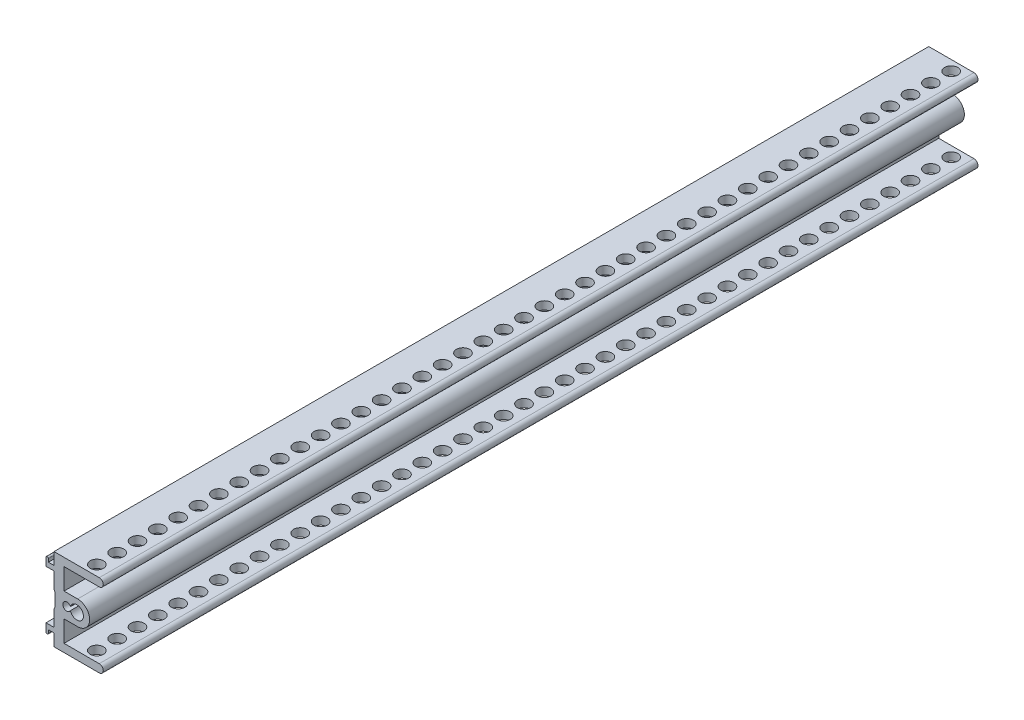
ISO-10303-21;
HEADER;
FILE_DESCRIPTION(('STEP AP214'),'2;1');
FILE_NAME('part.step','',(''),(''),'','','');
FILE_SCHEMA(('AUTOMOTIVE_DESIGN { 1 0 10303 214 1 1 1 1 }'));
ENDSEC;
DATA;
#1=APPLICATION_CONTEXT('core data for automotive mechanical design processes');
#2=APPLICATION_PROTOCOL_DEFINITION('international standard','automotive_design',2000,#1);
#3=PRODUCT_CONTEXT('',#1,'mechanical');
#4=PRODUCT('Part','Part','',(#3));
#5=PRODUCT_RELATED_PRODUCT_CATEGORY('part','',(#4));
#6=PRODUCT_DEFINITION_FORMATION('','',#4);
#7=PRODUCT_DEFINITION_CONTEXT('part definition',#1,'design');
#8=PRODUCT_DEFINITION('design','',#6,#7);
#9=PRODUCT_DEFINITION_SHAPE('','',#8);
#10=(LENGTH_UNIT() NAMED_UNIT(*) SI_UNIT(.MILLI.,.METRE.));
#11=(NAMED_UNIT(*) PLANE_ANGLE_UNIT() SI_UNIT($,.RADIAN.));
#12=(NAMED_UNIT(*) SI_UNIT($,.STERADIAN.) SOLID_ANGLE_UNIT());
#13=UNCERTAINTY_MEASURE_WITH_UNIT(LENGTH_MEASURE(1.E-05),#10,'distance_accuracy_value','');
#14=(GEOMETRIC_REPRESENTATION_CONTEXT(3) GLOBAL_UNCERTAINTY_ASSIGNED_CONTEXT((#13)) GLOBAL_UNIT_ASSIGNED_CONTEXT((#10,
#11,#12)) REPRESENTATION_CONTEXT('',''));
#15=CARTESIAN_POINT('',(0.,0.,0.));
#16=DIRECTION('',(0.,0.,1.));
#17=DIRECTION('',(1.,0.,0.));
#18=AXIS2_PLACEMENT_3D('',#15,#16,#17);
#19=CARTESIAN_POINT('',(-8.35000000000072,-8.07824532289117,109.22));
#20=DIRECTION('',(0.,0.,1.));
#21=DIRECTION('',(1.,0.,0.));
#22=AXIS2_PLACEMENT_3D('',#19,#20,#21);
#23=PLANE('',#22);
#24=DIRECTION('',(0.,-1.,0.));
#25=VECTOR('',#24,1.);
#26=CARTESIAN_POINT('',(-8.65000000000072,8.07824532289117,109.22));
#27=LINE('',#26,#25);
#28=CARTESIAN_POINT('',(-8.65000000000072,8.07824532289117,109.22));
#29=VERTEX_POINT('',#28);
#30=CARTESIAN_POINT('',(-8.65000000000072,6.1,109.22));
#31=VERTEX_POINT('',#30);
#32=EDGE_CURVE('E260',#29,#31,#27,.T.);
#33=ORIENTED_EDGE('',*,*,#32,.T.);
#34=DIRECTION('',(1.,0.,0.));
#35=VECTOR('',#34,1.);
#36=CARTESIAN_POINT('',(-6.65000000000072,6.1,109.22));
#37=LINE('',#36,#35);
#38=CARTESIAN_POINT('',(-6.65000000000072,6.1,109.22));
#39=VERTEX_POINT('',#38);
#40=EDGE_CURVE('E263',#31,#39,#37,.T.);
#41=ORIENTED_EDGE('',*,*,#40,.T.);
#42=DIRECTION('',(0.,-1.,0.));
#43=VECTOR('',#42,1.);
#44=CARTESIAN_POINT('',(-6.65000000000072,2.11156149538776,109.22));
#45=LINE('',#44,#43);
#46=CARTESIAN_POINT('',(-6.65000000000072,2.11156149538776,109.22));
#47=VERTEX_POINT('',#46);
#48=EDGE_CURVE('E266',#39,#47,#45,.T.);
#49=ORIENTED_EDGE('',*,*,#48,.T.);
#50=DIRECTION('',(0.447213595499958,-0.894427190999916,0.));
#51=VECTOR('',#50,1.);
#52=CARTESIAN_POINT('',(-6.65000000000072,2.11156149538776,109.22));
#53=LINE('',#52,#51);
#54=CARTESIAN_POINT('',(-6.35000000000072,1.51156149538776,109.22));
#55=VERTEX_POINT('',#54);
#56=EDGE_CURVE('E268',#47,#55,#53,.T.);
#57=ORIENTED_EDGE('',*,*,#56,.T.);
#58=DIRECTION('',(0.,-1.,0.));
#59=VECTOR('',#58,1.);
#60=CARTESIAN_POINT('',(-6.35000000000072,1.51156149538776,109.22));
#61=LINE('',#60,#59);
#62=CARTESIAN_POINT('',(-6.35000000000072,-1.48843850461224,109.22));
#63=VERTEX_POINT('',#62);
#64=EDGE_CURVE('E270',#55,#63,#61,.T.);
#65=ORIENTED_EDGE('',*,*,#64,.T.);
#66=DIRECTION('',(-0.447213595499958,-0.894427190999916,0.));
#67=VECTOR('',#66,1.);
#68=CARTESIAN_POINT('',(-6.65000000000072,-2.08843850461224,109.22));
#69=LINE('',#68,#67);
#70=CARTESIAN_POINT('',(-6.65000000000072,-2.08843850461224,109.22));
#71=VERTEX_POINT('',#70);
#72=EDGE_CURVE('E272',#63,#71,#69,.T.);
#73=ORIENTED_EDGE('',*,*,#72,.T.);
#74=DIRECTION('',(0.,-1.,0.));
#75=VECTOR('',#74,1.);
#76=CARTESIAN_POINT('',(-6.65000000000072,-6.1,109.22));
#77=LINE('',#76,#75);
#78=CARTESIAN_POINT('',(-6.65000000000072,-6.1,109.22));
#79=VERTEX_POINT('',#78);
#80=EDGE_CURVE('E274',#71,#79,#77,.T.);
#81=ORIENTED_EDGE('',*,*,#80,.T.);
#82=DIRECTION('',(-1.,0.,0.));
#83=VECTOR('',#82,1.);
#84=CARTESIAN_POINT('',(-6.65000000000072,-6.1,109.22));
#85=LINE('',#84,#83);
#86=CARTESIAN_POINT('',(-8.65000000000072,-6.1,109.22));
#87=VERTEX_POINT('',#86);
#88=EDGE_CURVE('E276',#79,#87,#85,.T.);
#89=ORIENTED_EDGE('',*,*,#88,.T.);
#90=DIRECTION('',(0.,-1.,0.));
#91=VECTOR('',#90,1.);
#92=CARTESIAN_POINT('',(-8.65000000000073,-8.07824532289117,109.22));
#93=LINE('',#92,#91);
#94=CARTESIAN_POINT('',(-8.65000000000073,-8.07824532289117,109.22));
#95=VERTEX_POINT('',#94);
#96=EDGE_CURVE('E278',#87,#95,#93,.T.);
#97=ORIENTED_EDGE('',*,*,#96,.T.);
#98=CARTESIAN_POINT('',(-8.35000000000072,-8.07824532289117,109.22));
#99=DIRECTION('',(0.,0.,1.));
#100=DIRECTION('',(1.,0.,0.));
#101=AXIS2_PLACEMENT_3D('',#98,#99,#100);
#102=CIRCLE('',#101,0.300000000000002);
#103=CARTESIAN_POINT('',(-8.05000000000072,-8.07824532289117,109.22));
#104=VERTEX_POINT('',#103);
#105=EDGE_CURVE('E280',#95,#104,#102,.T.);
#106=ORIENTED_EDGE('',*,*,#105,.T.);
#107=DIRECTION('',(0.,1.,0.));
#108=VECTOR('',#107,1.);
#109=CARTESIAN_POINT('',(-8.05000000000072,-8.07824532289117,109.22));
#110=LINE('',#109,#108);
#111=CARTESIAN_POINT('',(-8.05000000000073,-7.3,109.22));
#112=VERTEX_POINT('',#111);
#113=EDGE_CURVE('E282',#104,#112,#110,.T.);
#114=ORIENTED_EDGE('',*,*,#113,.T.);
#115=DIRECTION('',(1.,0.,0.));
#116=VECTOR('',#115,1.);
#117=CARTESIAN_POINT('',(-6.65000000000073,-7.3,109.22));
#118=LINE('',#117,#116);
#119=CARTESIAN_POINT('',(-6.65000000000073,-7.3,109.22));
#120=VERTEX_POINT('',#119);
#121=EDGE_CURVE('E284',#112,#120,#118,.T.);
#122=ORIENTED_EDGE('',*,*,#121,.T.);
#123=DIRECTION('',(0.,-1.,0.));
#124=VECTOR('',#123,1.);
#125=CARTESIAN_POINT('',(-6.65000000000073,-7.3,109.22));
#126=LINE('',#125,#124);
#127=CARTESIAN_POINT('',(-6.65000000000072,-10.3,109.22));
#128=VERTEX_POINT('',#127);
#129=EDGE_CURVE('E286',#120,#128,#126,.T.);
#130=ORIENTED_EDGE('',*,*,#129,.T.);
#131=DIRECTION('',(1.,0.,0.));
#132=VECTOR('',#131,1.);
#133=CARTESIAN_POINT('',(-6.65000000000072,-10.3,109.22));
#134=LINE('',#133,#132);
#135=CARTESIAN_POINT('',(4.64999999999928,-10.3,109.22));
#136=VERTEX_POINT('',#135);
#137=EDGE_CURVE('E288',#128,#136,#134,.T.);
#138=ORIENTED_EDGE('',*,*,#137,.T.);
#139=CARTESIAN_POINT('',(4.64999999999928,-9.3,109.22));
#140=DIRECTION('',(0.,0.,1.));
#141=DIRECTION('',(-1.,0.,0.));
#142=AXIS2_PLACEMENT_3D('',#139,#140,#141);
#143=CIRCLE('',#142,1.);
#144=CARTESIAN_POINT('',(4.64999999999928,-8.3,109.22));
#145=VERTEX_POINT('',#144);
#146=EDGE_CURVE('E290',#136,#145,#143,.T.);
#147=ORIENTED_EDGE('',*,*,#146,.T.);
#148=DIRECTION('',(-1.,0.,0.));
#149=VECTOR('',#148,1.);
#150=CARTESIAN_POINT('',(4.64999999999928,-8.3,109.22));
#151=LINE('',#150,#149);
#152=CARTESIAN_POINT('',(-4.15000000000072,-8.3,109.22));
#153=VERTEX_POINT('',#152);
#154=EDGE_CURVE('E292',#145,#153,#151,.T.);
#155=ORIENTED_EDGE('',*,*,#154,.T.);
#156=DIRECTION('',(0.,1.,0.));
#157=VECTOR('',#156,1.);
#158=CARTESIAN_POINT('',(-4.15000000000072,-8.3,109.22));
#159=LINE('',#158,#157);
#160=CARTESIAN_POINT('',(-4.15000000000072,-3.00000000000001,109.22));
#161=VERTEX_POINT('',#160);
#162=EDGE_CURVE('E294',#153,#161,#159,.T.);
#163=ORIENTED_EDGE('',*,*,#162,.T.);
#164=DIRECTION('',(1.,0.,0.));
#165=VECTOR('',#164,1.);
#166=CARTESIAN_POINT('',(-0.750000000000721,-3.00000000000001,109.22));
#167=LINE('',#166,#165);
#168=CARTESIAN_POINT('',(-0.750000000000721,-3.00000000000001,109.22));
#169=VERTEX_POINT('',#168);
#170=EDGE_CURVE('E296',#161,#169,#167,.T.);
#171=ORIENTED_EDGE('',*,*,#170,.T.);
#172=CARTESIAN_POINT('',(-0.750000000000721,0.,109.22));
#173=DIRECTION('',(0.,0.,1.));
#174=DIRECTION('',(-1.,0.,0.));
#175=AXIS2_PLACEMENT_3D('',#172,#173,#174);
#176=CIRCLE('',#175,3.);
#177=CARTESIAN_POINT('',(-0.75000000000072,3.,109.22));
#178=VERTEX_POINT('',#177);
#179=EDGE_CURVE('E298',#169,#178,#176,.T.);
#180=ORIENTED_EDGE('',*,*,#179,.T.);
#181=DIRECTION('',(-1.,0.,0.));
#182=VECTOR('',#181,1.);
#183=CARTESIAN_POINT('',(-4.15000000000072,3.,109.22));
#184=LINE('',#183,#182);
#185=CARTESIAN_POINT('',(-4.15000000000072,3.,109.22));
#186=VERTEX_POINT('',#185);
#187=EDGE_CURVE('E300',#178,#186,#184,.T.);
#188=ORIENTED_EDGE('',*,*,#187,.T.);
#189=DIRECTION('',(0.,1.,0.));
#190=VECTOR('',#189,1.);
#191=CARTESIAN_POINT('',(-4.15000000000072,8.3,109.22));
#192=LINE('',#191,#190);
#193=CARTESIAN_POINT('',(-4.15000000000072,8.3,109.22));
#194=VERTEX_POINT('',#193);
#195=EDGE_CURVE('E302',#186,#194,#192,.T.);
#196=ORIENTED_EDGE('',*,*,#195,.T.);
#197=DIRECTION('',(1.,0.,0.));
#198=VECTOR('',#197,1.);
#199=CARTESIAN_POINT('',(4.64999999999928,8.3,109.22));
#200=LINE('',#199,#198);
#201=CARTESIAN_POINT('',(4.64999999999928,8.3,109.22));
#202=VERTEX_POINT('',#201);
#203=EDGE_CURVE('E304',#194,#202,#200,.T.);
#204=ORIENTED_EDGE('',*,*,#203,.T.);
#205=CARTESIAN_POINT('',(4.64999999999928,9.3,109.22));
#206=DIRECTION('',(0.,0.,1.));
#207=DIRECTION('',(1.,0.,0.));
#208=AXIS2_PLACEMENT_3D('',#205,#206,#207);
#209=CIRCLE('',#208,1.);
#210=CARTESIAN_POINT('',(4.64999999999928,10.3,109.22));
#211=VERTEX_POINT('',#210);
#212=EDGE_CURVE('E306',#202,#211,#209,.T.);
#213=ORIENTED_EDGE('',*,*,#212,.T.);
#214=DIRECTION('',(-1.,0.,0.));
#215=VECTOR('',#214,1.);
#216=CARTESIAN_POINT('',(-6.65000000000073,10.3,109.22));
#217=LINE('',#216,#215);
#218=CARTESIAN_POINT('',(-6.65000000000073,10.3,109.22));
#219=VERTEX_POINT('',#218);
#220=EDGE_CURVE('E308',#211,#219,#217,.T.);
#221=ORIENTED_EDGE('',*,*,#220,.T.);
#222=DIRECTION('',(0.,-1.,0.));
#223=VECTOR('',#222,1.);
#224=CARTESIAN_POINT('',(-6.65000000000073,7.3,109.22));
#225=LINE('',#224,#223);
#226=CARTESIAN_POINT('',(-6.65000000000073,7.3,109.22));
#227=VERTEX_POINT('',#226);
#228=EDGE_CURVE('E310',#219,#227,#225,.T.);
#229=ORIENTED_EDGE('',*,*,#228,.T.);
#230=DIRECTION('',(-1.,0.,0.));
#231=VECTOR('',#230,1.);
#232=CARTESIAN_POINT('',(-6.65000000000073,7.3,109.22));
#233=LINE('',#232,#231);
#234=CARTESIAN_POINT('',(-8.05000000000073,7.3,109.22));
#235=VERTEX_POINT('',#234);
#236=EDGE_CURVE('E312',#227,#235,#233,.T.);
#237=ORIENTED_EDGE('',*,*,#236,.T.);
#238=DIRECTION('',(0.,1.,0.));
#239=VECTOR('',#238,1.);
#240=CARTESIAN_POINT('',(-8.05000000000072,8.07824532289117,109.22));
#241=LINE('',#240,#239);
#242=CARTESIAN_POINT('',(-8.05000000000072,8.07824532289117,109.22));
#243=VERTEX_POINT('',#242);
#244=EDGE_CURVE('E314',#235,#243,#241,.T.);
#245=ORIENTED_EDGE('',*,*,#244,.T.);
#246=CARTESIAN_POINT('',(-8.35000000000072,8.07824532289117,109.22));
#247=DIRECTION('',(0.,0.,1.));
#248=DIRECTION('',(-1.,0.,0.));
#249=AXIS2_PLACEMENT_3D('',#246,#247,#248);
#250=CIRCLE('',#249,0.3);
#251=EDGE_CURVE('E316',#243,#29,#250,.T.);
#252=ORIENTED_EDGE('',*,*,#251,.T.);
#253=EDGE_LOOP('',(#33,#41,#49,#57,#65,#73,#81,#89,#97,#106,#114,#122,#130,#138,#147,#155,#163,
#171,#180,#188,#196,#204,#213,#221,#229,#237,#245,#252));
#254=FACE_BOUND('',#253,.T.);
#255=CARTESIAN_POINT('',(-0.950000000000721,0.,109.22));
#256=DIRECTION('',(0.,0.,1.));
#257=DIRECTION('',(1.,0.,0.));
#258=AXIS2_PLACEMENT_3D('',#255,#256,#257);
#259=CIRCLE('',#258,1.65);
#260=CARTESIAN_POINT('',(-2.54450000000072,-0.424346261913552,109.22));
#261=VERTEX_POINT('',#260);
#262=CARTESIAN_POINT('',(-2.54450000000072,0.424346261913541,109.22));
#263=VERTEX_POINT('',#262);
#264=EDGE_CURVE('E239',#261,#263,#259,.T.);
#265=ORIENTED_EDGE('',*,*,#264,.F.);
#266=CARTESIAN_POINT('',(-3.45000000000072,0.,109.22));
#267=DIRECTION('',(0.,0.,1.));
#268=DIRECTION('',(1.,0.,0.));
#269=AXIS2_PLACEMENT_3D('',#266,#267,#268);
#270=CIRCLE('',#269,1.);
#271=EDGE_CURVE('E245',#263,#261,#270,.T.);
#272=ORIENTED_EDGE('',*,*,#271,.F.);
#273=EDGE_LOOP('',(#265,#272));
#274=FACE_BOUND('',#273,.T.);
#275=ADVANCED_FACE('F41',(#254,#274),#23,.T.);
#276=CARTESIAN_POINT('',(-8.35000000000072,-8.07824532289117,-109.22));
#277=DIRECTION('',(0.,0.,1.));
#278=DIRECTION('',(1.,0.,0.));
#279=AXIS2_PLACEMENT_3D('',#276,#277,#278);
#280=PLANE('',#279);
#281=DIRECTION('',(0.,-1.,0.));
#282=VECTOR('',#281,1.);
#283=CARTESIAN_POINT('',(-8.65000000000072,8.07824532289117,-109.22));
#284=LINE('',#283,#282);
#285=CARTESIAN_POINT('',(-8.65000000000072,8.07824532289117,-109.22));
#286=VERTEX_POINT('',#285);
#287=CARTESIAN_POINT('',(-8.65000000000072,6.1,-109.22));
#288=VERTEX_POINT('',#287);
#289=EDGE_CURVE('E259',#286,#288,#284,.T.);
#290=ORIENTED_EDGE('',*,*,#289,.F.);
#291=CARTESIAN_POINT('',(-8.35000000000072,8.07824532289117,-109.22));
#292=DIRECTION('',(0.,0.,1.));
#293=DIRECTION('',(-1.,0.,0.));
#294=AXIS2_PLACEMENT_3D('',#291,#292,#293);
#295=CIRCLE('',#294,0.3);
#296=CARTESIAN_POINT('',(-8.05000000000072,8.07824532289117,-109.22));
#297=VERTEX_POINT('',#296);
#298=EDGE_CURVE('E264',#297,#286,#295,.T.);
#299=ORIENTED_EDGE('',*,*,#298,.F.);
#300=DIRECTION('',(0.,1.,0.));
#301=VECTOR('',#300,1.);
#302=CARTESIAN_POINT('',(-8.05000000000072,8.07824532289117,-109.22));
#303=LINE('',#302,#301);
#304=CARTESIAN_POINT('',(-8.05000000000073,7.3,-109.22));
#305=VERTEX_POINT('',#304);
#306=EDGE_CURVE('E371',#305,#297,#303,.T.);
#307=ORIENTED_EDGE('',*,*,#306,.F.);
#308=DIRECTION('',(-1.,0.,0.));
#309=VECTOR('',#308,1.);
#310=CARTESIAN_POINT('',(-6.65000000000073,7.3,-109.22));
#311=LINE('',#310,#309);
#312=CARTESIAN_POINT('',(-6.65000000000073,7.3,-109.22));
#313=VERTEX_POINT('',#312);
#314=EDGE_CURVE('E369',#313,#305,#311,.T.);
#315=ORIENTED_EDGE('',*,*,#314,.F.);
#316=DIRECTION('',(0.,-1.,0.));
#317=VECTOR('',#316,1.);
#318=CARTESIAN_POINT('',(-6.65000000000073,7.3,-109.22));
#319=LINE('',#318,#317);
#320=CARTESIAN_POINT('',(-6.65000000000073,10.3,-109.22));
#321=VERTEX_POINT('',#320);
#322=EDGE_CURVE('E367',#321,#313,#319,.T.);
#323=ORIENTED_EDGE('',*,*,#322,.F.);
#324=DIRECTION('',(-1.,0.,0.));
#325=VECTOR('',#324,1.);
#326=CARTESIAN_POINT('',(-6.65000000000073,10.3,-109.22));
#327=LINE('',#326,#325);
#328=CARTESIAN_POINT('',(4.64999999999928,10.3,-109.22));
#329=VERTEX_POINT('',#328);
#330=EDGE_CURVE('E365',#329,#321,#327,.T.);
#331=ORIENTED_EDGE('',*,*,#330,.F.);
#332=CARTESIAN_POINT('',(4.64999999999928,9.3,-109.22));
#333=DIRECTION('',(0.,0.,1.));
#334=DIRECTION('',(1.,0.,0.));
#335=AXIS2_PLACEMENT_3D('',#332,#333,#334);
#336=CIRCLE('',#335,1.);
#337=CARTESIAN_POINT('',(4.64999999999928,8.3,-109.22));
#338=VERTEX_POINT('',#337);
#339=EDGE_CURVE('E363',#338,#329,#336,.T.);
#340=ORIENTED_EDGE('',*,*,#339,.F.);
#341=DIRECTION('',(1.,0.,0.));
#342=VECTOR('',#341,1.);
#343=CARTESIAN_POINT('',(4.64999999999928,8.3,-109.22));
#344=LINE('',#343,#342);
#345=CARTESIAN_POINT('',(-4.15000000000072,8.3,-109.22));
#346=VERTEX_POINT('',#345);
#347=EDGE_CURVE('E361',#346,#338,#344,.T.);
#348=ORIENTED_EDGE('',*,*,#347,.F.);
#349=DIRECTION('',(0.,1.,0.));
#350=VECTOR('',#349,1.);
#351=CARTESIAN_POINT('',(-4.15000000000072,8.3,-109.22));
#352=LINE('',#351,#350);
#353=CARTESIAN_POINT('',(-4.15000000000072,3.,-109.22));
#354=VERTEX_POINT('',#353);
#355=EDGE_CURVE('E359',#354,#346,#352,.T.);
#356=ORIENTED_EDGE('',*,*,#355,.F.);
#357=DIRECTION('',(-1.,0.,0.));
#358=VECTOR('',#357,1.);
#359=CARTESIAN_POINT('',(-4.15000000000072,3.,-109.22));
#360=LINE('',#359,#358);
#361=CARTESIAN_POINT('',(-0.75000000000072,3.,-109.22));
#362=VERTEX_POINT('',#361);
#363=EDGE_CURVE('E357',#362,#354,#360,.T.);
#364=ORIENTED_EDGE('',*,*,#363,.F.);
#365=CARTESIAN_POINT('',(-0.750000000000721,0.,-109.22));
#366=DIRECTION('',(0.,0.,1.));
#367=DIRECTION('',(-1.,0.,0.));
#368=AXIS2_PLACEMENT_3D('',#365,#366,#367);
#369=CIRCLE('',#368,3.);
#370=CARTESIAN_POINT('',(-0.750000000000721,-3.00000000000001,-109.22));
#371=VERTEX_POINT('',#370);
#372=EDGE_CURVE('E355',#371,#362,#369,.T.);
#373=ORIENTED_EDGE('',*,*,#372,.F.);
#374=DIRECTION('',(1.,0.,0.));
#375=VECTOR('',#374,1.);
#376=CARTESIAN_POINT('',(-0.750000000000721,-3.00000000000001,-109.22));
#377=LINE('',#376,#375);
#378=CARTESIAN_POINT('',(-4.15000000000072,-3.00000000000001,-109.22));
#379=VERTEX_POINT('',#378);
#380=EDGE_CURVE('E353',#379,#371,#377,.T.);
#381=ORIENTED_EDGE('',*,*,#380,.F.);
#382=DIRECTION('',(0.,1.,0.));
#383=VECTOR('',#382,1.);
#384=CARTESIAN_POINT('',(-4.15000000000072,-8.3,-109.22));
#385=LINE('',#384,#383);
#386=CARTESIAN_POINT('',(-4.15000000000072,-8.3,-109.22));
#387=VERTEX_POINT('',#386);
#388=EDGE_CURVE('E351',#387,#379,#385,.T.);
#389=ORIENTED_EDGE('',*,*,#388,.F.);
#390=DIRECTION('',(-1.,0.,0.));
#391=VECTOR('',#390,1.);
#392=CARTESIAN_POINT('',(4.64999999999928,-8.3,-109.22));
#393=LINE('',#392,#391);
#394=CARTESIAN_POINT('',(4.64999999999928,-8.3,-109.22));
#395=VERTEX_POINT('',#394);
#396=EDGE_CURVE('E349',#395,#387,#393,.T.);
#397=ORIENTED_EDGE('',*,*,#396,.F.);
#398=CARTESIAN_POINT('',(4.64999999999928,-9.3,-109.22));
#399=DIRECTION('',(0.,0.,1.));
#400=DIRECTION('',(-1.,0.,0.));
#401=AXIS2_PLACEMENT_3D('',#398,#399,#400);
#402=CIRCLE('',#401,1.);
#403=CARTESIAN_POINT('',(4.64999999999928,-10.3,-109.22));
#404=VERTEX_POINT('',#403);
#405=EDGE_CURVE('E347',#404,#395,#402,.T.);
#406=ORIENTED_EDGE('',*,*,#405,.F.);
#407=DIRECTION('',(1.,0.,0.));
#408=VECTOR('',#407,1.);
#409=CARTESIAN_POINT('',(-6.65000000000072,-10.3,-109.22));
#410=LINE('',#409,#408);
#411=CARTESIAN_POINT('',(-6.65000000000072,-10.3,-109.22));
#412=VERTEX_POINT('',#411);
#413=EDGE_CURVE('E345',#412,#404,#410,.T.);
#414=ORIENTED_EDGE('',*,*,#413,.F.);
#415=DIRECTION('',(0.,-1.,0.));
#416=VECTOR('',#415,1.);
#417=CARTESIAN_POINT('',(-6.65000000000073,-7.3,-109.22));
#418=LINE('',#417,#416);
#419=CARTESIAN_POINT('',(-6.65000000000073,-7.3,-109.22));
#420=VERTEX_POINT('',#419);
#421=EDGE_CURVE('E343',#420,#412,#418,.T.);
#422=ORIENTED_EDGE('',*,*,#421,.F.);
#423=DIRECTION('',(1.,0.,0.));
#424=VECTOR('',#423,1.);
#425=CARTESIAN_POINT('',(-6.65000000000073,-7.3,-109.22));
#426=LINE('',#425,#424);
#427=CARTESIAN_POINT('',(-8.05000000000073,-7.3,-109.22));
#428=VERTEX_POINT('',#427);
#429=EDGE_CURVE('E341',#428,#420,#426,.T.);
#430=ORIENTED_EDGE('',*,*,#429,.F.);
#431=DIRECTION('',(0.,1.,0.));
#432=VECTOR('',#431,1.);
#433=CARTESIAN_POINT('',(-8.05000000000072,-8.07824532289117,-109.22));
#434=LINE('',#433,#432);
#435=CARTESIAN_POINT('',(-8.05000000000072,-8.07824532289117,-109.22));
#436=VERTEX_POINT('',#435);
#437=EDGE_CURVE('E339',#436,#428,#434,.T.);
#438=ORIENTED_EDGE('',*,*,#437,.F.);
#439=CARTESIAN_POINT('',(-8.35000000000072,-8.07824532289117,-109.22));
#440=DIRECTION('',(0.,0.,1.));
#441=DIRECTION('',(1.,0.,0.));
#442=AXIS2_PLACEMENT_3D('',#439,#440,#441);
#443=CIRCLE('',#442,0.300000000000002);
#444=CARTESIAN_POINT('',(-8.65000000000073,-8.07824532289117,-109.22));
#445=VERTEX_POINT('',#444);
#446=EDGE_CURVE('E337',#445,#436,#443,.T.);
#447=ORIENTED_EDGE('',*,*,#446,.F.);
#448=DIRECTION('',(0.,-1.,0.));
#449=VECTOR('',#448,1.);
#450=CARTESIAN_POINT('',(-8.65000000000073,-8.07824532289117,-109.22));
#451=LINE('',#450,#449);
#452=CARTESIAN_POINT('',(-8.65000000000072,-6.1,-109.22));
#453=VERTEX_POINT('',#452);
#454=EDGE_CURVE('E335',#453,#445,#451,.T.);
#455=ORIENTED_EDGE('',*,*,#454,.F.);
#456=DIRECTION('',(-1.,0.,0.));
#457=VECTOR('',#456,1.);
#458=CARTESIAN_POINT('',(-6.65000000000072,-6.1,-109.22));
#459=LINE('',#458,#457);
#460=CARTESIAN_POINT('',(-6.65000000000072,-6.1,-109.22));
#461=VERTEX_POINT('',#460);
#462=EDGE_CURVE('E333',#461,#453,#459,.T.);
#463=ORIENTED_EDGE('',*,*,#462,.F.);
#464=DIRECTION('',(0.,-1.,0.));
#465=VECTOR('',#464,1.);
#466=CARTESIAN_POINT('',(-6.65000000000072,-6.1,-109.22));
#467=LINE('',#466,#465);
#468=CARTESIAN_POINT('',(-6.65000000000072,-2.08843850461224,-109.22));
#469=VERTEX_POINT('',#468);
#470=EDGE_CURVE('E331',#469,#461,#467,.T.);
#471=ORIENTED_EDGE('',*,*,#470,.F.);
#472=DIRECTION('',(-0.447213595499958,-0.894427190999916,0.));
#473=VECTOR('',#472,1.);
#474=CARTESIAN_POINT('',(-6.65000000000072,-2.08843850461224,-109.22));
#475=LINE('',#474,#473);
#476=CARTESIAN_POINT('',(-6.35000000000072,-1.48843850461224,-109.22));
#477=VERTEX_POINT('',#476);
#478=EDGE_CURVE('E329',#477,#469,#475,.T.);
#479=ORIENTED_EDGE('',*,*,#478,.F.);
#480=DIRECTION('',(0.,-1.,0.));
#481=VECTOR('',#480,1.);
#482=CARTESIAN_POINT('',(-6.35000000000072,1.51156149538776,-109.22));
#483=LINE('',#482,#481);
#484=CARTESIAN_POINT('',(-6.35000000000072,1.51156149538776,-109.22));
#485=VERTEX_POINT('',#484);
#486=EDGE_CURVE('E327',#485,#477,#483,.T.);
#487=ORIENTED_EDGE('',*,*,#486,.F.);
#488=DIRECTION('',(0.447213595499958,-0.894427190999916,0.));
#489=VECTOR('',#488,1.);
#490=CARTESIAN_POINT('',(-6.65000000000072,2.11156149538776,-109.22));
#491=LINE('',#490,#489);
#492=CARTESIAN_POINT('',(-6.65000000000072,2.11156149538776,-109.22));
#493=VERTEX_POINT('',#492);
#494=EDGE_CURVE('E325',#493,#485,#491,.T.);
#495=ORIENTED_EDGE('',*,*,#494,.F.);
#496=DIRECTION('',(0.,-1.,0.));
#497=VECTOR('',#496,1.);
#498=CARTESIAN_POINT('',(-6.65000000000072,2.11156149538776,-109.22));
#499=LINE('',#498,#497);
#500=CARTESIAN_POINT('',(-6.65000000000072,6.1,-109.22));
#501=VERTEX_POINT('',#500);
#502=EDGE_CURVE('E323',#501,#493,#499,.T.);
#503=ORIENTED_EDGE('',*,*,#502,.F.);
#504=DIRECTION('',(1.,0.,0.));
#505=VECTOR('',#504,1.);
#506=CARTESIAN_POINT('',(-6.65000000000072,6.1,-109.22));
#507=LINE('',#506,#505);
#508=EDGE_CURVE('E321',#288,#501,#507,.T.);
#509=ORIENTED_EDGE('',*,*,#508,.F.);
#510=EDGE_LOOP('',(#290,#299,#307,#315,#323,#331,#340,#348,#356,#364,#373,#381,#389,#397,#406,
#414,#422,#430,#438,#447,#455,#463,#471,#479,#487,#495,#503,#509));
#511=FACE_BOUND('',#510,.T.);
#512=CARTESIAN_POINT('',(-3.45000000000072,0.,-109.22));
#513=DIRECTION('',(0.,0.,1.));
#514=DIRECTION('',(1.,0.,0.));
#515=AXIS2_PLACEMENT_3D('',#512,#513,#514);
#516=CIRCLE('',#515,1.);
#517=CARTESIAN_POINT('',(-2.54450000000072,0.424346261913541,-109.22));
#518=VERTEX_POINT('',#517);
#519=CARTESIAN_POINT('',(-2.54450000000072,-0.424346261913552,-109.22));
#520=VERTEX_POINT('',#519);
#521=EDGE_CURVE('E65',#518,#520,#516,.T.);
#522=ORIENTED_EDGE('',*,*,#521,.T.);
#523=CARTESIAN_POINT('',(-0.950000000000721,0.,-109.22));
#524=DIRECTION('',(0.,0.,1.));
#525=DIRECTION('',(1.,0.,0.));
#526=AXIS2_PLACEMENT_3D('',#523,#524,#525);
#527=CIRCLE('',#526,1.65);
#528=EDGE_CURVE('E249',#520,#518,#527,.T.);
#529=ORIENTED_EDGE('',*,*,#528,.T.);
#530=EDGE_LOOP('',(#522,#529));
#531=FACE_BOUND('',#530,.T.);
#532=ADVANCED_FACE('F733',(#511,#531),#280,.F.);
#533=CARTESIAN_POINT('',(-8.65000000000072,8.07824532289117,109.22));
#534=DIRECTION('',(1.,0.,0.));
#535=DIRECTION('',(0.,0.,-1.));
#536=AXIS2_PLACEMENT_3D('',#533,#534,#535);
#537=PLANE('',#536);
#538=ORIENTED_EDGE('',*,*,#289,.T.);
#539=DIRECTION('',(0.,0.,-1.));
#540=VECTOR('',#539,1.);
#541=CARTESIAN_POINT('',(-8.65000000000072,6.1,109.22));
#542=LINE('',#541,#540);
#543=EDGE_CURVE('E11',#31,#288,#542,.T.);
#544=ORIENTED_EDGE('',*,*,#543,.F.);
#545=ORIENTED_EDGE('',*,*,#32,.F.);
#546=DIRECTION('',(0.,0.,-1.));
#547=VECTOR('',#546,1.);
#548=CARTESIAN_POINT('',(-8.65000000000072,8.07824532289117,109.22));
#549=LINE('',#548,#547);
#550=EDGE_CURVE('E318',#29,#286,#549,.T.);
#551=ORIENTED_EDGE('',*,*,#550,.T.);
#552=EDGE_LOOP('',(#538,#544,#545,#551));
#553=FACE_BOUND('',#552,.T.);
#554=ADVANCED_FACE('F43',(#553),#537,.F.);
#555=CARTESIAN_POINT('',(-6.65000000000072,6.1,109.22));
#556=DIRECTION('',(0.,1.,0.));
#557=DIRECTION('',(0.,0.,1.));
#558=AXIS2_PLACEMENT_3D('',#555,#556,#557);
#559=PLANE('',#558);
#560=ORIENTED_EDGE('',*,*,#508,.T.);
#561=DIRECTION('',(0.,0.,-1.));
#562=VECTOR('',#561,1.);
#563=CARTESIAN_POINT('',(-6.65000000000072,6.1,109.22));
#564=LINE('',#563,#562);
#565=EDGE_CURVE('E50',#39,#501,#564,.T.);
#566=ORIENTED_EDGE('',*,*,#565,.F.);
#567=ORIENTED_EDGE('',*,*,#40,.F.);
#568=ORIENTED_EDGE('',*,*,#543,.T.);
#569=EDGE_LOOP('',(#560,#566,#567,#568));
#570=FACE_BOUND('',#569,.T.);
#571=ADVANCED_FACE('F802',(#570),#559,.F.);
#572=CARTESIAN_POINT('',(-6.65000000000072,2.11156149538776,109.22));
#573=DIRECTION('',(1.,0.,0.));
#574=DIRECTION('',(0.,0.,-1.));
#575=AXIS2_PLACEMENT_3D('',#572,#573,#574);
#576=PLANE('',#575);
#577=ORIENTED_EDGE('',*,*,#502,.T.);
#578=DIRECTION('',(0.,0.,-1.));
#579=VECTOR('',#578,1.);
#580=CARTESIAN_POINT('',(-6.65000000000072,2.11156149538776,109.22));
#581=LINE('',#580,#579);
#582=EDGE_CURVE('E448',#47,#493,#581,.T.);
#583=ORIENTED_EDGE('',*,*,#582,.F.);
#584=ORIENTED_EDGE('',*,*,#48,.F.);
#585=ORIENTED_EDGE('',*,*,#565,.T.);
#586=EDGE_LOOP('',(#577,#583,#584,#585));
#587=FACE_BOUND('',#586,.T.);
#588=ADVANCED_FACE('F798',(#587),#576,.F.);
#589=CARTESIAN_POINT('',(-6.65000000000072,2.11156149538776,109.22));
#590=DIRECTION('',(0.894427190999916,0.447213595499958,0.));
#591=DIRECTION('',(-0.447213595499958,0.894427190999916,0.));
#592=AXIS2_PLACEMENT_3D('',#589,#590,#591);
#593=PLANE('',#592);
#594=ORIENTED_EDGE('',*,*,#494,.T.);
#595=DIRECTION('',(0.,0.,-1.));
#596=VECTOR('',#595,1.);
#597=CARTESIAN_POINT('',(-6.35000000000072,1.51156149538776,109.22));
#598=LINE('',#597,#596);
#599=EDGE_CURVE('E445',#55,#485,#598,.T.);
#600=ORIENTED_EDGE('',*,*,#599,.F.);
#601=ORIENTED_EDGE('',*,*,#56,.F.);
#602=ORIENTED_EDGE('',*,*,#582,.T.);
#603=EDGE_LOOP('',(#594,#600,#601,#602));
#604=FACE_BOUND('',#603,.T.);
#605=ADVANCED_FACE('F794',(#604),#593,.F.);
#606=CARTESIAN_POINT('',(-6.35000000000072,1.51156149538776,109.22));
#607=DIRECTION('',(1.,0.,0.));
#608=DIRECTION('',(0.,0.,-1.));
#609=AXIS2_PLACEMENT_3D('',#606,#607,#608);
#610=PLANE('',#609);
#611=ORIENTED_EDGE('',*,*,#486,.T.);
#612=DIRECTION('',(0.,0.,-1.));
#613=VECTOR('',#612,1.);
#614=CARTESIAN_POINT('',(-6.35000000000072,-1.48843850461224,109.22));
#615=LINE('',#614,#613);
#616=EDGE_CURVE('E442',#63,#477,#615,.T.);
#617=ORIENTED_EDGE('',*,*,#616,.F.);
#618=ORIENTED_EDGE('',*,*,#64,.F.);
#619=ORIENTED_EDGE('',*,*,#599,.T.);
#620=EDGE_LOOP('',(#611,#617,#618,#619));
#621=FACE_BOUND('',#620,.T.);
#622=ADVANCED_FACE('F790',(#621),#610,.F.);
#623=CARTESIAN_POINT('',(-6.65000000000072,-2.08843850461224,109.22));
#624=DIRECTION('',(0.894427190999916,-0.447213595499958,0.));
#625=DIRECTION('',(0.447213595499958,0.894427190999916,0.));
#626=AXIS2_PLACEMENT_3D('',#623,#624,#625);
#627=PLANE('',#626);
#628=ORIENTED_EDGE('',*,*,#478,.T.);
#629=DIRECTION('',(0.,0.,-1.));
#630=VECTOR('',#629,1.);
#631=CARTESIAN_POINT('',(-6.65000000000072,-2.08843850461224,109.22));
#632=LINE('',#631,#630);
#633=EDGE_CURVE('E439',#71,#469,#632,.T.);
#634=ORIENTED_EDGE('',*,*,#633,.F.);
#635=ORIENTED_EDGE('',*,*,#72,.F.);
#636=ORIENTED_EDGE('',*,*,#616,.T.);
#637=EDGE_LOOP('',(#628,#634,#635,#636));
#638=FACE_BOUND('',#637,.T.);
#639=ADVANCED_FACE('F785',(#638),#627,.F.);
#640=CARTESIAN_POINT('',(-6.65000000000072,-6.1,109.22));
#641=DIRECTION('',(1.,0.,0.));
#642=DIRECTION('',(0.,0.,-1.));
#643=AXIS2_PLACEMENT_3D('',#640,#641,#642);
#644=PLANE('',#643);
#645=ORIENTED_EDGE('',*,*,#470,.T.);
#646=DIRECTION('',(0.,0.,-1.));
#647=VECTOR('',#646,1.);
#648=CARTESIAN_POINT('',(-6.65000000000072,-6.1,109.22));
#649=LINE('',#648,#647);
#650=EDGE_CURVE('E436',#79,#461,#649,.T.);
#651=ORIENTED_EDGE('',*,*,#650,.F.);
#652=ORIENTED_EDGE('',*,*,#80,.F.);
#653=ORIENTED_EDGE('',*,*,#633,.T.);
#654=EDGE_LOOP('',(#645,#651,#652,#653));
#655=FACE_BOUND('',#654,.T.);
#656=ADVANCED_FACE('F779',(#655),#644,.F.);
#657=CARTESIAN_POINT('',(-6.65000000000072,-6.1,109.22));
#658=DIRECTION('',(0.,-1.,0.));
#659=DIRECTION('',(0.,0.,-1.));
#660=AXIS2_PLACEMENT_3D('',#657,#658,#659);
#661=PLANE('',#660);
#662=ORIENTED_EDGE('',*,*,#462,.T.);
#663=DIRECTION('',(0.,0.,-1.));
#664=VECTOR('',#663,1.);
#665=CARTESIAN_POINT('',(-8.65000000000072,-6.1,109.22));
#666=LINE('',#665,#664);
#667=EDGE_CURVE('E433',#87,#453,#666,.T.);
#668=ORIENTED_EDGE('',*,*,#667,.F.);
#669=ORIENTED_EDGE('',*,*,#88,.F.);
#670=ORIENTED_EDGE('',*,*,#650,.T.);
#671=EDGE_LOOP('',(#662,#668,#669,#670));
#672=FACE_BOUND('',#671,.T.);
#673=ADVANCED_FACE('F775',(#672),#661,.F.);
#674=CARTESIAN_POINT('',(-8.65000000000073,-8.07824532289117,109.22));
#675=DIRECTION('',(1.,0.,0.));
#676=DIRECTION('',(0.,1.,0.));
#677=AXIS2_PLACEMENT_3D('',#674,#675,#676);
#678=PLANE('',#677);
#679=ORIENTED_EDGE('',*,*,#454,.T.);
#680=DIRECTION('',(0.,0.,-1.));
#681=VECTOR('',#680,1.);
#682=CARTESIAN_POINT('',(-8.65000000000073,-8.07824532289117,109.22));
#683=LINE('',#682,#681);
#684=EDGE_CURVE('E430',#95,#445,#683,.T.);
#685=ORIENTED_EDGE('',*,*,#684,.F.);
#686=ORIENTED_EDGE('',*,*,#96,.F.);
#687=ORIENTED_EDGE('',*,*,#667,.T.);
#688=EDGE_LOOP('',(#679,#685,#686,#687));
#689=FACE_BOUND('',#688,.T.);
#690=ADVANCED_FACE('F770',(#689),#678,.F.);
#691=CARTESIAN_POINT('',(-8.35000000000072,-8.07824532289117,109.22));
#692=DIRECTION('',(0.,0.,-1.));
#693=DIRECTION('',(-1.,0.,0.));
#694=AXIS2_PLACEMENT_3D('',#691,#692,#693);
#695=CYLINDRICAL_SURFACE('',#694,0.300000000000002);
#696=ORIENTED_EDGE('',*,*,#446,.T.);
#697=DIRECTION('',(0.,0.,-1.));
#698=VECTOR('',#697,1.);
#699=CARTESIAN_POINT('',(-8.05000000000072,-8.07824532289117,109.22));
#700=LINE('',#699,#698);
#701=EDGE_CURVE('E427',#104,#436,#700,.T.);
#702=ORIENTED_EDGE('',*,*,#701,.F.);
#703=ORIENTED_EDGE('',*,*,#105,.F.);
#704=ORIENTED_EDGE('',*,*,#684,.T.);
#705=EDGE_LOOP('',(#696,#702,#703,#704));
#706=FACE_BOUND('',#705,.T.);
#707=ADVANCED_FACE('F764',(#706),#695,.T.);
#708=CARTESIAN_POINT('',(-8.05000000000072,-8.07824532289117,109.22));
#709=DIRECTION('',(-1.,0.,0.));
#710=DIRECTION('',(0.,-1.,0.));
#711=AXIS2_PLACEMENT_3D('',#708,#709,#710);
#712=PLANE('',#711);
#713=ORIENTED_EDGE('',*,*,#437,.T.);
#714=DIRECTION('',(0.,0.,-1.));
#715=VECTOR('',#714,1.);
#716=CARTESIAN_POINT('',(-8.05000000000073,-7.3,109.22));
#717=LINE('',#716,#715);
#718=EDGE_CURVE('E424',#112,#428,#717,.T.);
#719=ORIENTED_EDGE('',*,*,#718,.F.);
#720=ORIENTED_EDGE('',*,*,#113,.F.);
#721=ORIENTED_EDGE('',*,*,#701,.T.);
#722=EDGE_LOOP('',(#713,#719,#720,#721));
#723=FACE_BOUND('',#722,.T.);
#724=ADVANCED_FACE('F760',(#723),#712,.F.);
#725=CARTESIAN_POINT('',(-6.65000000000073,-7.3,109.22));
#726=DIRECTION('',(0.,1.,0.));
#727=DIRECTION('',(0.,0.,1.));
#728=AXIS2_PLACEMENT_3D('',#725,#726,#727);
#729=PLANE('',#728);
#730=ORIENTED_EDGE('',*,*,#429,.T.);
#731=DIRECTION('',(0.,0.,-1.));
#732=VECTOR('',#731,1.);
#733=CARTESIAN_POINT('',(-6.65000000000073,-7.3,109.22));
#734=LINE('',#733,#732);
#735=EDGE_CURVE('E421',#120,#420,#734,.T.);
#736=ORIENTED_EDGE('',*,*,#735,.F.);
#737=ORIENTED_EDGE('',*,*,#121,.F.);
#738=ORIENTED_EDGE('',*,*,#718,.T.);
#739=EDGE_LOOP('',(#730,#736,#737,#738));
#740=FACE_BOUND('',#739,.T.);
#741=ADVANCED_FACE('F756',(#740),#729,.F.);
#742=CARTESIAN_POINT('',(-6.65000000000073,-7.3,109.22));
#743=DIRECTION('',(1.,0.,0.));
#744=DIRECTION('',(0.,1.,0.));
#745=AXIS2_PLACEMENT_3D('',#742,#743,#744);
#746=PLANE('',#745);
#747=ORIENTED_EDGE('',*,*,#421,.T.);
#748=DIRECTION('',(0.,0.,-1.));
#749=VECTOR('',#748,1.);
#750=CARTESIAN_POINT('',(-6.65000000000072,-10.3,109.22));
#751=LINE('',#750,#749);
#752=EDGE_CURVE('E418',#128,#412,#751,.T.);
#753=ORIENTED_EDGE('',*,*,#752,.F.);
#754=ORIENTED_EDGE('',*,*,#129,.F.);
#755=ORIENTED_EDGE('',*,*,#735,.T.);
#756=EDGE_LOOP('',(#747,#753,#754,#755));
#757=FACE_BOUND('',#756,.T.);
#758=ADVANCED_FACE('F715',(#757),#746,.F.);
#759=CARTESIAN_POINT('',(-6.65000000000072,-10.3,109.22));
#760=DIRECTION('',(0.,1.,0.));
#761=DIRECTION('',(-1.,0.,0.));
#762=AXIS2_PLACEMENT_3D('',#759,#760,#761);
#763=PLANE('',#762);
#764=CARTESIAN_POINT('',(1.50000000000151,-10.3,-106.68));
#765=DIRECTION('',(0.,-1.,0.));
#766=DIRECTION('',(1.,0.,0.));
#767=AXIS2_PLACEMENT_3D('',#764,#765,#766);
#768=CIRCLE('',#767,1.65000000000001);
#769=CARTESIAN_POINT('',(3.15000000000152,-10.3,-106.68));
#770=VERTEX_POINT('',#769);
#771=EDGE_CURVE('E626',#770,#770,#768,.T.);
#772=ORIENTED_EDGE('',*,*,#771,.F.);
#773=EDGE_LOOP('',(#772));
#774=FACE_BOUND('',#773,.T.);
#775=CARTESIAN_POINT('',(1.50000000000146,-10.3,-101.6));
#776=DIRECTION('',(0.,-1.,0.));
#777=DIRECTION('',(1.,0.,0.));
#778=AXIS2_PLACEMENT_3D('',#775,#776,#777);
#779=CIRCLE('',#778,1.65000000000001);
#780=CARTESIAN_POINT('',(3.15000000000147,-10.3,-101.6));
#781=VERTEX_POINT('',#780);
#782=EDGE_CURVE('E616',#781,#781,#779,.T.);
#783=ORIENTED_EDGE('',*,*,#782,.F.);
#784=EDGE_LOOP('',(#783));
#785=FACE_BOUND('',#784,.T.);
#786=CARTESIAN_POINT('',(1.5000000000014,-10.3,-96.5199999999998));
#787=DIRECTION('',(0.,-1.,0.));
#788=DIRECTION('',(1.,0.,0.));
#789=AXIS2_PLACEMENT_3D('',#786,#787,#788);
#790=CIRCLE('',#789,1.65000000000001);
#791=CARTESIAN_POINT('',(3.15000000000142,-10.3,-96.5199999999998));
#792=VERTEX_POINT('',#791);
#793=EDGE_CURVE('E613',#792,#792,#790,.T.);
#794=ORIENTED_EDGE('',*,*,#793,.F.);
#795=EDGE_LOOP('',(#794));
#796=FACE_BOUND('',#795,.T.);
#797=CARTESIAN_POINT('',(1.50000000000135,-10.3,-91.4399999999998));
#798=DIRECTION('',(0.,-1.,0.));
#799=DIRECTION('',(1.,0.,0.));
#800=AXIS2_PLACEMENT_3D('',#797,#798,#799);
#801=CIRCLE('',#800,1.65000000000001);
#802=CARTESIAN_POINT('',(3.15000000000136,-10.3,-91.4399999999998));
#803=VERTEX_POINT('',#802);
#804=EDGE_CURVE('E610',#803,#803,#801,.T.);
#805=ORIENTED_EDGE('',*,*,#804,.F.);
#806=EDGE_LOOP('',(#805));
#807=FACE_BOUND('',#806,.T.);
#808=CARTESIAN_POINT('',(1.5000000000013,-10.3,-86.3599999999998));
#809=DIRECTION('',(0.,-1.,0.));
#810=DIRECTION('',(1.,0.,0.));
#811=AXIS2_PLACEMENT_3D('',#808,#809,#810);
#812=CIRCLE('',#811,1.65000000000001);
#813=CARTESIAN_POINT('',(3.15000000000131,-10.3,-86.3599999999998));
#814=VERTEX_POINT('',#813);
#815=EDGE_CURVE('E606',#814,#814,#812,.T.);
#816=ORIENTED_EDGE('',*,*,#815,.F.);
#817=EDGE_LOOP('',(#816));
#818=FACE_BOUND('',#817,.T.);
#819=CARTESIAN_POINT('',(1.50000000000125,-10.3,-81.2799999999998));
#820=DIRECTION('',(0.,-1.,0.));
#821=DIRECTION('',(1.,0.,0.));
#822=AXIS2_PLACEMENT_3D('',#819,#820,#821);
#823=CIRCLE('',#822,1.65000000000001);
#824=CARTESIAN_POINT('',(3.15000000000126,-10.3,-81.2799999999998));
#825=VERTEX_POINT('',#824);
#826=EDGE_CURVE('E602',#825,#825,#823,.T.);
#827=ORIENTED_EDGE('',*,*,#826,.F.);
#828=EDGE_LOOP('',(#827));
#829=FACE_BOUND('',#828,.T.);
#830=CARTESIAN_POINT('',(1.50000000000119,-10.3,-76.1999999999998));
#831=DIRECTION('',(0.,-1.,0.));
#832=DIRECTION('',(1.,0.,0.));
#833=AXIS2_PLACEMENT_3D('',#830,#831,#832);
#834=CIRCLE('',#833,1.65000000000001);
#835=CARTESIAN_POINT('',(3.1500000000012,-10.3,-76.1999999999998));
#836=VERTEX_POINT('',#835);
#837=EDGE_CURVE('E598',#836,#836,#834,.T.);
#838=ORIENTED_EDGE('',*,*,#837,.F.);
#839=EDGE_LOOP('',(#838));
#840=FACE_BOUND('',#839,.T.);
#841=CARTESIAN_POINT('',(1.50000000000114,-10.3,-71.1199999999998));
#842=DIRECTION('',(0.,-1.,0.));
#843=DIRECTION('',(1.,0.,0.));
#844=AXIS2_PLACEMENT_3D('',#841,#842,#843);
#845=CIRCLE('',#844,1.65000000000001);
#846=CARTESIAN_POINT('',(3.15000000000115,-10.3,-71.1199999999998));
#847=VERTEX_POINT('',#846);
#848=EDGE_CURVE('E594',#847,#847,#845,.T.);
#849=ORIENTED_EDGE('',*,*,#848,.F.);
#850=EDGE_LOOP('',(#849));
#851=FACE_BOUND('',#850,.T.);
#852=CARTESIAN_POINT('',(1.50000000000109,-10.3,-66.0399999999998));
#853=DIRECTION('',(0.,-1.,0.));
#854=DIRECTION('',(1.,0.,0.));
#855=AXIS2_PLACEMENT_3D('',#852,#853,#854);
#856=CIRCLE('',#855,1.65000000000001);
#857=CARTESIAN_POINT('',(3.1500000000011,-10.3,-66.0399999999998));
#858=VERTEX_POINT('',#857);
#859=EDGE_CURVE('E590',#858,#858,#856,.T.);
#860=ORIENTED_EDGE('',*,*,#859,.F.);
#861=EDGE_LOOP('',(#860));
#862=FACE_BOUND('',#861,.T.);
#863=CARTESIAN_POINT('',(1.50000000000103,-10.3,-60.9599999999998));
#864=DIRECTION('',(0.,-1.,0.));
#865=DIRECTION('',(1.,0.,0.));
#866=AXIS2_PLACEMENT_3D('',#863,#864,#865);
#867=CIRCLE('',#866,1.65000000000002);
#868=CARTESIAN_POINT('',(3.15000000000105,-10.3,-60.9599999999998));
#869=VERTEX_POINT('',#868);
#870=EDGE_CURVE('E586',#869,#869,#867,.T.);
#871=ORIENTED_EDGE('',*,*,#870,.F.);
#872=EDGE_LOOP('',(#871));
#873=FACE_BOUND('',#872,.T.);
#874=CARTESIAN_POINT('',(1.50000000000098,-10.3,-55.8799999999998));
#875=DIRECTION('',(0.,-1.,0.));
#876=DIRECTION('',(1.,0.,0.));
#877=AXIS2_PLACEMENT_3D('',#874,#875,#876);
#878=CIRCLE('',#877,1.65000000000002);
#879=CARTESIAN_POINT('',(3.15000000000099,-10.3,-55.8799999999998));
#880=VERTEX_POINT('',#879);
#881=EDGE_CURVE('E582',#880,#880,#878,.T.);
#882=ORIENTED_EDGE('',*,*,#881,.F.);
#883=EDGE_LOOP('',(#882));
#884=FACE_BOUND('',#883,.T.);
#885=CARTESIAN_POINT('',(1.50000000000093,-10.3,-50.7999999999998));
#886=DIRECTION('',(0.,-1.,0.));
#887=DIRECTION('',(1.,0.,0.));
#888=AXIS2_PLACEMENT_3D('',#885,#886,#887);
#889=CIRCLE('',#888,1.65000000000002);
#890=CARTESIAN_POINT('',(3.15000000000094,-10.3,-50.7999999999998));
#891=VERTEX_POINT('',#890);
#892=EDGE_CURVE('E578',#891,#891,#889,.T.);
#893=ORIENTED_EDGE('',*,*,#892,.F.);
#894=EDGE_LOOP('',(#893));
#895=FACE_BOUND('',#894,.T.);
#896=CARTESIAN_POINT('',(1.50000000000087,-10.3,-45.7199999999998));
#897=DIRECTION('',(0.,-1.,0.));
#898=DIRECTION('',(1.,0.,0.));
#899=AXIS2_PLACEMENT_3D('',#896,#897,#898);
#900=CIRCLE('',#899,1.65000000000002);
#901=CARTESIAN_POINT('',(3.15000000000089,-10.3,-45.7199999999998));
#902=VERTEX_POINT('',#901);
#903=EDGE_CURVE('E574',#902,#902,#900,.T.);
#904=ORIENTED_EDGE('',*,*,#903,.F.);
#905=EDGE_LOOP('',(#904));
#906=FACE_BOUND('',#905,.T.);
#907=CARTESIAN_POINT('',(1.50000000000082,-10.3,-40.6399999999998));
#908=DIRECTION('',(0.,-1.,0.));
#909=DIRECTION('',(1.,0.,0.));
#910=AXIS2_PLACEMENT_3D('',#907,#908,#909);
#911=CIRCLE('',#910,1.65000000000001);
#912=CARTESIAN_POINT('',(3.15000000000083,-10.3,-40.6399999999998));
#913=VERTEX_POINT('',#912);
#914=EDGE_CURVE('E570',#913,#913,#911,.T.);
#915=ORIENTED_EDGE('',*,*,#914,.F.);
#916=EDGE_LOOP('',(#915));
#917=FACE_BOUND('',#916,.T.);
#918=CARTESIAN_POINT('',(1.50000000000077,-10.3,-35.5599999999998));
#919=DIRECTION('',(0.,-1.,0.));
#920=DIRECTION('',(1.,0.,0.));
#921=AXIS2_PLACEMENT_3D('',#918,#919,#920);
#922=CIRCLE('',#921,1.65000000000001);
#923=CARTESIAN_POINT('',(3.15000000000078,-10.3,-35.5599999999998));
#924=VERTEX_POINT('',#923);
#925=EDGE_CURVE('E566',#924,#924,#922,.T.);
#926=ORIENTED_EDGE('',*,*,#925,.F.);
#927=EDGE_LOOP('',(#926));
#928=FACE_BOUND('',#927,.T.);
#929=CARTESIAN_POINT('',(1.50000000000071,-10.3,-30.4799999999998));
#930=DIRECTION('',(0.,-1.,0.));
#931=DIRECTION('',(1.,0.,0.));
#932=AXIS2_PLACEMENT_3D('',#929,#930,#931);
#933=CIRCLE('',#932,1.65000000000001);
#934=CARTESIAN_POINT('',(3.15000000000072,-10.3,-30.4799999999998));
#935=VERTEX_POINT('',#934);
#936=EDGE_CURVE('E562',#935,#935,#933,.T.);
#937=ORIENTED_EDGE('',*,*,#936,.F.);
#938=EDGE_LOOP('',(#937));
#939=FACE_BOUND('',#938,.T.);
#940=CARTESIAN_POINT('',(1.50000000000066,-10.3,-25.3999999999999));
#941=DIRECTION('',(0.,-1.,0.));
#942=DIRECTION('',(1.,0.,0.));
#943=AXIS2_PLACEMENT_3D('',#940,#941,#942);
#944=CIRCLE('',#943,1.65000000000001);
#945=CARTESIAN_POINT('',(3.15000000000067,-10.3,-25.3999999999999));
#946=VERTEX_POINT('',#945);
#947=EDGE_CURVE('E558',#946,#946,#944,.T.);
#948=ORIENTED_EDGE('',*,*,#947,.F.);
#949=EDGE_LOOP('',(#948));
#950=FACE_BOUND('',#949,.T.);
#951=CARTESIAN_POINT('',(1.50000000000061,-10.3,-20.3199999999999));
#952=DIRECTION('',(0.,-1.,0.));
#953=DIRECTION('',(1.,0.,0.));
#954=AXIS2_PLACEMENT_3D('',#951,#952,#953);
#955=CIRCLE('',#954,1.65000000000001);
#956=CARTESIAN_POINT('',(3.15000000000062,-10.3,-20.3199999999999));
#957=VERTEX_POINT('',#956);
#958=EDGE_CURVE('E554',#957,#957,#955,.T.);
#959=ORIENTED_EDGE('',*,*,#958,.F.);
#960=EDGE_LOOP('',(#959));
#961=FACE_BOUND('',#960,.T.);
#962=CARTESIAN_POINT('',(1.50000000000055,-10.3,-15.2399999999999));
#963=DIRECTION('',(0.,-1.,0.));
#964=DIRECTION('',(1.,0.,0.));
#965=AXIS2_PLACEMENT_3D('',#962,#963,#964);
#966=CIRCLE('',#965,1.65000000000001);
#967=CARTESIAN_POINT('',(3.15000000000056,-10.3,-15.2399999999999));
#968=VERTEX_POINT('',#967);
#969=EDGE_CURVE('E550',#968,#968,#966,.T.);
#970=ORIENTED_EDGE('',*,*,#969,.F.);
#971=EDGE_LOOP('',(#970));
#972=FACE_BOUND('',#971,.T.);
#973=CARTESIAN_POINT('',(1.5000000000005,-10.3,-10.1599999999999));
#974=DIRECTION('',(0.,-1.,0.));
#975=DIRECTION('',(1.,0.,0.));
#976=AXIS2_PLACEMENT_3D('',#973,#974,#975);
#977=CIRCLE('',#976,1.65000000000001);
#978=CARTESIAN_POINT('',(3.15000000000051,-10.3,-10.1599999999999));
#979=VERTEX_POINT('',#978);
#980=EDGE_CURVE('E546',#979,#979,#977,.T.);
#981=ORIENTED_EDGE('',*,*,#980,.F.);
#982=EDGE_LOOP('',(#981));
#983=FACE_BOUND('',#982,.T.);
#984=CARTESIAN_POINT('',(1.50000000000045,-10.3,-5.07999999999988));
#985=DIRECTION('',(0.,-1.,0.));
#986=DIRECTION('',(1.,0.,0.));
#987=AXIS2_PLACEMENT_3D('',#984,#985,#986);
#988=CIRCLE('',#987,1.65000000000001);
#989=CARTESIAN_POINT('',(3.15000000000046,-10.3,-5.07999999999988));
#990=VERTEX_POINT('',#989);
#991=EDGE_CURVE('E542',#990,#990,#988,.T.);
#992=ORIENTED_EDGE('',*,*,#991,.F.);
#993=EDGE_LOOP('',(#992));
#994=FACE_BOUND('',#993,.T.);
#995=CARTESIAN_POINT('',(1.50000000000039,-10.3,1.11022302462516E-13));
#996=DIRECTION('',(0.,-1.,0.));
#997=DIRECTION('',(1.,0.,0.));
#998=AXIS2_PLACEMENT_3D('',#995,#996,#997);
#999=CIRCLE('',#998,1.65000000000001);
#1000=CARTESIAN_POINT('',(3.1500000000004,-10.3,1.11022302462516E-13));
#1001=VERTEX_POINT('',#1000);
#1002=EDGE_CURVE('E538',#1001,#1001,#999,.T.);
#1003=ORIENTED_EDGE('',*,*,#1002,.F.);
#1004=EDGE_LOOP('',(#1003));
#1005=FACE_BOUND('',#1004,.T.);
#1006=CARTESIAN_POINT('',(1.50000000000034,-10.3,5.08000000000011));
#1007=DIRECTION('',(0.,-1.,0.));
#1008=DIRECTION('',(1.,0.,0.));
#1009=AXIS2_PLACEMENT_3D('',#1006,#1007,#1008);
#1010=CIRCLE('',#1009,1.65000000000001);
#1011=CARTESIAN_POINT('',(3.15000000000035,-10.3,5.08000000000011));
#1012=VERTEX_POINT('',#1011);
#1013=EDGE_CURVE('E534',#1012,#1012,#1010,.T.);
#1014=ORIENTED_EDGE('',*,*,#1013,.F.);
#1015=EDGE_LOOP('',(#1014));
#1016=FACE_BOUND('',#1015,.T.);
#1017=CARTESIAN_POINT('',(1.50000000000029,-10.3,10.1600000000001));
#1018=DIRECTION('',(0.,-1.,0.));
#1019=DIRECTION('',(1.,0.,0.));
#1020=AXIS2_PLACEMENT_3D('',#1017,#1018,#1019);
#1021=CIRCLE('',#1020,1.65000000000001);
#1022=CARTESIAN_POINT('',(3.1500000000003,-10.3,10.1600000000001));
#1023=VERTEX_POINT('',#1022);
#1024=EDGE_CURVE('E530',#1023,#1023,#1021,.T.);
#1025=ORIENTED_EDGE('',*,*,#1024,.F.);
#1026=EDGE_LOOP('',(#1025));
#1027=FACE_BOUND('',#1026,.T.);
#1028=CARTESIAN_POINT('',(1.50000000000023,-10.3,15.2400000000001));
#1029=DIRECTION('',(0.,-1.,0.));
#1030=DIRECTION('',(1.,0.,0.));
#1031=AXIS2_PLACEMENT_3D('',#1028,#1029,#1030);
#1032=CIRCLE('',#1031,1.65000000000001);
#1033=CARTESIAN_POINT('',(3.15000000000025,-10.3,15.2400000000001));
#1034=VERTEX_POINT('',#1033);
#1035=EDGE_CURVE('E526',#1034,#1034,#1032,.T.);
#1036=ORIENTED_EDGE('',*,*,#1035,.F.);
#1037=EDGE_LOOP('',(#1036));
#1038=FACE_BOUND('',#1037,.T.);
#1039=CARTESIAN_POINT('',(1.50000000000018,-10.3,20.3200000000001));
#1040=DIRECTION('',(0.,-1.,0.));
#1041=DIRECTION('',(1.,0.,0.));
#1042=AXIS2_PLACEMENT_3D('',#1039,#1040,#1041);
#1043=CIRCLE('',#1042,1.65000000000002);
#1044=CARTESIAN_POINT('',(3.1500000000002,-10.3,20.3200000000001));
#1045=VERTEX_POINT('',#1044);
#1046=EDGE_CURVE('E522',#1045,#1045,#1043,.T.);
#1047=ORIENTED_EDGE('',*,*,#1046,.F.);
#1048=EDGE_LOOP('',(#1047));
#1049=FACE_BOUND('',#1048,.T.);
#1050=CARTESIAN_POINT('',(1.50000000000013,-10.3,25.4000000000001));
#1051=DIRECTION('',(0.,-1.,0.));
#1052=DIRECTION('',(1.,0.,0.));
#1053=AXIS2_PLACEMENT_3D('',#1050,#1051,#1052);
#1054=CIRCLE('',#1053,1.65000000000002);
#1055=CARTESIAN_POINT('',(3.15000000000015,-10.3,25.4000000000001));
#1056=VERTEX_POINT('',#1055);
#1057=EDGE_CURVE('E518',#1056,#1056,#1054,.T.);
#1058=ORIENTED_EDGE('',*,*,#1057,.F.);
#1059=EDGE_LOOP('',(#1058));
#1060=FACE_BOUND('',#1059,.T.);
#1061=CARTESIAN_POINT('',(1.50000000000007,-10.3,30.4800000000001));
#1062=DIRECTION('',(0.,-1.,0.));
#1063=DIRECTION('',(1.,0.,0.));
#1064=AXIS2_PLACEMENT_3D('',#1061,#1062,#1063);
#1065=CIRCLE('',#1064,1.65000000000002);
#1066=CARTESIAN_POINT('',(3.15000000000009,-10.3,30.4800000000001));
#1067=VERTEX_POINT('',#1066);
#1068=EDGE_CURVE('E514',#1067,#1067,#1065,.T.);
#1069=ORIENTED_EDGE('',*,*,#1068,.F.);
#1070=EDGE_LOOP('',(#1069));
#1071=FACE_BOUND('',#1070,.T.);
#1072=CARTESIAN_POINT('',(1.50000000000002,-10.3,35.5600000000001));
#1073=DIRECTION('',(0.,-1.,0.));
#1074=DIRECTION('',(1.,0.,0.));
#1075=AXIS2_PLACEMENT_3D('',#1072,#1073,#1074);
#1076=CIRCLE('',#1075,1.65000000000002);
#1077=CARTESIAN_POINT('',(3.15000000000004,-10.3,35.5600000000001));
#1078=VERTEX_POINT('',#1077);
#1079=EDGE_CURVE('E510',#1078,#1078,#1076,.T.);
#1080=ORIENTED_EDGE('',*,*,#1079,.F.);
#1081=EDGE_LOOP('',(#1080));
#1082=FACE_BOUND('',#1081,.T.);
#1083=CARTESIAN_POINT('',(1.49999999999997,-10.3,40.6400000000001));
#1084=DIRECTION('',(0.,-1.,0.));
#1085=DIRECTION('',(1.,0.,0.));
#1086=AXIS2_PLACEMENT_3D('',#1083,#1084,#1085);
#1087=CIRCLE('',#1086,1.65000000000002);
#1088=CARTESIAN_POINT('',(3.14999999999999,-10.3,40.6400000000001));
#1089=VERTEX_POINT('',#1088);
#1090=EDGE_CURVE('E506',#1089,#1089,#1087,.T.);
#1091=ORIENTED_EDGE('',*,*,#1090,.F.);
#1092=EDGE_LOOP('',(#1091));
#1093=FACE_BOUND('',#1092,.T.);
#1094=CARTESIAN_POINT('',(1.49999999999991,-10.3,45.7200000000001));
#1095=DIRECTION('',(0.,-1.,0.));
#1096=DIRECTION('',(1.,0.,0.));
#1097=AXIS2_PLACEMENT_3D('',#1094,#1095,#1096);
#1098=CIRCLE('',#1097,1.65000000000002);
#1099=CARTESIAN_POINT('',(3.14999999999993,-10.3,45.7200000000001));
#1100=VERTEX_POINT('',#1099);
#1101=EDGE_CURVE('E502',#1100,#1100,#1098,.T.);
#1102=ORIENTED_EDGE('',*,*,#1101,.F.);
#1103=EDGE_LOOP('',(#1102));
#1104=FACE_BOUND('',#1103,.T.);
#1105=CARTESIAN_POINT('',(1.49999999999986,-10.3,50.8000000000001));
#1106=DIRECTION('',(0.,-1.,0.));
#1107=DIRECTION('',(1.,0.,0.));
#1108=AXIS2_PLACEMENT_3D('',#1105,#1106,#1107);
#1109=CIRCLE('',#1108,1.65000000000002);
#1110=CARTESIAN_POINT('',(3.14999999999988,-10.3,50.8000000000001));
#1111=VERTEX_POINT('',#1110);
#1112=EDGE_CURVE('E498',#1111,#1111,#1109,.T.);
#1113=ORIENTED_EDGE('',*,*,#1112,.F.);
#1114=EDGE_LOOP('',(#1113));
#1115=FACE_BOUND('',#1114,.T.);
#1116=CARTESIAN_POINT('',(1.49999999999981,-10.3,55.8800000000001));
#1117=DIRECTION('',(0.,-1.,0.));
#1118=DIRECTION('',(1.,0.,0.));
#1119=AXIS2_PLACEMENT_3D('',#1116,#1117,#1118);
#1120=CIRCLE('',#1119,1.65000000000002);
#1121=CARTESIAN_POINT('',(3.14999999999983,-10.3,55.8800000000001));
#1122=VERTEX_POINT('',#1121);
#1123=EDGE_CURVE('E494',#1122,#1122,#1120,.T.);
#1124=ORIENTED_EDGE('',*,*,#1123,.F.);
#1125=EDGE_LOOP('',(#1124));
#1126=FACE_BOUND('',#1125,.T.);
#1127=CARTESIAN_POINT('',(1.49999999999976,-10.3,60.96));
#1128=DIRECTION('',(0.,-1.,0.));
#1129=DIRECTION('',(1.,0.,0.));
#1130=AXIS2_PLACEMENT_3D('',#1127,#1128,#1129);
#1131=CIRCLE('',#1130,1.65000000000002);
#1132=CARTESIAN_POINT('',(3.14999999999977,-10.3,60.96));
#1133=VERTEX_POINT('',#1132);
#1134=EDGE_CURVE('E490',#1133,#1133,#1131,.T.);
#1135=ORIENTED_EDGE('',*,*,#1134,.F.);
#1136=EDGE_LOOP('',(#1135));
#1137=FACE_BOUND('',#1136,.T.);
#1138=CARTESIAN_POINT('',(1.4999999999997,-10.3,66.04));
#1139=DIRECTION('',(0.,-1.,0.));
#1140=DIRECTION('',(1.,0.,0.));
#1141=AXIS2_PLACEMENT_3D('',#1138,#1139,#1140);
#1142=CIRCLE('',#1141,1.65000000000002);
#1143=CARTESIAN_POINT('',(3.14999999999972,-10.3,66.04));
#1144=VERTEX_POINT('',#1143);
#1145=EDGE_CURVE('E486',#1144,#1144,#1142,.T.);
#1146=ORIENTED_EDGE('',*,*,#1145,.F.);
#1147=EDGE_LOOP('',(#1146));
#1148=FACE_BOUND('',#1147,.T.);
#1149=CARTESIAN_POINT('',(1.49999999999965,-10.3,71.12));
#1150=DIRECTION('',(0.,-1.,0.));
#1151=DIRECTION('',(1.,0.,0.));
#1152=AXIS2_PLACEMENT_3D('',#1149,#1150,#1151);
#1153=CIRCLE('',#1152,1.65000000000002);
#1154=CARTESIAN_POINT('',(3.14999999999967,-10.3,71.12));
#1155=VERTEX_POINT('',#1154);
#1156=EDGE_CURVE('E482',#1155,#1155,#1153,.T.);
#1157=ORIENTED_EDGE('',*,*,#1156,.F.);
#1158=EDGE_LOOP('',(#1157));
#1159=FACE_BOUND('',#1158,.T.);
#1160=CARTESIAN_POINT('',(1.4999999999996,-10.3,76.2));
#1161=DIRECTION('',(0.,-1.,0.));
#1162=DIRECTION('',(1.,0.,0.));
#1163=AXIS2_PLACEMENT_3D('',#1160,#1161,#1162);
#1164=CIRCLE('',#1163,1.65000000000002);
#1165=CARTESIAN_POINT('',(3.14999999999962,-10.3,76.2));
#1166=VERTEX_POINT('',#1165);
#1167=EDGE_CURVE('E478',#1166,#1166,#1164,.T.);
#1168=ORIENTED_EDGE('',*,*,#1167,.F.);
#1169=EDGE_LOOP('',(#1168));
#1170=FACE_BOUND('',#1169,.T.);
#1171=CARTESIAN_POINT('',(1.49999999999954,-10.3,81.28));
#1172=DIRECTION('',(0.,-1.,0.));
#1173=DIRECTION('',(1.,0.,0.));
#1174=AXIS2_PLACEMENT_3D('',#1171,#1172,#1173);
#1175=CIRCLE('',#1174,1.65000000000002);
#1176=CARTESIAN_POINT('',(3.14999999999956,-10.3,81.28));
#1177=VERTEX_POINT('',#1176);
#1178=EDGE_CURVE('E474',#1177,#1177,#1175,.T.);
#1179=ORIENTED_EDGE('',*,*,#1178,.F.);
#1180=EDGE_LOOP('',(#1179));
#1181=FACE_BOUND('',#1180,.T.);
#1182=CARTESIAN_POINT('',(1.49999999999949,-10.3,86.36));
#1183=DIRECTION('',(0.,-1.,0.));
#1184=DIRECTION('',(1.,0.,0.));
#1185=AXIS2_PLACEMENT_3D('',#1182,#1183,#1184);
#1186=CIRCLE('',#1185,1.65000000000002);
#1187=CARTESIAN_POINT('',(3.14999999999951,-10.3,86.36));
#1188=VERTEX_POINT('',#1187);
#1189=EDGE_CURVE('E470',#1188,#1188,#1186,.T.);
#1190=ORIENTED_EDGE('',*,*,#1189,.F.);
#1191=EDGE_LOOP('',(#1190));
#1192=FACE_BOUND('',#1191,.T.);
#1193=CARTESIAN_POINT('',(1.49999999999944,-10.3,91.44));
#1194=DIRECTION('',(0.,-1.,0.));
#1195=DIRECTION('',(1.,0.,0.));
#1196=AXIS2_PLACEMENT_3D('',#1193,#1194,#1195);
#1197=CIRCLE('',#1196,1.65000000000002);
#1198=CARTESIAN_POINT('',(3.14999999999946,-10.3,91.44));
#1199=VERTEX_POINT('',#1198);
#1200=EDGE_CURVE('E466',#1199,#1199,#1197,.T.);
#1201=ORIENTED_EDGE('',*,*,#1200,.F.);
#1202=EDGE_LOOP('',(#1201));
#1203=FACE_BOUND('',#1202,.T.);
#1204=CARTESIAN_POINT('',(1.49999999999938,-10.3,96.52));
#1205=DIRECTION('',(0.,-1.,0.));
#1206=DIRECTION('',(1.,0.,0.));
#1207=AXIS2_PLACEMENT_3D('',#1204,#1205,#1206);
#1208=CIRCLE('',#1207,1.65000000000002);
#1209=CARTESIAN_POINT('',(3.1499999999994,-10.3,96.52));
#1210=VERTEX_POINT('',#1209);
#1211=EDGE_CURVE('E462',#1210,#1210,#1208,.T.);
#1212=ORIENTED_EDGE('',*,*,#1211,.F.);
#1213=EDGE_LOOP('',(#1212));
#1214=FACE_BOUND('',#1213,.T.);
#1215=CARTESIAN_POINT('',(1.49999999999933,-10.3,101.6));
#1216=DIRECTION('',(0.,-1.,0.));
#1217=DIRECTION('',(1.,0.,0.));
#1218=AXIS2_PLACEMENT_3D('',#1215,#1216,#1217);
#1219=CIRCLE('',#1218,1.65000000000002);
#1220=CARTESIAN_POINT('',(3.14999999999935,-10.3,101.6));
#1221=VERTEX_POINT('',#1220);
#1222=EDGE_CURVE('E458',#1221,#1221,#1219,.T.);
#1223=ORIENTED_EDGE('',*,*,#1222,.F.);
#1224=EDGE_LOOP('',(#1223));
#1225=FACE_BOUND('',#1224,.T.);
#1226=CARTESIAN_POINT('',(1.49999999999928,-10.3,106.68));
#1227=DIRECTION('',(0.,-1.,0.));
#1228=DIRECTION('',(1.,0.,0.));
#1229=AXIS2_PLACEMENT_3D('',#1226,#1227,#1228);
#1230=CIRCLE('',#1229,1.65000000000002);
#1231=CARTESIAN_POINT('',(3.1499999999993,-10.3,106.68));
#1232=VERTEX_POINT('',#1231);
#1233=EDGE_CURVE('E253',#1232,#1232,#1230,.T.);
#1234=ORIENTED_EDGE('',*,*,#1233,.F.);
#1235=EDGE_LOOP('',(#1234));
#1236=FACE_BOUND('',#1235,.T.);
#1237=ORIENTED_EDGE('',*,*,#413,.T.);
#1238=DIRECTION('',(0.,0.,-1.));
#1239=VECTOR('',#1238,1.);
#1240=CARTESIAN_POINT('',(4.64999999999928,-10.3,109.22));
#1241=LINE('',#1240,#1239);
#1242=EDGE_CURVE('E415',#136,#404,#1241,.T.);
#1243=ORIENTED_EDGE('',*,*,#1242,.F.);
#1244=ORIENTED_EDGE('',*,*,#137,.F.);
#1245=ORIENTED_EDGE('',*,*,#752,.T.);
#1246=EDGE_LOOP('',(#1237,#1243,#1244,#1245));
#1247=FACE_BOUND('',#1246,.T.);
#1248=ADVANCED_FACE('F711',(#774,#785,#796,#807,#818,#829,#840,#851,#862,#873,#884,#895,#906,
#917,#928,#939,#950,#961,#972,#983,#994,#1005,#1016,#1027,#1038,#1049,#1060,#1071,#1082,#1093,
#1104,#1115,#1126,#1137,#1148,#1159,#1170,#1181,#1192,#1203,#1214,#1225,#1236,#1247),#763,.F.);
#1249=CARTESIAN_POINT('',(4.64999999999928,-9.3,109.22));
#1250=DIRECTION('',(0.,0.,-1.));
#1251=DIRECTION('',(-1.,0.,0.));
#1252=AXIS2_PLACEMENT_3D('',#1249,#1250,#1251);
#1253=CYLINDRICAL_SURFACE('',#1252,1.);
#1254=ORIENTED_EDGE('',*,*,#405,.T.);
#1255=DIRECTION('',(0.,0.,-1.));
#1256=VECTOR('',#1255,1.);
#1257=CARTESIAN_POINT('',(4.64999999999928,-8.3,109.22));
#1258=LINE('',#1257,#1256);
#1259=EDGE_CURVE('E412',#145,#395,#1258,.T.);
#1260=ORIENTED_EDGE('',*,*,#1259,.F.);
#1261=ORIENTED_EDGE('',*,*,#146,.F.);
#1262=ORIENTED_EDGE('',*,*,#1242,.T.);
#1263=EDGE_LOOP('',(#1254,#1260,#1261,#1262));
#1264=FACE_BOUND('',#1263,.T.);
#1265=ADVANCED_FACE('F714',(#1264),#1253,.T.);
#1266=CARTESIAN_POINT('',(4.64999999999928,-8.3,109.22));
#1267=DIRECTION('',(0.,-1.,0.));
#1268=DIRECTION('',(0.,0.,-1.));
#1269=AXIS2_PLACEMENT_3D('',#1266,#1267,#1268);
#1270=PLANE('',#1269);
#1271=CARTESIAN_POINT('',(1.50000000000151,-8.3,-106.68));
#1272=DIRECTION('',(0.,-1.,0.));
#1273=DIRECTION('',(0.,0.,-1.));
#1274=AXIS2_PLACEMENT_3D('',#1271,#1272,#1273);
#1275=CIRCLE('',#1274,1.65000000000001);
#1276=CARTESIAN_POINT('',(1.50000000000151,-8.3,-108.33));
#1277=VERTEX_POINT('',#1276);
#1278=EDGE_CURVE('E45',#1277,#1277,#1275,.T.);
#1279=ORIENTED_EDGE('',*,*,#1278,.T.);
#1280=EDGE_LOOP('',(#1279));
#1281=FACE_BOUND('',#1280,.T.);
#1282=CARTESIAN_POINT('',(1.50000000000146,-8.3,-101.6));
#1283=DIRECTION('',(0.,-1.,0.));
#1284=DIRECTION('',(0.,0.,-1.));
#1285=AXIS2_PLACEMENT_3D('',#1282,#1283,#1284);
#1286=CIRCLE('',#1285,1.65000000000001);
#1287=CARTESIAN_POINT('',(1.50000000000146,-8.3,-103.25));
#1288=VERTEX_POINT('',#1287);
#1289=EDGE_CURVE('E614',#1288,#1288,#1286,.T.);
#1290=ORIENTED_EDGE('',*,*,#1289,.T.);
#1291=EDGE_LOOP('',(#1290));
#1292=FACE_BOUND('',#1291,.T.);
#1293=CARTESIAN_POINT('',(1.5000000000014,-8.3,-96.5199999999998));
#1294=DIRECTION('',(0.,-1.,0.));
#1295=DIRECTION('',(0.,0.,-1.));
#1296=AXIS2_PLACEMENT_3D('',#1293,#1294,#1295);
#1297=CIRCLE('',#1296,1.65000000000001);
#1298=CARTESIAN_POINT('',(1.5000000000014,-8.3,-98.1699999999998));
#1299=VERTEX_POINT('',#1298);
#1300=EDGE_CURVE('E611',#1299,#1299,#1297,.T.);
#1301=ORIENTED_EDGE('',*,*,#1300,.T.);
#1302=EDGE_LOOP('',(#1301));
#1303=FACE_BOUND('',#1302,.T.);
#1304=CARTESIAN_POINT('',(1.50000000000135,-8.3,-91.4399999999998));
#1305=DIRECTION('',(0.,-1.,0.));
#1306=DIRECTION('',(0.,0.,-1.));
#1307=AXIS2_PLACEMENT_3D('',#1304,#1305,#1306);
#1308=CIRCLE('',#1307,1.65000000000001);
#1309=CARTESIAN_POINT('',(1.50000000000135,-8.3,-93.0899999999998));
#1310=VERTEX_POINT('',#1309);
#1311=EDGE_CURVE('E607',#1310,#1310,#1308,.T.);
#1312=ORIENTED_EDGE('',*,*,#1311,.T.);
#1313=EDGE_LOOP('',(#1312));
#1314=FACE_BOUND('',#1313,.T.);
#1315=CARTESIAN_POINT('',(1.5000000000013,-8.3,-86.3599999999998));
#1316=DIRECTION('',(0.,-1.,0.));
#1317=DIRECTION('',(0.,0.,-1.));
#1318=AXIS2_PLACEMENT_3D('',#1315,#1316,#1317);
#1319=CIRCLE('',#1318,1.65000000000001);
#1320=CARTESIAN_POINT('',(1.5000000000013,-8.3,-88.0099999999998));
#1321=VERTEX_POINT('',#1320);
#1322=EDGE_CURVE('E603',#1321,#1321,#1319,.T.);
#1323=ORIENTED_EDGE('',*,*,#1322,.T.);
#1324=EDGE_LOOP('',(#1323));
#1325=FACE_BOUND('',#1324,.T.);
#1326=CARTESIAN_POINT('',(1.50000000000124,-8.3,-81.2799999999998));
#1327=DIRECTION('',(0.,-1.,0.));
#1328=DIRECTION('',(0.,0.,-1.));
#1329=AXIS2_PLACEMENT_3D('',#1326,#1327,#1328);
#1330=CIRCLE('',#1329,1.65000000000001);
#1331=CARTESIAN_POINT('',(1.50000000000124,-8.3,-82.9299999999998));
#1332=VERTEX_POINT('',#1331);
#1333=EDGE_CURVE('E599',#1332,#1332,#1330,.T.);
#1334=ORIENTED_EDGE('',*,*,#1333,.T.);
#1335=EDGE_LOOP('',(#1334));
#1336=FACE_BOUND('',#1335,.T.);
#1337=CARTESIAN_POINT('',(1.50000000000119,-8.3,-76.1999999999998));
#1338=DIRECTION('',(0.,-1.,0.));
#1339=DIRECTION('',(0.,0.,-1.));
#1340=AXIS2_PLACEMENT_3D('',#1337,#1338,#1339);
#1341=CIRCLE('',#1340,1.65000000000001);
#1342=CARTESIAN_POINT('',(1.50000000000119,-8.3,-77.8499999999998));
#1343=VERTEX_POINT('',#1342);
#1344=EDGE_CURVE('E595',#1343,#1343,#1341,.T.);
#1345=ORIENTED_EDGE('',*,*,#1344,.T.);
#1346=EDGE_LOOP('',(#1345));
#1347=FACE_BOUND('',#1346,.T.);
#1348=CARTESIAN_POINT('',(1.50000000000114,-8.3,-71.1199999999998));
#1349=DIRECTION('',(0.,-1.,0.));
#1350=DIRECTION('',(0.,0.,-1.));
#1351=AXIS2_PLACEMENT_3D('',#1348,#1349,#1350);
#1352=CIRCLE('',#1351,1.65000000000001);
#1353=CARTESIAN_POINT('',(1.50000000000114,-8.3,-72.7699999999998));
#1354=VERTEX_POINT('',#1353);
#1355=EDGE_CURVE('E591',#1354,#1354,#1352,.T.);
#1356=ORIENTED_EDGE('',*,*,#1355,.T.);
#1357=EDGE_LOOP('',(#1356));
#1358=FACE_BOUND('',#1357,.T.);
#1359=CARTESIAN_POINT('',(1.50000000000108,-8.3,-66.0399999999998));
#1360=DIRECTION('',(0.,-1.,0.));
#1361=DIRECTION('',(0.,0.,-1.));
#1362=AXIS2_PLACEMENT_3D('',#1359,#1360,#1361);
#1363=CIRCLE('',#1362,1.65000000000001);
#1364=CARTESIAN_POINT('',(1.50000000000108,-8.3,-67.6899999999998));
#1365=VERTEX_POINT('',#1364);
#1366=EDGE_CURVE('E587',#1365,#1365,#1363,.T.);
#1367=ORIENTED_EDGE('',*,*,#1366,.T.);
#1368=EDGE_LOOP('',(#1367));
#1369=FACE_BOUND('',#1368,.T.);
#1370=CARTESIAN_POINT('',(1.50000000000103,-8.3,-60.9599999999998));
#1371=DIRECTION('',(0.,-1.,0.));
#1372=DIRECTION('',(0.,0.,-1.));
#1373=AXIS2_PLACEMENT_3D('',#1370,#1371,#1372);
#1374=CIRCLE('',#1373,1.65000000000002);
#1375=CARTESIAN_POINT('',(1.50000000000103,-8.3,-62.6099999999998));
#1376=VERTEX_POINT('',#1375);
#1377=EDGE_CURVE('E583',#1376,#1376,#1374,.T.);
#1378=ORIENTED_EDGE('',*,*,#1377,.T.);
#1379=EDGE_LOOP('',(#1378));
#1380=FACE_BOUND('',#1379,.T.);
#1381=CARTESIAN_POINT('',(1.50000000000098,-8.3,-55.8799999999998));
#1382=DIRECTION('',(0.,-1.,0.));
#1383=DIRECTION('',(0.,0.,-1.));
#1384=AXIS2_PLACEMENT_3D('',#1381,#1382,#1383);
#1385=CIRCLE('',#1384,1.65000000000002);
#1386=CARTESIAN_POINT('',(1.50000000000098,-8.3,-57.5299999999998));
#1387=VERTEX_POINT('',#1386);
#1388=EDGE_CURVE('E579',#1387,#1387,#1385,.T.);
#1389=ORIENTED_EDGE('',*,*,#1388,.T.);
#1390=EDGE_LOOP('',(#1389));
#1391=FACE_BOUND('',#1390,.T.);
#1392=CARTESIAN_POINT('',(1.50000000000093,-8.3,-50.7999999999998));
#1393=DIRECTION('',(0.,-1.,0.));
#1394=DIRECTION('',(0.,0.,-1.));
#1395=AXIS2_PLACEMENT_3D('',#1392,#1393,#1394);
#1396=CIRCLE('',#1395,1.65000000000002);
#1397=CARTESIAN_POINT('',(1.50000000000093,-8.3,-52.4499999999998));
#1398=VERTEX_POINT('',#1397);
#1399=EDGE_CURVE('E575',#1398,#1398,#1396,.T.);
#1400=ORIENTED_EDGE('',*,*,#1399,.T.);
#1401=EDGE_LOOP('',(#1400));
#1402=FACE_BOUND('',#1401,.T.);
#1403=CARTESIAN_POINT('',(1.50000000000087,-8.3,-45.7199999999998));
#1404=DIRECTION('',(0.,-1.,0.));
#1405=DIRECTION('',(0.,0.,-1.));
#1406=AXIS2_PLACEMENT_3D('',#1403,#1404,#1405);
#1407=CIRCLE('',#1406,1.65000000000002);
#1408=CARTESIAN_POINT('',(1.50000000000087,-8.3,-47.3699999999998));
#1409=VERTEX_POINT('',#1408);
#1410=EDGE_CURVE('E571',#1409,#1409,#1407,.T.);
#1411=ORIENTED_EDGE('',*,*,#1410,.T.);
#1412=EDGE_LOOP('',(#1411));
#1413=FACE_BOUND('',#1412,.T.);
#1414=CARTESIAN_POINT('',(1.50000000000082,-8.3,-40.6399999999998));
#1415=DIRECTION('',(0.,-1.,0.));
#1416=DIRECTION('',(0.,0.,-1.));
#1417=AXIS2_PLACEMENT_3D('',#1414,#1415,#1416);
#1418=CIRCLE('',#1417,1.65000000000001);
#1419=CARTESIAN_POINT('',(1.50000000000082,-8.3,-42.2899999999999));
#1420=VERTEX_POINT('',#1419);
#1421=EDGE_CURVE('E567',#1420,#1420,#1418,.T.);
#1422=ORIENTED_EDGE('',*,*,#1421,.T.);
#1423=EDGE_LOOP('',(#1422));
#1424=FACE_BOUND('',#1423,.T.);
#1425=CARTESIAN_POINT('',(1.50000000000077,-8.3,-35.5599999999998));
#1426=DIRECTION('',(0.,-1.,0.));
#1427=DIRECTION('',(0.,0.,-1.));
#1428=AXIS2_PLACEMENT_3D('',#1425,#1426,#1427);
#1429=CIRCLE('',#1428,1.65000000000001);
#1430=CARTESIAN_POINT('',(1.50000000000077,-8.3,-37.2099999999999));
#1431=VERTEX_POINT('',#1430);
#1432=EDGE_CURVE('E563',#1431,#1431,#1429,.T.);
#1433=ORIENTED_EDGE('',*,*,#1432,.T.);
#1434=EDGE_LOOP('',(#1433));
#1435=FACE_BOUND('',#1434,.T.);
#1436=CARTESIAN_POINT('',(1.50000000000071,-8.3,-30.4799999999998));
#1437=DIRECTION('',(0.,-1.,0.));
#1438=DIRECTION('',(0.,0.,-1.));
#1439=AXIS2_PLACEMENT_3D('',#1436,#1437,#1438);
#1440=CIRCLE('',#1439,1.65000000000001);
#1441=CARTESIAN_POINT('',(1.50000000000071,-8.3,-32.1299999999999));
#1442=VERTEX_POINT('',#1441);
#1443=EDGE_CURVE('E559',#1442,#1442,#1440,.T.);
#1444=ORIENTED_EDGE('',*,*,#1443,.T.);
#1445=EDGE_LOOP('',(#1444));
#1446=FACE_BOUND('',#1445,.T.);
#1447=CARTESIAN_POINT('',(1.50000000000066,-8.3,-25.3999999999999));
#1448=DIRECTION('',(0.,-1.,0.));
#1449=DIRECTION('',(0.,0.,-1.));
#1450=AXIS2_PLACEMENT_3D('',#1447,#1448,#1449);
#1451=CIRCLE('',#1450,1.65000000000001);
#1452=CARTESIAN_POINT('',(1.50000000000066,-8.3,-27.0499999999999));
#1453=VERTEX_POINT('',#1452);
#1454=EDGE_CURVE('E555',#1453,#1453,#1451,.T.);
#1455=ORIENTED_EDGE('',*,*,#1454,.T.);
#1456=EDGE_LOOP('',(#1455));
#1457=FACE_BOUND('',#1456,.T.);
#1458=CARTESIAN_POINT('',(1.50000000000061,-8.3,-20.3199999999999));
#1459=DIRECTION('',(0.,-1.,0.));
#1460=DIRECTION('',(0.,0.,-1.));
#1461=AXIS2_PLACEMENT_3D('',#1458,#1459,#1460);
#1462=CIRCLE('',#1461,1.65000000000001);
#1463=CARTESIAN_POINT('',(1.50000000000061,-8.3,-21.9699999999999));
#1464=VERTEX_POINT('',#1463);
#1465=EDGE_CURVE('E551',#1464,#1464,#1462,.T.);
#1466=ORIENTED_EDGE('',*,*,#1465,.T.);
#1467=EDGE_LOOP('',(#1466));
#1468=FACE_BOUND('',#1467,.T.);
#1469=CARTESIAN_POINT('',(1.50000000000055,-8.3,-15.2399999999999));
#1470=DIRECTION('',(0.,-1.,0.));
#1471=DIRECTION('',(0.,0.,-1.));
#1472=AXIS2_PLACEMENT_3D('',#1469,#1470,#1471);
#1473=CIRCLE('',#1472,1.65000000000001);
#1474=CARTESIAN_POINT('',(1.50000000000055,-8.3,-16.8899999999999));
#1475=VERTEX_POINT('',#1474);
#1476=EDGE_CURVE('E547',#1475,#1475,#1473,.T.);
#1477=ORIENTED_EDGE('',*,*,#1476,.T.);
#1478=EDGE_LOOP('',(#1477));
#1479=FACE_BOUND('',#1478,.T.);
#1480=CARTESIAN_POINT('',(1.5000000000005,-8.3,-10.1599999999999));
#1481=DIRECTION('',(0.,-1.,0.));
#1482=DIRECTION('',(0.,0.,-1.));
#1483=AXIS2_PLACEMENT_3D('',#1480,#1481,#1482);
#1484=CIRCLE('',#1483,1.65000000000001);
#1485=CARTESIAN_POINT('',(1.5000000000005,-8.3,-11.8099999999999));
#1486=VERTEX_POINT('',#1485);
#1487=EDGE_CURVE('E543',#1486,#1486,#1484,.T.);
#1488=ORIENTED_EDGE('',*,*,#1487,.T.);
#1489=EDGE_LOOP('',(#1488));
#1490=FACE_BOUND('',#1489,.T.);
#1491=CARTESIAN_POINT('',(1.50000000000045,-8.3,-5.07999999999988));
#1492=DIRECTION('',(0.,-1.,0.));
#1493=DIRECTION('',(0.,0.,-1.));
#1494=AXIS2_PLACEMENT_3D('',#1491,#1492,#1493);
#1495=CIRCLE('',#1494,1.65000000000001);
#1496=CARTESIAN_POINT('',(1.50000000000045,-8.3,-6.72999999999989));
#1497=VERTEX_POINT('',#1496);
#1498=EDGE_CURVE('E539',#1497,#1497,#1495,.T.);
#1499=ORIENTED_EDGE('',*,*,#1498,.T.);
#1500=EDGE_LOOP('',(#1499));
#1501=FACE_BOUND('',#1500,.T.);
#1502=CARTESIAN_POINT('',(1.50000000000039,-8.3,1.11022302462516E-13));
#1503=DIRECTION('',(0.,-1.,0.));
#1504=DIRECTION('',(0.,0.,-1.));
#1505=AXIS2_PLACEMENT_3D('',#1502,#1503,#1504);
#1506=CIRCLE('',#1505,1.65000000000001);
#1507=CARTESIAN_POINT('',(1.50000000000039,-8.3,-1.6499999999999));
#1508=VERTEX_POINT('',#1507);
#1509=EDGE_CURVE('E535',#1508,#1508,#1506,.T.);
#1510=ORIENTED_EDGE('',*,*,#1509,.T.);
#1511=EDGE_LOOP('',(#1510));
#1512=FACE_BOUND('',#1511,.T.);
#1513=CARTESIAN_POINT('',(1.50000000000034,-8.3,5.08000000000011));
#1514=DIRECTION('',(0.,-1.,0.));
#1515=DIRECTION('',(0.,0.,-1.));
#1516=AXIS2_PLACEMENT_3D('',#1513,#1514,#1515);
#1517=CIRCLE('',#1516,1.65000000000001);
#1518=CARTESIAN_POINT('',(1.50000000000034,-8.3,3.4300000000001));
#1519=VERTEX_POINT('',#1518);
#1520=EDGE_CURVE('E531',#1519,#1519,#1517,.T.);
#1521=ORIENTED_EDGE('',*,*,#1520,.T.);
#1522=EDGE_LOOP('',(#1521));
#1523=FACE_BOUND('',#1522,.T.);
#1524=CARTESIAN_POINT('',(1.50000000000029,-8.3,10.1600000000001));
#1525=DIRECTION('',(0.,-1.,0.));
#1526=DIRECTION('',(0.,0.,-1.));
#1527=AXIS2_PLACEMENT_3D('',#1524,#1525,#1526);
#1528=CIRCLE('',#1527,1.65000000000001);
#1529=CARTESIAN_POINT('',(1.50000000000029,-8.3,8.5100000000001));
#1530=VERTEX_POINT('',#1529);
#1531=EDGE_CURVE('E527',#1530,#1530,#1528,.T.);
#1532=ORIENTED_EDGE('',*,*,#1531,.T.);
#1533=EDGE_LOOP('',(#1532));
#1534=FACE_BOUND('',#1533,.T.);
#1535=CARTESIAN_POINT('',(1.50000000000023,-8.3,15.2400000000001));
#1536=DIRECTION('',(0.,-1.,0.));
#1537=DIRECTION('',(0.,0.,-1.));
#1538=AXIS2_PLACEMENT_3D('',#1535,#1536,#1537);
#1539=CIRCLE('',#1538,1.65000000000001);
#1540=CARTESIAN_POINT('',(1.50000000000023,-8.3,13.5900000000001));
#1541=VERTEX_POINT('',#1540);
#1542=EDGE_CURVE('E523',#1541,#1541,#1539,.T.);
#1543=ORIENTED_EDGE('',*,*,#1542,.T.);
#1544=EDGE_LOOP('',(#1543));
#1545=FACE_BOUND('',#1544,.T.);
#1546=CARTESIAN_POINT('',(1.50000000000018,-8.3,20.3200000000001));
#1547=DIRECTION('',(0.,-1.,0.));
#1548=DIRECTION('',(0.,0.,-1.));
#1549=AXIS2_PLACEMENT_3D('',#1546,#1547,#1548);
#1550=CIRCLE('',#1549,1.65000000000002);
#1551=CARTESIAN_POINT('',(1.50000000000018,-8.3,18.6700000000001));
#1552=VERTEX_POINT('',#1551);
#1553=EDGE_CURVE('E519',#1552,#1552,#1550,.T.);
#1554=ORIENTED_EDGE('',*,*,#1553,.T.);
#1555=EDGE_LOOP('',(#1554));
#1556=FACE_BOUND('',#1555,.T.);
#1557=CARTESIAN_POINT('',(1.50000000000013,-8.3,25.4000000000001));
#1558=DIRECTION('',(0.,-1.,0.));
#1559=DIRECTION('',(0.,0.,-1.));
#1560=AXIS2_PLACEMENT_3D('',#1557,#1558,#1559);
#1561=CIRCLE('',#1560,1.65000000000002);
#1562=CARTESIAN_POINT('',(1.50000000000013,-8.3,23.7500000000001));
#1563=VERTEX_POINT('',#1562);
#1564=EDGE_CURVE('E515',#1563,#1563,#1561,.T.);
#1565=ORIENTED_EDGE('',*,*,#1564,.T.);
#1566=EDGE_LOOP('',(#1565));
#1567=FACE_BOUND('',#1566,.T.);
#1568=CARTESIAN_POINT('',(1.50000000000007,-8.3,30.4800000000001));
#1569=DIRECTION('',(0.,-1.,0.));
#1570=DIRECTION('',(0.,0.,-1.));
#1571=AXIS2_PLACEMENT_3D('',#1568,#1569,#1570);
#1572=CIRCLE('',#1571,1.65000000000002);
#1573=CARTESIAN_POINT('',(1.50000000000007,-8.3,28.8300000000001));
#1574=VERTEX_POINT('',#1573);
#1575=EDGE_CURVE('E511',#1574,#1574,#1572,.T.);
#1576=ORIENTED_EDGE('',*,*,#1575,.T.);
#1577=EDGE_LOOP('',(#1576));
#1578=FACE_BOUND('',#1577,.T.);
#1579=CARTESIAN_POINT('',(1.50000000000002,-8.3,35.5600000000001));
#1580=DIRECTION('',(0.,-1.,0.));
#1581=DIRECTION('',(0.,0.,-1.));
#1582=AXIS2_PLACEMENT_3D('',#1579,#1580,#1581);
#1583=CIRCLE('',#1582,1.65000000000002);
#1584=CARTESIAN_POINT('',(1.50000000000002,-8.3,33.9100000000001));
#1585=VERTEX_POINT('',#1584);
#1586=EDGE_CURVE('E507',#1585,#1585,#1583,.T.);
#1587=ORIENTED_EDGE('',*,*,#1586,.T.);
#1588=EDGE_LOOP('',(#1587));
#1589=FACE_BOUND('',#1588,.T.);
#1590=CARTESIAN_POINT('',(1.49999999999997,-8.3,40.6400000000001));
#1591=DIRECTION('',(0.,-1.,0.));
#1592=DIRECTION('',(0.,0.,-1.));
#1593=AXIS2_PLACEMENT_3D('',#1590,#1591,#1592);
#1594=CIRCLE('',#1593,1.65000000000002);
#1595=CARTESIAN_POINT('',(1.49999999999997,-8.3,38.99));
#1596=VERTEX_POINT('',#1595);
#1597=EDGE_CURVE('E503',#1596,#1596,#1594,.T.);
#1598=ORIENTED_EDGE('',*,*,#1597,.T.);
#1599=EDGE_LOOP('',(#1598));
#1600=FACE_BOUND('',#1599,.T.);
#1601=CARTESIAN_POINT('',(1.49999999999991,-8.3,45.7200000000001));
#1602=DIRECTION('',(0.,-1.,0.));
#1603=DIRECTION('',(0.,0.,-1.));
#1604=AXIS2_PLACEMENT_3D('',#1601,#1602,#1603);
#1605=CIRCLE('',#1604,1.65000000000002);
#1606=CARTESIAN_POINT('',(1.49999999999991,-8.3,44.0700000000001));
#1607=VERTEX_POINT('',#1606);
#1608=EDGE_CURVE('E499',#1607,#1607,#1605,.T.);
#1609=ORIENTED_EDGE('',*,*,#1608,.T.);
#1610=EDGE_LOOP('',(#1609));
#1611=FACE_BOUND('',#1610,.T.);
#1612=CARTESIAN_POINT('',(1.49999999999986,-8.3,50.8000000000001));
#1613=DIRECTION('',(0.,-1.,0.));
#1614=DIRECTION('',(0.,0.,-1.));
#1615=AXIS2_PLACEMENT_3D('',#1612,#1613,#1614);
#1616=CIRCLE('',#1615,1.65000000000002);
#1617=CARTESIAN_POINT('',(1.49999999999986,-8.3,49.15));
#1618=VERTEX_POINT('',#1617);
#1619=EDGE_CURVE('E495',#1618,#1618,#1616,.T.);
#1620=ORIENTED_EDGE('',*,*,#1619,.T.);
#1621=EDGE_LOOP('',(#1620));
#1622=FACE_BOUND('',#1621,.T.);
#1623=CARTESIAN_POINT('',(1.49999999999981,-8.3,55.8800000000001));
#1624=DIRECTION('',(0.,-1.,0.));
#1625=DIRECTION('',(0.,0.,-1.));
#1626=AXIS2_PLACEMENT_3D('',#1623,#1624,#1625);
#1627=CIRCLE('',#1626,1.65000000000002);
#1628=CARTESIAN_POINT('',(1.49999999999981,-8.3,54.23));
#1629=VERTEX_POINT('',#1628);
#1630=EDGE_CURVE('E491',#1629,#1629,#1627,.T.);
#1631=ORIENTED_EDGE('',*,*,#1630,.T.);
#1632=EDGE_LOOP('',(#1631));
#1633=FACE_BOUND('',#1632,.T.);
#1634=CARTESIAN_POINT('',(1.49999999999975,-8.3,60.96));
#1635=DIRECTION('',(0.,-1.,0.));
#1636=DIRECTION('',(0.,0.,-1.));
#1637=AXIS2_PLACEMENT_3D('',#1634,#1635,#1636);
#1638=CIRCLE('',#1637,1.65000000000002);
#1639=CARTESIAN_POINT('',(1.49999999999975,-8.3,59.31));
#1640=VERTEX_POINT('',#1639);
#1641=EDGE_CURVE('E487',#1640,#1640,#1638,.T.);
#1642=ORIENTED_EDGE('',*,*,#1641,.T.);
#1643=EDGE_LOOP('',(#1642));
#1644=FACE_BOUND('',#1643,.T.);
#1645=CARTESIAN_POINT('',(1.4999999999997,-8.3,66.04));
#1646=DIRECTION('',(0.,-1.,0.));
#1647=DIRECTION('',(0.,0.,-1.));
#1648=AXIS2_PLACEMENT_3D('',#1645,#1646,#1647);
#1649=CIRCLE('',#1648,1.65000000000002);
#1650=CARTESIAN_POINT('',(1.4999999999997,-8.3,64.39));
#1651=VERTEX_POINT('',#1650);
#1652=EDGE_CURVE('E483',#1651,#1651,#1649,.T.);
#1653=ORIENTED_EDGE('',*,*,#1652,.T.);
#1654=EDGE_LOOP('',(#1653));
#1655=FACE_BOUND('',#1654,.T.);
#1656=CARTESIAN_POINT('',(1.49999999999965,-8.3,71.12));
#1657=DIRECTION('',(0.,-1.,0.));
#1658=DIRECTION('',(0.,0.,-1.));
#1659=AXIS2_PLACEMENT_3D('',#1656,#1657,#1658);
#1660=CIRCLE('',#1659,1.65000000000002);
#1661=CARTESIAN_POINT('',(1.49999999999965,-8.3,69.47));
#1662=VERTEX_POINT('',#1661);
#1663=EDGE_CURVE('E479',#1662,#1662,#1660,.T.);
#1664=ORIENTED_EDGE('',*,*,#1663,.T.);
#1665=EDGE_LOOP('',(#1664));
#1666=FACE_BOUND('',#1665,.T.);
#1667=CARTESIAN_POINT('',(1.49999999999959,-8.3,76.2));
#1668=DIRECTION('',(0.,-1.,0.));
#1669=DIRECTION('',(0.,0.,-1.));
#1670=AXIS2_PLACEMENT_3D('',#1667,#1668,#1669);
#1671=CIRCLE('',#1670,1.65000000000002);
#1672=CARTESIAN_POINT('',(1.49999999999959,-8.3,74.55));
#1673=VERTEX_POINT('',#1672);
#1674=EDGE_CURVE('E475',#1673,#1673,#1671,.T.);
#1675=ORIENTED_EDGE('',*,*,#1674,.T.);
#1676=EDGE_LOOP('',(#1675));
#1677=FACE_BOUND('',#1676,.T.);
#1678=CARTESIAN_POINT('',(1.49999999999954,-8.3,81.28));
#1679=DIRECTION('',(0.,-1.,0.));
#1680=DIRECTION('',(0.,0.,-1.));
#1681=AXIS2_PLACEMENT_3D('',#1678,#1679,#1680);
#1682=CIRCLE('',#1681,1.65000000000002);
#1683=CARTESIAN_POINT('',(1.49999999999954,-8.3,79.63));
#1684=VERTEX_POINT('',#1683);
#1685=EDGE_CURVE('E471',#1684,#1684,#1682,.T.);
#1686=ORIENTED_EDGE('',*,*,#1685,.T.);
#1687=EDGE_LOOP('',(#1686));
#1688=FACE_BOUND('',#1687,.T.);
#1689=CARTESIAN_POINT('',(1.49999999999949,-8.3,86.36));
#1690=DIRECTION('',(0.,-1.,0.));
#1691=DIRECTION('',(0.,0.,-1.));
#1692=AXIS2_PLACEMENT_3D('',#1689,#1690,#1691);
#1693=CIRCLE('',#1692,1.65000000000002);
#1694=CARTESIAN_POINT('',(1.49999999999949,-8.3,84.71));
#1695=VERTEX_POINT('',#1694);
#1696=EDGE_CURVE('E467',#1695,#1695,#1693,.T.);
#1697=ORIENTED_EDGE('',*,*,#1696,.T.);
#1698=EDGE_LOOP('',(#1697));
#1699=FACE_BOUND('',#1698,.T.);
#1700=CARTESIAN_POINT('',(1.49999999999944,-8.3,91.44));
#1701=DIRECTION('',(0.,-1.,0.));
#1702=DIRECTION('',(0.,0.,-1.));
#1703=AXIS2_PLACEMENT_3D('',#1700,#1701,#1702);
#1704=CIRCLE('',#1703,1.65000000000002);
#1705=CARTESIAN_POINT('',(1.49999999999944,-8.3,89.79));
#1706=VERTEX_POINT('',#1705);
#1707=EDGE_CURVE('E463',#1706,#1706,#1704,.T.);
#1708=ORIENTED_EDGE('',*,*,#1707,.T.);
#1709=EDGE_LOOP('',(#1708));
#1710=FACE_BOUND('',#1709,.T.);
#1711=CARTESIAN_POINT('',(1.49999999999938,-8.3,96.52));
#1712=DIRECTION('',(0.,-1.,0.));
#1713=DIRECTION('',(0.,0.,-1.));
#1714=AXIS2_PLACEMENT_3D('',#1711,#1712,#1713);
#1715=CIRCLE('',#1714,1.65000000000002);
#1716=CARTESIAN_POINT('',(1.49999999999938,-8.3,94.87));
#1717=VERTEX_POINT('',#1716);
#1718=EDGE_CURVE('E459',#1717,#1717,#1715,.T.);
#1719=ORIENTED_EDGE('',*,*,#1718,.T.);
#1720=EDGE_LOOP('',(#1719));
#1721=FACE_BOUND('',#1720,.T.);
#1722=CARTESIAN_POINT('',(1.49999999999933,-8.3,101.6));
#1723=DIRECTION('',(0.,-1.,0.));
#1724=DIRECTION('',(0.,0.,-1.));
#1725=AXIS2_PLACEMENT_3D('',#1722,#1723,#1724);
#1726=CIRCLE('',#1725,1.65000000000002);
#1727=CARTESIAN_POINT('',(1.49999999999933,-8.3,99.95));
#1728=VERTEX_POINT('',#1727);
#1729=EDGE_CURVE('E455',#1728,#1728,#1726,.T.);
#1730=ORIENTED_EDGE('',*,*,#1729,.T.);
#1731=EDGE_LOOP('',(#1730));
#1732=FACE_BOUND('',#1731,.T.);
#1733=CARTESIAN_POINT('',(1.49999999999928,-8.3,106.68));
#1734=DIRECTION('',(0.,-1.,0.));
#1735=DIRECTION('',(0.,0.,-1.));
#1736=AXIS2_PLACEMENT_3D('',#1733,#1734,#1735);
#1737=CIRCLE('',#1736,1.65000000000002);
#1738=CARTESIAN_POINT('',(1.49999999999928,-8.3,105.03));
#1739=VERTEX_POINT('',#1738);
#1740=EDGE_CURVE('E256',#1739,#1739,#1737,.T.);
#1741=ORIENTED_EDGE('',*,*,#1740,.T.);
#1742=EDGE_LOOP('',(#1741));
#1743=FACE_BOUND('',#1742,.T.);
#1744=ORIENTED_EDGE('',*,*,#396,.T.);
#1745=DIRECTION('',(0.,0.,-1.));
#1746=VECTOR('',#1745,1.);
#1747=CARTESIAN_POINT('',(-4.15000000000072,-8.3,109.22));
#1748=LINE('',#1747,#1746);
#1749=EDGE_CURVE('E409',#153,#387,#1748,.T.);
#1750=ORIENTED_EDGE('',*,*,#1749,.F.);
#1751=ORIENTED_EDGE('',*,*,#154,.F.);
#1752=ORIENTED_EDGE('',*,*,#1259,.T.);
#1753=EDGE_LOOP('',(#1744,#1750,#1751,#1752));
#1754=FACE_BOUND('',#1753,.T.);
#1755=ADVANCED_FACE('F739',(#1281,#1292,#1303,#1314,#1325,#1336,#1347,#1358,#1369,#1380,#1391,
#1402,#1413,#1424,#1435,#1446,#1457,#1468,#1479,#1490,#1501,#1512,#1523,#1534,#1545,#1556,#1567,
#1578,#1589,#1600,#1611,#1622,#1633,#1644,#1655,#1666,#1677,#1688,#1699,#1710,#1721,#1732,#1743,
#1754),#1270,.F.);
#1756=CARTESIAN_POINT('',(-4.15000000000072,-8.3,109.22));
#1757=DIRECTION('',(-1.,0.,0.));
#1758=DIRECTION('',(0.,0.,1.));
#1759=AXIS2_PLACEMENT_3D('',#1756,#1757,#1758);
#1760=PLANE('',#1759);
#1761=ORIENTED_EDGE('',*,*,#388,.T.);
#1762=DIRECTION('',(0.,0.,-1.));
#1763=VECTOR('',#1762,1.);
#1764=CARTESIAN_POINT('',(-4.15000000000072,-3.00000000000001,109.22));
#1765=LINE('',#1764,#1763);
#1766=EDGE_CURVE('E406',#161,#379,#1765,.T.);
#1767=ORIENTED_EDGE('',*,*,#1766,.F.);
#1768=ORIENTED_EDGE('',*,*,#162,.F.);
#1769=ORIENTED_EDGE('',*,*,#1749,.T.);
#1770=EDGE_LOOP('',(#1761,#1767,#1768,#1769));
#1771=FACE_BOUND('',#1770,.T.);
#1772=ADVANCED_FACE('F743',(#1771),#1760,.F.);
#1773=CARTESIAN_POINT('',(-0.750000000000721,-3.00000000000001,109.22));
#1774=DIRECTION('',(0.,1.,0.));
#1775=DIRECTION('',(0.,0.,1.));
#1776=AXIS2_PLACEMENT_3D('',#1773,#1774,#1775);
#1777=PLANE('',#1776);
#1778=ORIENTED_EDGE('',*,*,#380,.T.);
#1779=DIRECTION('',(0.,0.,-1.));
#1780=VECTOR('',#1779,1.);
#1781=CARTESIAN_POINT('',(-0.750000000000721,-3.00000000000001,109.22));
#1782=LINE('',#1781,#1780);
#1783=EDGE_CURVE('E403',#169,#371,#1782,.T.);
#1784=ORIENTED_EDGE('',*,*,#1783,.F.);
#1785=ORIENTED_EDGE('',*,*,#170,.F.);
#1786=ORIENTED_EDGE('',*,*,#1766,.T.);
#1787=EDGE_LOOP('',(#1778,#1784,#1785,#1786));
#1788=FACE_BOUND('',#1787,.T.);
#1789=ADVANCED_FACE('F857',(#1788),#1777,.F.);
#1790=CARTESIAN_POINT('',(-0.750000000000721,0.,109.22));
#1791=DIRECTION('',(0.,0.,-1.));
#1792=DIRECTION('',(-1.,0.,0.));
#1793=AXIS2_PLACEMENT_3D('',#1790,#1791,#1792);
#1794=CYLINDRICAL_SURFACE('',#1793,3.);
#1795=ORIENTED_EDGE('',*,*,#372,.T.);
#1796=DIRECTION('',(0.,0.,-1.));
#1797=VECTOR('',#1796,1.);
#1798=CARTESIAN_POINT('',(-0.75000000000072,3.,109.22));
#1799=LINE('',#1798,#1797);
#1800=EDGE_CURVE('E400',#178,#362,#1799,.T.);
#1801=ORIENTED_EDGE('',*,*,#1800,.F.);
#1802=ORIENTED_EDGE('',*,*,#179,.F.);
#1803=ORIENTED_EDGE('',*,*,#1783,.T.);
#1804=EDGE_LOOP('',(#1795,#1801,#1802,#1803));
#1805=FACE_BOUND('',#1804,.T.);
#1806=ADVANCED_FACE('F854',(#1805),#1794,.T.);
#1807=CARTESIAN_POINT('',(-4.15000000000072,3.,109.22));
#1808=DIRECTION('',(0.,-1.,0.));
#1809=DIRECTION('',(1.,0.,0.));
#1810=AXIS2_PLACEMENT_3D('',#1807,#1808,#1809);
#1811=PLANE('',#1810);
#1812=ORIENTED_EDGE('',*,*,#363,.T.);
#1813=DIRECTION('',(0.,0.,-1.));
#1814=VECTOR('',#1813,1.);
#1815=CARTESIAN_POINT('',(-4.15000000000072,3.,109.22));
#1816=LINE('',#1815,#1814);
#1817=EDGE_CURVE('E397',#186,#354,#1816,.T.);
#1818=ORIENTED_EDGE('',*,*,#1817,.F.);
#1819=ORIENTED_EDGE('',*,*,#187,.F.);
#1820=ORIENTED_EDGE('',*,*,#1800,.T.);
#1821=EDGE_LOOP('',(#1812,#1818,#1819,#1820));
#1822=FACE_BOUND('',#1821,.T.);
#1823=ADVANCED_FACE('F850',(#1822),#1811,.F.);
#1824=CARTESIAN_POINT('',(-4.15000000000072,8.3,109.22));
#1825=DIRECTION('',(-1.,0.,0.));
#1826=DIRECTION('',(0.,-1.,0.));
#1827=AXIS2_PLACEMENT_3D('',#1824,#1825,#1826);
#1828=PLANE('',#1827);
#1829=ORIENTED_EDGE('',*,*,#355,.T.);
#1830=DIRECTION('',(0.,0.,-1.));
#1831=VECTOR('',#1830,1.);
#1832=CARTESIAN_POINT('',(-4.15000000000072,8.3,109.22));
#1833=LINE('',#1832,#1831);
#1834=EDGE_CURVE('E394',#194,#346,#1833,.T.);
#1835=ORIENTED_EDGE('',*,*,#1834,.F.);
#1836=ORIENTED_EDGE('',*,*,#195,.F.);
#1837=ORIENTED_EDGE('',*,*,#1817,.T.);
#1838=EDGE_LOOP('',(#1829,#1835,#1836,#1837));
#1839=FACE_BOUND('',#1838,.T.);
#1840=ADVANCED_FACE('F846',(#1839),#1828,.F.);
#1841=CARTESIAN_POINT('',(4.64999999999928,8.3,109.22));
#1842=DIRECTION('',(0.,1.,0.));
#1843=DIRECTION('',(0.,0.,1.));
#1844=AXIS2_PLACEMENT_3D('',#1841,#1842,#1843);
#1845=PLANE('',#1844);
#1846=CARTESIAN_POINT('',(1.50000000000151,8.3,-106.68));
#1847=DIRECTION('',(0.,1.,0.));
#1848=DIRECTION('',(0.,0.,1.));
#1849=AXIS2_PLACEMENT_3D('',#1846,#1847,#1848);
#1850=CIRCLE('',#1849,1.65000000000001);
#1851=CARTESIAN_POINT('',(1.50000000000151,8.3,-105.03));
#1852=VERTEX_POINT('',#1851);
#1853=EDGE_CURVE('E2117',#1852,#1852,#1850,.F.);
#1854=ORIENTED_EDGE('',*,*,#1853,.F.);
#1855=EDGE_LOOP('',(#1854));
#1856=FACE_BOUND('',#1855,.T.);
#1857=CARTESIAN_POINT('',(1.50000000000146,8.3,-101.6));
#1858=DIRECTION('',(0.,1.,0.));
#1859=DIRECTION('',(0.,0.,1.));
#1860=AXIS2_PLACEMENT_3D('',#1857,#1858,#1859);
#1861=CIRCLE('',#1860,1.65000000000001);
#1862=CARTESIAN_POINT('',(1.50000000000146,8.3,-99.9499999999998));
#1863=VERTEX_POINT('',#1862);
#1864=EDGE_CURVE('E2121',#1863,#1863,#1861,.F.);
#1865=ORIENTED_EDGE('',*,*,#1864,.F.);
#1866=EDGE_LOOP('',(#1865));
#1867=FACE_BOUND('',#1866,.T.);
#1868=CARTESIAN_POINT('',(1.5000000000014,8.3,-96.5199999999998));
#1869=DIRECTION('',(0.,1.,0.));
#1870=DIRECTION('',(0.,0.,1.));
#1871=AXIS2_PLACEMENT_3D('',#1868,#1869,#1870);
#1872=CIRCLE('',#1871,1.65000000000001);
#1873=CARTESIAN_POINT('',(1.5000000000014,8.3,-94.8699999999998));
#1874=VERTEX_POINT('',#1873);
#1875=EDGE_CURVE('E2130',#1874,#1874,#1872,.F.);
#1876=ORIENTED_EDGE('',*,*,#1875,.F.);
#1877=EDGE_LOOP('',(#1876));
#1878=FACE_BOUND('',#1877,.T.);
#1879=CARTESIAN_POINT('',(1.50000000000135,8.3,-91.4399999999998));
#1880=DIRECTION('',(0.,1.,0.));
#1881=DIRECTION('',(0.,0.,1.));
#1882=AXIS2_PLACEMENT_3D('',#1879,#1880,#1881);
#1883=CIRCLE('',#1882,1.65000000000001);
#1884=CARTESIAN_POINT('',(1.50000000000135,8.3,-89.7899999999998));
#1885=VERTEX_POINT('',#1884);
#1886=EDGE_CURVE('E2136',#1885,#1885,#1883,.F.);
#1887=ORIENTED_EDGE('',*,*,#1886,.F.);
#1888=EDGE_LOOP('',(#1887));
#1889=FACE_BOUND('',#1888,.T.);
#1890=CARTESIAN_POINT('',(1.5000000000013,8.3,-86.3599999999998));
#1891=DIRECTION('',(0.,1.,0.));
#1892=DIRECTION('',(0.,0.,1.));
#1893=AXIS2_PLACEMENT_3D('',#1890,#1891,#1892);
#1894=CIRCLE('',#1893,1.65000000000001);
#1895=CARTESIAN_POINT('',(1.5000000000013,8.3,-84.7099999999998));
#1896=VERTEX_POINT('',#1895);
#1897=EDGE_CURVE('E2142',#1896,#1896,#1894,.F.);
#1898=ORIENTED_EDGE('',*,*,#1897,.F.);
#1899=EDGE_LOOP('',(#1898));
#1900=FACE_BOUND('',#1899,.T.);
#1901=CARTESIAN_POINT('',(1.50000000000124,8.3,-81.2799999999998));
#1902=DIRECTION('',(0.,1.,0.));
#1903=DIRECTION('',(0.,0.,1.));
#1904=AXIS2_PLACEMENT_3D('',#1901,#1902,#1903);
#1905=CIRCLE('',#1904,1.65000000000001);
#1906=CARTESIAN_POINT('',(1.50000000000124,8.3,-79.6299999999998));
#1907=VERTEX_POINT('',#1906);
#1908=EDGE_CURVE('E2148',#1907,#1907,#1905,.F.);
#1909=ORIENTED_EDGE('',*,*,#1908,.F.);
#1910=EDGE_LOOP('',(#1909));
#1911=FACE_BOUND('',#1910,.T.);
#1912=CARTESIAN_POINT('',(1.50000000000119,8.3,-76.1999999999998));
#1913=DIRECTION('',(0.,1.,0.));
#1914=DIRECTION('',(0.,0.,1.));
#1915=AXIS2_PLACEMENT_3D('',#1912,#1913,#1914);
#1916=CIRCLE('',#1915,1.65000000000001);
#1917=CARTESIAN_POINT('',(1.50000000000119,8.3,-74.5499999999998));
#1918=VERTEX_POINT('',#1917);
#1919=EDGE_CURVE('E2154',#1918,#1918,#1916,.F.);
#1920=ORIENTED_EDGE('',*,*,#1919,.F.);
#1921=EDGE_LOOP('',(#1920));
#1922=FACE_BOUND('',#1921,.T.);
#1923=CARTESIAN_POINT('',(1.50000000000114,8.3,-71.1199999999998));
#1924=DIRECTION('',(0.,1.,0.));
#1925=DIRECTION('',(0.,0.,1.));
#1926=AXIS2_PLACEMENT_3D('',#1923,#1924,#1925);
#1927=CIRCLE('',#1926,1.65000000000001);
#1928=CARTESIAN_POINT('',(1.50000000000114,8.3,-69.4699999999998));
#1929=VERTEX_POINT('',#1928);
#1930=EDGE_CURVE('E2160',#1929,#1929,#1927,.F.);
#1931=ORIENTED_EDGE('',*,*,#1930,.F.);
#1932=EDGE_LOOP('',(#1931));
#1933=FACE_BOUND('',#1932,.T.);
#1934=CARTESIAN_POINT('',(1.50000000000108,8.3,-66.0399999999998));
#1935=DIRECTION('',(0.,1.,0.));
#1936=DIRECTION('',(0.,0.,1.));
#1937=AXIS2_PLACEMENT_3D('',#1934,#1935,#1936);
#1938=CIRCLE('',#1937,1.65000000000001);
#1939=CARTESIAN_POINT('',(1.50000000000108,8.3,-64.3899999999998));
#1940=VERTEX_POINT('',#1939);
#1941=EDGE_CURVE('E2166',#1940,#1940,#1938,.F.);
#1942=ORIENTED_EDGE('',*,*,#1941,.F.);
#1943=EDGE_LOOP('',(#1942));
#1944=FACE_BOUND('',#1943,.T.);
#1945=CARTESIAN_POINT('',(1.50000000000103,8.3,-60.9599999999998));
#1946=DIRECTION('',(0.,1.,0.));
#1947=DIRECTION('',(0.,0.,1.));
#1948=AXIS2_PLACEMENT_3D('',#1945,#1946,#1947);
#1949=CIRCLE('',#1948,1.65000000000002);
#1950=CARTESIAN_POINT('',(1.50000000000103,8.3,-59.3099999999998));
#1951=VERTEX_POINT('',#1950);
#1952=EDGE_CURVE('E2172',#1951,#1951,#1949,.F.);
#1953=ORIENTED_EDGE('',*,*,#1952,.F.);
#1954=EDGE_LOOP('',(#1953));
#1955=FACE_BOUND('',#1954,.T.);
#1956=CARTESIAN_POINT('',(1.50000000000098,8.3,-55.8799999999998));
#1957=DIRECTION('',(0.,1.,0.));
#1958=DIRECTION('',(0.,0.,1.));
#1959=AXIS2_PLACEMENT_3D('',#1956,#1957,#1958);
#1960=CIRCLE('',#1959,1.65000000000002);
#1961=CARTESIAN_POINT('',(1.50000000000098,8.3,-54.2299999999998));
#1962=VERTEX_POINT('',#1961);
#1963=EDGE_CURVE('E2178',#1962,#1962,#1960,.F.);
#1964=ORIENTED_EDGE('',*,*,#1963,.F.);
#1965=EDGE_LOOP('',(#1964));
#1966=FACE_BOUND('',#1965,.T.);
#1967=CARTESIAN_POINT('',(1.50000000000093,8.3,-50.7999999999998));
#1968=DIRECTION('',(0.,1.,0.));
#1969=DIRECTION('',(0.,0.,1.));
#1970=AXIS2_PLACEMENT_3D('',#1967,#1968,#1969);
#1971=CIRCLE('',#1970,1.65000000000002);
#1972=CARTESIAN_POINT('',(1.50000000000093,8.3,-49.1499999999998));
#1973=VERTEX_POINT('',#1972);
#1974=EDGE_CURVE('E2184',#1973,#1973,#1971,.F.);
#1975=ORIENTED_EDGE('',*,*,#1974,.F.);
#1976=EDGE_LOOP('',(#1975));
#1977=FACE_BOUND('',#1976,.T.);
#1978=CARTESIAN_POINT('',(1.50000000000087,8.3,-45.7199999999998));
#1979=DIRECTION('',(0.,1.,0.));
#1980=DIRECTION('',(0.,0.,1.));
#1981=AXIS2_PLACEMENT_3D('',#1978,#1979,#1980);
#1982=CIRCLE('',#1981,1.65000000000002);
#1983=CARTESIAN_POINT('',(1.50000000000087,8.3,-44.0699999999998));
#1984=VERTEX_POINT('',#1983);
#1985=EDGE_CURVE('E2190',#1984,#1984,#1982,.F.);
#1986=ORIENTED_EDGE('',*,*,#1985,.F.);
#1987=EDGE_LOOP('',(#1986));
#1988=FACE_BOUND('',#1987,.T.);
#1989=CARTESIAN_POINT('',(1.50000000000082,8.3,-40.6399999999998));
#1990=DIRECTION('',(0.,1.,0.));
#1991=DIRECTION('',(0.,0.,1.));
#1992=AXIS2_PLACEMENT_3D('',#1989,#1990,#1991);
#1993=CIRCLE('',#1992,1.65000000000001);
#1994=CARTESIAN_POINT('',(1.50000000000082,8.3,-38.9899999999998));
#1995=VERTEX_POINT('',#1994);
#1996=EDGE_CURVE('E2196',#1995,#1995,#1993,.F.);
#1997=ORIENTED_EDGE('',*,*,#1996,.F.);
#1998=EDGE_LOOP('',(#1997));
#1999=FACE_BOUND('',#1998,.T.);
#2000=CARTESIAN_POINT('',(1.50000000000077,8.3,-35.5599999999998));
#2001=DIRECTION('',(0.,1.,0.));
#2002=DIRECTION('',(0.,0.,1.));
#2003=AXIS2_PLACEMENT_3D('',#2000,#2001,#2002);
#2004=CIRCLE('',#2003,1.65000000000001);
#2005=CARTESIAN_POINT('',(1.50000000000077,8.3,-33.9099999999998));
#2006=VERTEX_POINT('',#2005);
#2007=EDGE_CURVE('E2202',#2006,#2006,#2004,.F.);
#2008=ORIENTED_EDGE('',*,*,#2007,.F.);
#2009=EDGE_LOOP('',(#2008));
#2010=FACE_BOUND('',#2009,.T.);
#2011=CARTESIAN_POINT('',(1.50000000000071,8.3,-30.4799999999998));
#2012=DIRECTION('',(0.,1.,0.));
#2013=DIRECTION('',(0.,0.,1.));
#2014=AXIS2_PLACEMENT_3D('',#2011,#2012,#2013);
#2015=CIRCLE('',#2014,1.65000000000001);
#2016=CARTESIAN_POINT('',(1.50000000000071,8.3,-28.8299999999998));
#2017=VERTEX_POINT('',#2016);
#2018=EDGE_CURVE('E2208',#2017,#2017,#2015,.F.);
#2019=ORIENTED_EDGE('',*,*,#2018,.F.);
#2020=EDGE_LOOP('',(#2019));
#2021=FACE_BOUND('',#2020,.T.);
#2022=CARTESIAN_POINT('',(1.50000000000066,8.3,-25.3999999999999));
#2023=DIRECTION('',(0.,1.,0.));
#2024=DIRECTION('',(0.,0.,1.));
#2025=AXIS2_PLACEMENT_3D('',#2022,#2023,#2024);
#2026=CIRCLE('',#2025,1.65000000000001);
#2027=CARTESIAN_POINT('',(1.50000000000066,8.3,-23.7499999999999));
#2028=VERTEX_POINT('',#2027);
#2029=EDGE_CURVE('E2214',#2028,#2028,#2026,.F.);
#2030=ORIENTED_EDGE('',*,*,#2029,.F.);
#2031=EDGE_LOOP('',(#2030));
#2032=FACE_BOUND('',#2031,.T.);
#2033=CARTESIAN_POINT('',(1.50000000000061,8.3,-20.3199999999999));
#2034=DIRECTION('',(0.,1.,0.));
#2035=DIRECTION('',(0.,0.,1.));
#2036=AXIS2_PLACEMENT_3D('',#2033,#2034,#2035);
#2037=CIRCLE('',#2036,1.65000000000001);
#2038=CARTESIAN_POINT('',(1.50000000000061,8.3,-18.6699999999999));
#2039=VERTEX_POINT('',#2038);
#2040=EDGE_CURVE('E2220',#2039,#2039,#2037,.F.);
#2041=ORIENTED_EDGE('',*,*,#2040,.F.);
#2042=EDGE_LOOP('',(#2041));
#2043=FACE_BOUND('',#2042,.T.);
#2044=CARTESIAN_POINT('',(1.50000000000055,8.3,-15.2399999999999));
#2045=DIRECTION('',(0.,1.,0.));
#2046=DIRECTION('',(0.,0.,1.));
#2047=AXIS2_PLACEMENT_3D('',#2044,#2045,#2046);
#2048=CIRCLE('',#2047,1.65000000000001);
#2049=CARTESIAN_POINT('',(1.50000000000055,8.3,-13.5899999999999));
#2050=VERTEX_POINT('',#2049);
#2051=EDGE_CURVE('E2226',#2050,#2050,#2048,.F.);
#2052=ORIENTED_EDGE('',*,*,#2051,.F.);
#2053=EDGE_LOOP('',(#2052));
#2054=FACE_BOUND('',#2053,.T.);
#2055=CARTESIAN_POINT('',(1.5000000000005,8.3,-10.1599999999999));
#2056=DIRECTION('',(0.,1.,0.));
#2057=DIRECTION('',(0.,0.,1.));
#2058=AXIS2_PLACEMENT_3D('',#2055,#2056,#2057);
#2059=CIRCLE('',#2058,1.65000000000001);
#2060=CARTESIAN_POINT('',(1.5000000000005,8.3,-8.50999999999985));
#2061=VERTEX_POINT('',#2060);
#2062=EDGE_CURVE('E2232',#2061,#2061,#2059,.F.);
#2063=ORIENTED_EDGE('',*,*,#2062,.F.);
#2064=EDGE_LOOP('',(#2063));
#2065=FACE_BOUND('',#2064,.T.);
#2066=CARTESIAN_POINT('',(1.50000000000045,8.3,-5.07999999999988));
#2067=DIRECTION('',(0.,1.,0.));
#2068=DIRECTION('',(0.,0.,1.));
#2069=AXIS2_PLACEMENT_3D('',#2066,#2067,#2068);
#2070=CIRCLE('',#2069,1.65000000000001);
#2071=CARTESIAN_POINT('',(1.50000000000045,8.3,-3.42999999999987));
#2072=VERTEX_POINT('',#2071);
#2073=EDGE_CURVE('E2238',#2072,#2072,#2070,.F.);
#2074=ORIENTED_EDGE('',*,*,#2073,.F.);
#2075=EDGE_LOOP('',(#2074));
#2076=FACE_BOUND('',#2075,.T.);
#2077=CARTESIAN_POINT('',(1.50000000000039,8.3,1.11022302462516E-13));
#2078=DIRECTION('',(0.,1.,0.));
#2079=DIRECTION('',(0.,0.,1.));
#2080=AXIS2_PLACEMENT_3D('',#2077,#2078,#2079);
#2081=CIRCLE('',#2080,1.65000000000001);
#2082=CARTESIAN_POINT('',(1.50000000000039,8.3,1.65000000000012));
#2083=VERTEX_POINT('',#2082);
#2084=EDGE_CURVE('E2244',#2083,#2083,#2081,.F.);
#2085=ORIENTED_EDGE('',*,*,#2084,.F.);
#2086=EDGE_LOOP('',(#2085));
#2087=FACE_BOUND('',#2086,.T.);
#2088=CARTESIAN_POINT('',(1.50000000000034,8.3,5.08000000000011));
#2089=DIRECTION('',(0.,1.,0.));
#2090=DIRECTION('',(0.,0.,1.));
#2091=AXIS2_PLACEMENT_3D('',#2088,#2089,#2090);
#2092=CIRCLE('',#2091,1.65000000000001);
#2093=CARTESIAN_POINT('',(1.50000000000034,8.3,6.73000000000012));
#2094=VERTEX_POINT('',#2093);
#2095=EDGE_CURVE('E2250',#2094,#2094,#2092,.F.);
#2096=ORIENTED_EDGE('',*,*,#2095,.F.);
#2097=EDGE_LOOP('',(#2096));
#2098=FACE_BOUND('',#2097,.T.);
#2099=CARTESIAN_POINT('',(1.50000000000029,8.3,10.1600000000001));
#2100=DIRECTION('',(0.,1.,0.));
#2101=DIRECTION('',(0.,0.,1.));
#2102=AXIS2_PLACEMENT_3D('',#2099,#2100,#2101);
#2103=CIRCLE('',#2102,1.65000000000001);
#2104=CARTESIAN_POINT('',(1.50000000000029,8.3,11.8100000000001));
#2105=VERTEX_POINT('',#2104);
#2106=EDGE_CURVE('E2256',#2105,#2105,#2103,.F.);
#2107=ORIENTED_EDGE('',*,*,#2106,.F.);
#2108=EDGE_LOOP('',(#2107));
#2109=FACE_BOUND('',#2108,.T.);
#2110=CARTESIAN_POINT('',(1.50000000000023,8.3,15.2400000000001));
#2111=DIRECTION('',(0.,1.,0.));
#2112=DIRECTION('',(0.,0.,1.));
#2113=AXIS2_PLACEMENT_3D('',#2110,#2111,#2112);
#2114=CIRCLE('',#2113,1.65000000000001);
#2115=CARTESIAN_POINT('',(1.50000000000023,8.3,16.8900000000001));
#2116=VERTEX_POINT('',#2115);
#2117=EDGE_CURVE('E2262',#2116,#2116,#2114,.F.);
#2118=ORIENTED_EDGE('',*,*,#2117,.F.);
#2119=EDGE_LOOP('',(#2118));
#2120=FACE_BOUND('',#2119,.T.);
#2121=CARTESIAN_POINT('',(1.50000000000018,8.3,20.3200000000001));
#2122=DIRECTION('',(0.,1.,0.));
#2123=DIRECTION('',(0.,0.,1.));
#2124=AXIS2_PLACEMENT_3D('',#2121,#2122,#2123);
#2125=CIRCLE('',#2124,1.65000000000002);
#2126=CARTESIAN_POINT('',(1.50000000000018,8.3,21.9700000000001));
#2127=VERTEX_POINT('',#2126);
#2128=EDGE_CURVE('E2268',#2127,#2127,#2125,.F.);
#2129=ORIENTED_EDGE('',*,*,#2128,.F.);
#2130=EDGE_LOOP('',(#2129));
#2131=FACE_BOUND('',#2130,.T.);
#2132=CARTESIAN_POINT('',(1.50000000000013,8.3,25.4000000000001));
#2133=DIRECTION('',(0.,1.,0.));
#2134=DIRECTION('',(0.,0.,1.));
#2135=AXIS2_PLACEMENT_3D('',#2132,#2133,#2134);
#2136=CIRCLE('',#2135,1.65000000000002);
#2137=CARTESIAN_POINT('',(1.50000000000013,8.3,27.0500000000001));
#2138=VERTEX_POINT('',#2137);
#2139=EDGE_CURVE('E2274',#2138,#2138,#2136,.F.);
#2140=ORIENTED_EDGE('',*,*,#2139,.F.);
#2141=EDGE_LOOP('',(#2140));
#2142=FACE_BOUND('',#2141,.T.);
#2143=CARTESIAN_POINT('',(1.50000000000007,8.3,30.4800000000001));
#2144=DIRECTION('',(0.,1.,0.));
#2145=DIRECTION('',(0.,0.,1.));
#2146=AXIS2_PLACEMENT_3D('',#2143,#2144,#2145);
#2147=CIRCLE('',#2146,1.65000000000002);
#2148=CARTESIAN_POINT('',(1.50000000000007,8.3,32.1300000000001));
#2149=VERTEX_POINT('',#2148);
#2150=EDGE_CURVE('E2280',#2149,#2149,#2147,.F.);
#2151=ORIENTED_EDGE('',*,*,#2150,.F.);
#2152=EDGE_LOOP('',(#2151));
#2153=FACE_BOUND('',#2152,.T.);
#2154=CARTESIAN_POINT('',(1.50000000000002,8.3,35.5600000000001));
#2155=DIRECTION('',(0.,1.,0.));
#2156=DIRECTION('',(0.,0.,1.));
#2157=AXIS2_PLACEMENT_3D('',#2154,#2155,#2156);
#2158=CIRCLE('',#2157,1.65000000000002);
#2159=CARTESIAN_POINT('',(1.50000000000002,8.3,37.2100000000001));
#2160=VERTEX_POINT('',#2159);
#2161=EDGE_CURVE('E2286',#2160,#2160,#2158,.F.);
#2162=ORIENTED_EDGE('',*,*,#2161,.F.);
#2163=EDGE_LOOP('',(#2162));
#2164=FACE_BOUND('',#2163,.T.);
#2165=CARTESIAN_POINT('',(1.49999999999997,8.3,40.6400000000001));
#2166=DIRECTION('',(0.,1.,0.));
#2167=DIRECTION('',(0.,0.,1.));
#2168=AXIS2_PLACEMENT_3D('',#2165,#2166,#2167);
#2169=CIRCLE('',#2168,1.65000000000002);
#2170=CARTESIAN_POINT('',(1.49999999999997,8.3,42.2900000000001));
#2171=VERTEX_POINT('',#2170);
#2172=EDGE_CURVE('E2292',#2171,#2171,#2169,.F.);
#2173=ORIENTED_EDGE('',*,*,#2172,.F.);
#2174=EDGE_LOOP('',(#2173));
#2175=FACE_BOUND('',#2174,.T.);
#2176=CARTESIAN_POINT('',(1.49999999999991,8.3,45.7200000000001));
#2177=DIRECTION('',(0.,1.,0.));
#2178=DIRECTION('',(0.,0.,1.));
#2179=AXIS2_PLACEMENT_3D('',#2176,#2177,#2178);
#2180=CIRCLE('',#2179,1.65000000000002);
#2181=CARTESIAN_POINT('',(1.49999999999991,8.3,47.3700000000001));
#2182=VERTEX_POINT('',#2181);
#2183=EDGE_CURVE('E2298',#2182,#2182,#2180,.F.);
#2184=ORIENTED_EDGE('',*,*,#2183,.F.);
#2185=EDGE_LOOP('',(#2184));
#2186=FACE_BOUND('',#2185,.T.);
#2187=CARTESIAN_POINT('',(1.49999999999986,8.3,50.8000000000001));
#2188=DIRECTION('',(0.,1.,0.));
#2189=DIRECTION('',(0.,0.,1.));
#2190=AXIS2_PLACEMENT_3D('',#2187,#2188,#2189);
#2191=CIRCLE('',#2190,1.65000000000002);
#2192=CARTESIAN_POINT('',(1.49999999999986,8.3,52.4500000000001));
#2193=VERTEX_POINT('',#2192);
#2194=EDGE_CURVE('E2304',#2193,#2193,#2191,.F.);
#2195=ORIENTED_EDGE('',*,*,#2194,.F.);
#2196=EDGE_LOOP('',(#2195));
#2197=FACE_BOUND('',#2196,.T.);
#2198=CARTESIAN_POINT('',(1.49999999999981,8.3,55.8800000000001));
#2199=DIRECTION('',(0.,1.,0.));
#2200=DIRECTION('',(0.,0.,1.));
#2201=AXIS2_PLACEMENT_3D('',#2198,#2199,#2200);
#2202=CIRCLE('',#2201,1.65000000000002);
#2203=CARTESIAN_POINT('',(1.49999999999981,8.3,57.5300000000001));
#2204=VERTEX_POINT('',#2203);
#2205=EDGE_CURVE('E2310',#2204,#2204,#2202,.F.);
#2206=ORIENTED_EDGE('',*,*,#2205,.F.);
#2207=EDGE_LOOP('',(#2206));
#2208=FACE_BOUND('',#2207,.T.);
#2209=CARTESIAN_POINT('',(1.49999999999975,8.3,60.96));
#2210=DIRECTION('',(0.,1.,0.));
#2211=DIRECTION('',(0.,0.,1.));
#2212=AXIS2_PLACEMENT_3D('',#2209,#2210,#2211);
#2213=CIRCLE('',#2212,1.65000000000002);
#2214=CARTESIAN_POINT('',(1.49999999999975,8.3,62.6100000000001));
#2215=VERTEX_POINT('',#2214);
#2216=EDGE_CURVE('E2316',#2215,#2215,#2213,.F.);
#2217=ORIENTED_EDGE('',*,*,#2216,.F.);
#2218=EDGE_LOOP('',(#2217));
#2219=FACE_BOUND('',#2218,.T.);
#2220=CARTESIAN_POINT('',(1.4999999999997,8.3,66.04));
#2221=DIRECTION('',(0.,1.,0.));
#2222=DIRECTION('',(0.,0.,1.));
#2223=AXIS2_PLACEMENT_3D('',#2220,#2221,#2222);
#2224=CIRCLE('',#2223,1.65000000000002);
#2225=CARTESIAN_POINT('',(1.4999999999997,8.3,67.6900000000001));
#2226=VERTEX_POINT('',#2225);
#2227=EDGE_CURVE('E2322',#2226,#2226,#2224,.F.);
#2228=ORIENTED_EDGE('',*,*,#2227,.F.);
#2229=EDGE_LOOP('',(#2228));
#2230=FACE_BOUND('',#2229,.T.);
#2231=CARTESIAN_POINT('',(1.49999999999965,8.3,71.12));
#2232=DIRECTION('',(0.,1.,0.));
#2233=DIRECTION('',(0.,0.,1.));
#2234=AXIS2_PLACEMENT_3D('',#2231,#2232,#2233);
#2235=CIRCLE('',#2234,1.65000000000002);
#2236=CARTESIAN_POINT('',(1.49999999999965,8.3,72.7700000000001));
#2237=VERTEX_POINT('',#2236);
#2238=EDGE_CURVE('E2328',#2237,#2237,#2235,.F.);
#2239=ORIENTED_EDGE('',*,*,#2238,.F.);
#2240=EDGE_LOOP('',(#2239));
#2241=FACE_BOUND('',#2240,.T.);
#2242=CARTESIAN_POINT('',(1.49999999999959,8.3,76.2));
#2243=DIRECTION('',(0.,1.,0.));
#2244=DIRECTION('',(0.,0.,1.));
#2245=AXIS2_PLACEMENT_3D('',#2242,#2243,#2244);
#2246=CIRCLE('',#2245,1.65000000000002);
#2247=CARTESIAN_POINT('',(1.49999999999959,8.3,77.8500000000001));
#2248=VERTEX_POINT('',#2247);
#2249=EDGE_CURVE('E2334',#2248,#2248,#2246,.F.);
#2250=ORIENTED_EDGE('',*,*,#2249,.F.);
#2251=EDGE_LOOP('',(#2250));
#2252=FACE_BOUND('',#2251,.T.);
#2253=CARTESIAN_POINT('',(1.49999999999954,8.3,81.28));
#2254=DIRECTION('',(0.,1.,0.));
#2255=DIRECTION('',(0.,0.,1.));
#2256=AXIS2_PLACEMENT_3D('',#2253,#2254,#2255);
#2257=CIRCLE('',#2256,1.65000000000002);
#2258=CARTESIAN_POINT('',(1.49999999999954,8.3,82.93));
#2259=VERTEX_POINT('',#2258);
#2260=EDGE_CURVE('E2340',#2259,#2259,#2257,.F.);
#2261=ORIENTED_EDGE('',*,*,#2260,.F.);
#2262=EDGE_LOOP('',(#2261));
#2263=FACE_BOUND('',#2262,.T.);
#2264=CARTESIAN_POINT('',(1.49999999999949,8.3,86.36));
#2265=DIRECTION('',(0.,1.,0.));
#2266=DIRECTION('',(0.,0.,1.));
#2267=AXIS2_PLACEMENT_3D('',#2264,#2265,#2266);
#2268=CIRCLE('',#2267,1.65000000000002);
#2269=CARTESIAN_POINT('',(1.49999999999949,8.3,88.01));
#2270=VERTEX_POINT('',#2269);
#2271=EDGE_CURVE('E2346',#2270,#2270,#2268,.F.);
#2272=ORIENTED_EDGE('',*,*,#2271,.F.);
#2273=EDGE_LOOP('',(#2272));
#2274=FACE_BOUND('',#2273,.T.);
#2275=CARTESIAN_POINT('',(1.49999999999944,8.3,91.44));
#2276=DIRECTION('',(0.,1.,0.));
#2277=DIRECTION('',(0.,0.,1.));
#2278=AXIS2_PLACEMENT_3D('',#2275,#2276,#2277);
#2279=CIRCLE('',#2278,1.65000000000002);
#2280=CARTESIAN_POINT('',(1.49999999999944,8.3,93.09));
#2281=VERTEX_POINT('',#2280);
#2282=EDGE_CURVE('E2352',#2281,#2281,#2279,.F.);
#2283=ORIENTED_EDGE('',*,*,#2282,.F.);
#2284=EDGE_LOOP('',(#2283));
#2285=FACE_BOUND('',#2284,.T.);
#2286=CARTESIAN_POINT('',(1.49999999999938,8.3,96.52));
#2287=DIRECTION('',(0.,1.,0.));
#2288=DIRECTION('',(0.,0.,1.));
#2289=AXIS2_PLACEMENT_3D('',#2286,#2287,#2288);
#2290=CIRCLE('',#2289,1.65000000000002);
#2291=CARTESIAN_POINT('',(1.49999999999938,8.3,98.17));
#2292=VERTEX_POINT('',#2291);
#2293=EDGE_CURVE('E2358',#2292,#2292,#2290,.F.);
#2294=ORIENTED_EDGE('',*,*,#2293,.F.);
#2295=EDGE_LOOP('',(#2294));
#2296=FACE_BOUND('',#2295,.T.);
#2297=CARTESIAN_POINT('',(1.49999999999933,8.3,101.6));
#2298=DIRECTION('',(0.,1.,0.));
#2299=DIRECTION('',(0.,0.,1.));
#2300=AXIS2_PLACEMENT_3D('',#2297,#2298,#2299);
#2301=CIRCLE('',#2300,1.65000000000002);
#2302=CARTESIAN_POINT('',(1.49999999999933,8.3,103.25));
#2303=VERTEX_POINT('',#2302);
#2304=EDGE_CURVE('E2364',#2303,#2303,#2301,.F.);
#2305=ORIENTED_EDGE('',*,*,#2304,.F.);
#2306=EDGE_LOOP('',(#2305));
#2307=FACE_BOUND('',#2306,.T.);
#2308=CARTESIAN_POINT('',(1.49999999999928,8.3,106.68));
#2309=DIRECTION('',(0.,1.,0.));
#2310=DIRECTION('',(0.,0.,1.));
#2311=AXIS2_PLACEMENT_3D('',#2308,#2309,#2310);
#2312=CIRCLE('',#2311,1.65000000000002);
#2313=CARTESIAN_POINT('',(1.49999999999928,8.3,108.33));
#2314=VERTEX_POINT('',#2313);
#2315=EDGE_CURVE('E2369',#2314,#2314,#2312,.F.);
#2316=ORIENTED_EDGE('',*,*,#2315,.F.);
#2317=EDGE_LOOP('',(#2316));
#2318=FACE_BOUND('',#2317,.T.);
#2319=ORIENTED_EDGE('',*,*,#347,.T.);
#2320=DIRECTION('',(0.,0.,-1.));
#2321=VECTOR('',#2320,1.);
#2322=CARTESIAN_POINT('',(4.64999999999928,8.3,109.22));
#2323=LINE('',#2322,#2321);
#2324=EDGE_CURVE('E391',#202,#338,#2323,.T.);
#2325=ORIENTED_EDGE('',*,*,#2324,.F.);
#2326=ORIENTED_EDGE('',*,*,#203,.F.);
#2327=ORIENTED_EDGE('',*,*,#1834,.T.);
#2328=EDGE_LOOP('',(#2319,#2325,#2326,#2327));
#2329=FACE_BOUND('',#2328,.T.);
#2330=ADVANCED_FACE('F841',(#1856,#1867,#1878,#1889,#1900,#1911,#1922,#1933,#1944,#1955,#1966,
#1977,#1988,#1999,#2010,#2021,#2032,#2043,#2054,#2065,#2076,#2087,#2098,#2109,#2120,#2131,#2142,
#2153,#2164,#2175,#2186,#2197,#2208,#2219,#2230,#2241,#2252,#2263,#2274,#2285,#2296,#2307,#2318,
#2329),#1845,.F.);
#2331=CARTESIAN_POINT('',(4.64999999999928,9.3,109.22));
#2332=DIRECTION('',(0.,0.,-1.));
#2333=DIRECTION('',(-1.,0.,0.));
#2334=AXIS2_PLACEMENT_3D('',#2331,#2332,#2333);
#2335=CYLINDRICAL_SURFACE('',#2334,1.);
#2336=ORIENTED_EDGE('',*,*,#339,.T.);
#2337=DIRECTION('',(0.,0.,-1.));
#2338=VECTOR('',#2337,1.);
#2339=CARTESIAN_POINT('',(4.64999999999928,10.3,109.22));
#2340=LINE('',#2339,#2338);
#2341=EDGE_CURVE('E388',#211,#329,#2340,.T.);
#2342=ORIENTED_EDGE('',*,*,#2341,.F.);
#2343=ORIENTED_EDGE('',*,*,#212,.F.);
#2344=ORIENTED_EDGE('',*,*,#2324,.T.);
#2345=EDGE_LOOP('',(#2336,#2342,#2343,#2344));
#2346=FACE_BOUND('',#2345,.T.);
#2347=ADVANCED_FACE('F835',(#2346),#2335,.T.);
#2348=CARTESIAN_POINT('',(-6.65000000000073,10.3,109.22));
#2349=DIRECTION('',(0.,-1.,0.));
#2350=DIRECTION('',(1.,0.,0.));
#2351=AXIS2_PLACEMENT_3D('',#2348,#2349,#2350);
#2352=PLANE('',#2351);
#2353=CARTESIAN_POINT('',(1.50000000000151,10.3,-106.68));
#2354=DIRECTION('',(0.,-1.,0.));
#2355=DIRECTION('',(1.,0.,0.));
#2356=AXIS2_PLACEMENT_3D('',#2353,#2354,#2355);
#2357=CIRCLE('',#2356,1.65000000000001);
#2358=CARTESIAN_POINT('',(3.15000000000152,10.3,-106.68));
#2359=VERTEX_POINT('',#2358);
#2360=EDGE_CURVE('E2114',#2359,#2359,#2357,.T.);
#2361=ORIENTED_EDGE('',*,*,#2360,.T.);
#2362=EDGE_LOOP('',(#2361));
#2363=FACE_BOUND('',#2362,.T.);
#2364=CARTESIAN_POINT('',(1.50000000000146,10.3,-101.6));
#2365=DIRECTION('',(0.,-1.,0.));
#2366=DIRECTION('',(1.,0.,0.));
#2367=AXIS2_PLACEMENT_3D('',#2364,#2365,#2366);
#2368=CIRCLE('',#2367,1.65000000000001);
#2369=CARTESIAN_POINT('',(3.15000000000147,10.3,-101.6));
#2370=VERTEX_POINT('',#2369);
#2371=EDGE_CURVE('E2118',#2370,#2370,#2368,.T.);
#2372=ORIENTED_EDGE('',*,*,#2371,.T.);
#2373=EDGE_LOOP('',(#2372));
#2374=FACE_BOUND('',#2373,.T.);
#2375=CARTESIAN_POINT('',(1.5000000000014,10.3,-96.5199999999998));
#2376=DIRECTION('',(0.,-1.,0.));
#2377=DIRECTION('',(1.,0.,0.));
#2378=AXIS2_PLACEMENT_3D('',#2375,#2376,#2377);
#2379=CIRCLE('',#2378,1.65000000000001);
#2380=CARTESIAN_POINT('',(3.15000000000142,10.3,-96.5199999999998));
#2381=VERTEX_POINT('',#2380);
#2382=EDGE_CURVE('E2127',#2381,#2381,#2379,.T.);
#2383=ORIENTED_EDGE('',*,*,#2382,.T.);
#2384=EDGE_LOOP('',(#2383));
#2385=FACE_BOUND('',#2384,.T.);
#2386=CARTESIAN_POINT('',(1.50000000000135,10.3,-91.4399999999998));
#2387=DIRECTION('',(0.,-1.,0.));
#2388=DIRECTION('',(1.,0.,0.));
#2389=AXIS2_PLACEMENT_3D('',#2386,#2387,#2388);
#2390=CIRCLE('',#2389,1.65000000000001);
#2391=CARTESIAN_POINT('',(3.15000000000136,10.3,-91.4399999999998));
#2392=VERTEX_POINT('',#2391);
#2393=EDGE_CURVE('E2133',#2392,#2392,#2390,.T.);
#2394=ORIENTED_EDGE('',*,*,#2393,.T.);
#2395=EDGE_LOOP('',(#2394));
#2396=FACE_BOUND('',#2395,.T.);
#2397=CARTESIAN_POINT('',(1.5000000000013,10.3,-86.3599999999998));
#2398=DIRECTION('',(0.,-1.,0.));
#2399=DIRECTION('',(1.,0.,0.));
#2400=AXIS2_PLACEMENT_3D('',#2397,#2398,#2399);
#2401=CIRCLE('',#2400,1.65000000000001);
#2402=CARTESIAN_POINT('',(3.15000000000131,10.3,-86.3599999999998));
#2403=VERTEX_POINT('',#2402);
#2404=EDGE_CURVE('E2139',#2403,#2403,#2401,.T.);
#2405=ORIENTED_EDGE('',*,*,#2404,.T.);
#2406=EDGE_LOOP('',(#2405));
#2407=FACE_BOUND('',#2406,.T.);
#2408=CARTESIAN_POINT('',(1.50000000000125,10.3,-81.2799999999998));
#2409=DIRECTION('',(0.,-1.,0.));
#2410=DIRECTION('',(1.,0.,0.));
#2411=AXIS2_PLACEMENT_3D('',#2408,#2409,#2410);
#2412=CIRCLE('',#2411,1.65000000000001);
#2413=CARTESIAN_POINT('',(3.15000000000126,10.3,-81.2799999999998));
#2414=VERTEX_POINT('',#2413);
#2415=EDGE_CURVE('E2145',#2414,#2414,#2412,.T.);
#2416=ORIENTED_EDGE('',*,*,#2415,.T.);
#2417=EDGE_LOOP('',(#2416));
#2418=FACE_BOUND('',#2417,.T.);
#2419=CARTESIAN_POINT('',(1.50000000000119,10.3,-76.1999999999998));
#2420=DIRECTION('',(0.,-1.,0.));
#2421=DIRECTION('',(1.,0.,0.));
#2422=AXIS2_PLACEMENT_3D('',#2419,#2420,#2421);
#2423=CIRCLE('',#2422,1.65000000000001);
#2424=CARTESIAN_POINT('',(3.1500000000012,10.3,-76.1999999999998));
#2425=VERTEX_POINT('',#2424);
#2426=EDGE_CURVE('E2151',#2425,#2425,#2423,.T.);
#2427=ORIENTED_EDGE('',*,*,#2426,.T.);
#2428=EDGE_LOOP('',(#2427));
#2429=FACE_BOUND('',#2428,.T.);
#2430=CARTESIAN_POINT('',(1.50000000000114,10.3,-71.1199999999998));
#2431=DIRECTION('',(0.,-1.,0.));
#2432=DIRECTION('',(1.,0.,0.));
#2433=AXIS2_PLACEMENT_3D('',#2430,#2431,#2432);
#2434=CIRCLE('',#2433,1.65000000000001);
#2435=CARTESIAN_POINT('',(3.15000000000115,10.3,-71.1199999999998));
#2436=VERTEX_POINT('',#2435);
#2437=EDGE_CURVE('E2157',#2436,#2436,#2434,.T.);
#2438=ORIENTED_EDGE('',*,*,#2437,.T.);
#2439=EDGE_LOOP('',(#2438));
#2440=FACE_BOUND('',#2439,.T.);
#2441=CARTESIAN_POINT('',(1.50000000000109,10.3,-66.0399999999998));
#2442=DIRECTION('',(0.,-1.,0.));
#2443=DIRECTION('',(1.,0.,0.));
#2444=AXIS2_PLACEMENT_3D('',#2441,#2442,#2443);
#2445=CIRCLE('',#2444,1.65000000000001);
#2446=CARTESIAN_POINT('',(3.1500000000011,10.3,-66.0399999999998));
#2447=VERTEX_POINT('',#2446);
#2448=EDGE_CURVE('E2163',#2447,#2447,#2445,.T.);
#2449=ORIENTED_EDGE('',*,*,#2448,.T.);
#2450=EDGE_LOOP('',(#2449));
#2451=FACE_BOUND('',#2450,.T.);
#2452=CARTESIAN_POINT('',(1.50000000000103,10.3,-60.9599999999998));
#2453=DIRECTION('',(0.,-1.,0.));
#2454=DIRECTION('',(1.,0.,0.));
#2455=AXIS2_PLACEMENT_3D('',#2452,#2453,#2454);
#2456=CIRCLE('',#2455,1.65000000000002);
#2457=CARTESIAN_POINT('',(3.15000000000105,10.3,-60.9599999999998));
#2458=VERTEX_POINT('',#2457);
#2459=EDGE_CURVE('E2169',#2458,#2458,#2456,.T.);
#2460=ORIENTED_EDGE('',*,*,#2459,.T.);
#2461=EDGE_LOOP('',(#2460));
#2462=FACE_BOUND('',#2461,.T.);
#2463=CARTESIAN_POINT('',(1.50000000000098,10.3,-55.8799999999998));
#2464=DIRECTION('',(0.,-1.,0.));
#2465=DIRECTION('',(1.,0.,0.));
#2466=AXIS2_PLACEMENT_3D('',#2463,#2464,#2465);
#2467=CIRCLE('',#2466,1.65000000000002);
#2468=CARTESIAN_POINT('',(3.15000000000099,10.3,-55.8799999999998));
#2469=VERTEX_POINT('',#2468);
#2470=EDGE_CURVE('E2175',#2469,#2469,#2467,.T.);
#2471=ORIENTED_EDGE('',*,*,#2470,.T.);
#2472=EDGE_LOOP('',(#2471));
#2473=FACE_BOUND('',#2472,.T.);
#2474=CARTESIAN_POINT('',(1.50000000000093,10.3,-50.7999999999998));
#2475=DIRECTION('',(0.,-1.,0.));
#2476=DIRECTION('',(1.,0.,0.));
#2477=AXIS2_PLACEMENT_3D('',#2474,#2475,#2476);
#2478=CIRCLE('',#2477,1.65000000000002);
#2479=CARTESIAN_POINT('',(3.15000000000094,10.3,-50.7999999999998));
#2480=VERTEX_POINT('',#2479);
#2481=EDGE_CURVE('E2181',#2480,#2480,#2478,.T.);
#2482=ORIENTED_EDGE('',*,*,#2481,.T.);
#2483=EDGE_LOOP('',(#2482));
#2484=FACE_BOUND('',#2483,.T.);
#2485=CARTESIAN_POINT('',(1.50000000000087,10.3,-45.7199999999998));
#2486=DIRECTION('',(0.,-1.,0.));
#2487=DIRECTION('',(1.,0.,0.));
#2488=AXIS2_PLACEMENT_3D('',#2485,#2486,#2487);
#2489=CIRCLE('',#2488,1.65000000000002);
#2490=CARTESIAN_POINT('',(3.15000000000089,10.3,-45.7199999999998));
#2491=VERTEX_POINT('',#2490);
#2492=EDGE_CURVE('E2187',#2491,#2491,#2489,.T.);
#2493=ORIENTED_EDGE('',*,*,#2492,.T.);
#2494=EDGE_LOOP('',(#2493));
#2495=FACE_BOUND('',#2494,.T.);
#2496=CARTESIAN_POINT('',(1.50000000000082,10.3,-40.6399999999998));
#2497=DIRECTION('',(0.,-1.,0.));
#2498=DIRECTION('',(1.,0.,0.));
#2499=AXIS2_PLACEMENT_3D('',#2496,#2497,#2498);
#2500=CIRCLE('',#2499,1.65000000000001);
#2501=CARTESIAN_POINT('',(3.15000000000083,10.3,-40.6399999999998));
#2502=VERTEX_POINT('',#2501);
#2503=EDGE_CURVE('E2193',#2502,#2502,#2500,.T.);
#2504=ORIENTED_EDGE('',*,*,#2503,.T.);
#2505=EDGE_LOOP('',(#2504));
#2506=FACE_BOUND('',#2505,.T.);
#2507=CARTESIAN_POINT('',(1.50000000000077,10.3,-35.5599999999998));
#2508=DIRECTION('',(0.,-1.,0.));
#2509=DIRECTION('',(1.,0.,0.));
#2510=AXIS2_PLACEMENT_3D('',#2507,#2508,#2509);
#2511=CIRCLE('',#2510,1.65000000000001);
#2512=CARTESIAN_POINT('',(3.15000000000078,10.3,-35.5599999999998));
#2513=VERTEX_POINT('',#2512);
#2514=EDGE_CURVE('E2199',#2513,#2513,#2511,.T.);
#2515=ORIENTED_EDGE('',*,*,#2514,.T.);
#2516=EDGE_LOOP('',(#2515));
#2517=FACE_BOUND('',#2516,.T.);
#2518=CARTESIAN_POINT('',(1.50000000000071,10.3,-30.4799999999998));
#2519=DIRECTION('',(0.,-1.,0.));
#2520=DIRECTION('',(1.,0.,0.));
#2521=AXIS2_PLACEMENT_3D('',#2518,#2519,#2520);
#2522=CIRCLE('',#2521,1.65000000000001);
#2523=CARTESIAN_POINT('',(3.15000000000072,10.3,-30.4799999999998));
#2524=VERTEX_POINT('',#2523);
#2525=EDGE_CURVE('E2205',#2524,#2524,#2522,.T.);
#2526=ORIENTED_EDGE('',*,*,#2525,.T.);
#2527=EDGE_LOOP('',(#2526));
#2528=FACE_BOUND('',#2527,.T.);
#2529=CARTESIAN_POINT('',(1.50000000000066,10.3,-25.3999999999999));
#2530=DIRECTION('',(0.,-1.,0.));
#2531=DIRECTION('',(1.,0.,0.));
#2532=AXIS2_PLACEMENT_3D('',#2529,#2530,#2531);
#2533=CIRCLE('',#2532,1.65000000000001);
#2534=CARTESIAN_POINT('',(3.15000000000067,10.3,-25.3999999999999));
#2535=VERTEX_POINT('',#2534);
#2536=EDGE_CURVE('E2211',#2535,#2535,#2533,.T.);
#2537=ORIENTED_EDGE('',*,*,#2536,.T.);
#2538=EDGE_LOOP('',(#2537));
#2539=FACE_BOUND('',#2538,.T.);
#2540=CARTESIAN_POINT('',(1.50000000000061,10.3,-20.3199999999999));
#2541=DIRECTION('',(0.,-1.,0.));
#2542=DIRECTION('',(1.,0.,0.));
#2543=AXIS2_PLACEMENT_3D('',#2540,#2541,#2542);
#2544=CIRCLE('',#2543,1.65000000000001);
#2545=CARTESIAN_POINT('',(3.15000000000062,10.3,-20.3199999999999));
#2546=VERTEX_POINT('',#2545);
#2547=EDGE_CURVE('E2217',#2546,#2546,#2544,.T.);
#2548=ORIENTED_EDGE('',*,*,#2547,.T.);
#2549=EDGE_LOOP('',(#2548));
#2550=FACE_BOUND('',#2549,.T.);
#2551=CARTESIAN_POINT('',(1.50000000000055,10.3,-15.2399999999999));
#2552=DIRECTION('',(0.,-1.,0.));
#2553=DIRECTION('',(1.,0.,0.));
#2554=AXIS2_PLACEMENT_3D('',#2551,#2552,#2553);
#2555=CIRCLE('',#2554,1.65000000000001);
#2556=CARTESIAN_POINT('',(3.15000000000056,10.3,-15.2399999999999));
#2557=VERTEX_POINT('',#2556);
#2558=EDGE_CURVE('E2223',#2557,#2557,#2555,.T.);
#2559=ORIENTED_EDGE('',*,*,#2558,.T.);
#2560=EDGE_LOOP('',(#2559));
#2561=FACE_BOUND('',#2560,.T.);
#2562=CARTESIAN_POINT('',(1.5000000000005,10.3,-10.1599999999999));
#2563=DIRECTION('',(0.,-1.,0.));
#2564=DIRECTION('',(1.,0.,0.));
#2565=AXIS2_PLACEMENT_3D('',#2562,#2563,#2564);
#2566=CIRCLE('',#2565,1.65000000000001);
#2567=CARTESIAN_POINT('',(3.15000000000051,10.3,-10.1599999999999));
#2568=VERTEX_POINT('',#2567);
#2569=EDGE_CURVE('E2229',#2568,#2568,#2566,.T.);
#2570=ORIENTED_EDGE('',*,*,#2569,.T.);
#2571=EDGE_LOOP('',(#2570));
#2572=FACE_BOUND('',#2571,.T.);
#2573=CARTESIAN_POINT('',(1.50000000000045,10.3,-5.07999999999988));
#2574=DIRECTION('',(0.,-1.,0.));
#2575=DIRECTION('',(1.,0.,0.));
#2576=AXIS2_PLACEMENT_3D('',#2573,#2574,#2575);
#2577=CIRCLE('',#2576,1.65000000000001);
#2578=CARTESIAN_POINT('',(3.15000000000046,10.3,-5.07999999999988));
#2579=VERTEX_POINT('',#2578);
#2580=EDGE_CURVE('E2235',#2579,#2579,#2577,.T.);
#2581=ORIENTED_EDGE('',*,*,#2580,.T.);
#2582=EDGE_LOOP('',(#2581));
#2583=FACE_BOUND('',#2582,.T.);
#2584=CARTESIAN_POINT('',(1.50000000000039,10.3,1.11022302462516E-13));
#2585=DIRECTION('',(0.,-1.,0.));
#2586=DIRECTION('',(1.,0.,0.));
#2587=AXIS2_PLACEMENT_3D('',#2584,#2585,#2586);
#2588=CIRCLE('',#2587,1.65000000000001);
#2589=CARTESIAN_POINT('',(3.1500000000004,10.3,1.11022302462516E-13));
#2590=VERTEX_POINT('',#2589);
#2591=EDGE_CURVE('E2241',#2590,#2590,#2588,.T.);
#2592=ORIENTED_EDGE('',*,*,#2591,.T.);
#2593=EDGE_LOOP('',(#2592));
#2594=FACE_BOUND('',#2593,.T.);
#2595=CARTESIAN_POINT('',(1.50000000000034,10.3,5.08000000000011));
#2596=DIRECTION('',(0.,-1.,0.));
#2597=DIRECTION('',(1.,0.,0.));
#2598=AXIS2_PLACEMENT_3D('',#2595,#2596,#2597);
#2599=CIRCLE('',#2598,1.65000000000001);
#2600=CARTESIAN_POINT('',(3.15000000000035,10.3,5.08000000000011));
#2601=VERTEX_POINT('',#2600);
#2602=EDGE_CURVE('E2247',#2601,#2601,#2599,.T.);
#2603=ORIENTED_EDGE('',*,*,#2602,.T.);
#2604=EDGE_LOOP('',(#2603));
#2605=FACE_BOUND('',#2604,.T.);
#2606=CARTESIAN_POINT('',(1.50000000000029,10.3,10.1600000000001));
#2607=DIRECTION('',(0.,-1.,0.));
#2608=DIRECTION('',(1.,0.,0.));
#2609=AXIS2_PLACEMENT_3D('',#2606,#2607,#2608);
#2610=CIRCLE('',#2609,1.65000000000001);
#2611=CARTESIAN_POINT('',(3.1500000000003,10.3,10.1600000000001));
#2612=VERTEX_POINT('',#2611);
#2613=EDGE_CURVE('E2253',#2612,#2612,#2610,.T.);
#2614=ORIENTED_EDGE('',*,*,#2613,.T.);
#2615=EDGE_LOOP('',(#2614));
#2616=FACE_BOUND('',#2615,.T.);
#2617=CARTESIAN_POINT('',(1.50000000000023,10.3,15.2400000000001));
#2618=DIRECTION('',(0.,-1.,0.));
#2619=DIRECTION('',(1.,0.,0.));
#2620=AXIS2_PLACEMENT_3D('',#2617,#2618,#2619);
#2621=CIRCLE('',#2620,1.65000000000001);
#2622=CARTESIAN_POINT('',(3.15000000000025,10.3,15.2400000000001));
#2623=VERTEX_POINT('',#2622);
#2624=EDGE_CURVE('E2259',#2623,#2623,#2621,.T.);
#2625=ORIENTED_EDGE('',*,*,#2624,.T.);
#2626=EDGE_LOOP('',(#2625));
#2627=FACE_BOUND('',#2626,.T.);
#2628=CARTESIAN_POINT('',(1.50000000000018,10.3,20.3200000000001));
#2629=DIRECTION('',(0.,-1.,0.));
#2630=DIRECTION('',(1.,0.,0.));
#2631=AXIS2_PLACEMENT_3D('',#2628,#2629,#2630);
#2632=CIRCLE('',#2631,1.65000000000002);
#2633=CARTESIAN_POINT('',(3.1500000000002,10.3,20.3200000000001));
#2634=VERTEX_POINT('',#2633);
#2635=EDGE_CURVE('E2265',#2634,#2634,#2632,.T.);
#2636=ORIENTED_EDGE('',*,*,#2635,.T.);
#2637=EDGE_LOOP('',(#2636));
#2638=FACE_BOUND('',#2637,.T.);
#2639=CARTESIAN_POINT('',(1.50000000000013,10.3,25.4000000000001));
#2640=DIRECTION('',(0.,-1.,0.));
#2641=DIRECTION('',(1.,0.,0.));
#2642=AXIS2_PLACEMENT_3D('',#2639,#2640,#2641);
#2643=CIRCLE('',#2642,1.65000000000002);
#2644=CARTESIAN_POINT('',(3.15000000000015,10.3,25.4000000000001));
#2645=VERTEX_POINT('',#2644);
#2646=EDGE_CURVE('E2271',#2645,#2645,#2643,.T.);
#2647=ORIENTED_EDGE('',*,*,#2646,.T.);
#2648=EDGE_LOOP('',(#2647));
#2649=FACE_BOUND('',#2648,.T.);
#2650=CARTESIAN_POINT('',(1.50000000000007,10.3,30.4800000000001));
#2651=DIRECTION('',(0.,-1.,0.));
#2652=DIRECTION('',(1.,0.,0.));
#2653=AXIS2_PLACEMENT_3D('',#2650,#2651,#2652);
#2654=CIRCLE('',#2653,1.65000000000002);
#2655=CARTESIAN_POINT('',(3.15000000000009,10.3,30.4800000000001));
#2656=VERTEX_POINT('',#2655);
#2657=EDGE_CURVE('E2277',#2656,#2656,#2654,.T.);
#2658=ORIENTED_EDGE('',*,*,#2657,.T.);
#2659=EDGE_LOOP('',(#2658));
#2660=FACE_BOUND('',#2659,.T.);
#2661=CARTESIAN_POINT('',(1.50000000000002,10.3,35.5600000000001));
#2662=DIRECTION('',(0.,-1.,0.));
#2663=DIRECTION('',(1.,0.,0.));
#2664=AXIS2_PLACEMENT_3D('',#2661,#2662,#2663);
#2665=CIRCLE('',#2664,1.65000000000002);
#2666=CARTESIAN_POINT('',(3.15000000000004,10.3,35.5600000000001));
#2667=VERTEX_POINT('',#2666);
#2668=EDGE_CURVE('E2283',#2667,#2667,#2665,.T.);
#2669=ORIENTED_EDGE('',*,*,#2668,.T.);
#2670=EDGE_LOOP('',(#2669));
#2671=FACE_BOUND('',#2670,.T.);
#2672=CARTESIAN_POINT('',(1.49999999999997,10.3,40.6400000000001));
#2673=DIRECTION('',(0.,-1.,0.));
#2674=DIRECTION('',(1.,0.,0.));
#2675=AXIS2_PLACEMENT_3D('',#2672,#2673,#2674);
#2676=CIRCLE('',#2675,1.65000000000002);
#2677=CARTESIAN_POINT('',(3.14999999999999,10.3,40.6400000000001));
#2678=VERTEX_POINT('',#2677);
#2679=EDGE_CURVE('E2289',#2678,#2678,#2676,.T.);
#2680=ORIENTED_EDGE('',*,*,#2679,.T.);
#2681=EDGE_LOOP('',(#2680));
#2682=FACE_BOUND('',#2681,.T.);
#2683=CARTESIAN_POINT('',(1.49999999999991,10.3,45.7200000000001));
#2684=DIRECTION('',(0.,-1.,0.));
#2685=DIRECTION('',(1.,0.,0.));
#2686=AXIS2_PLACEMENT_3D('',#2683,#2684,#2685);
#2687=CIRCLE('',#2686,1.65000000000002);
#2688=CARTESIAN_POINT('',(3.14999999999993,10.3,45.7200000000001));
#2689=VERTEX_POINT('',#2688);
#2690=EDGE_CURVE('E2295',#2689,#2689,#2687,.T.);
#2691=ORIENTED_EDGE('',*,*,#2690,.T.);
#2692=EDGE_LOOP('',(#2691));
#2693=FACE_BOUND('',#2692,.T.);
#2694=CARTESIAN_POINT('',(1.49999999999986,10.3,50.8000000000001));
#2695=DIRECTION('',(0.,-1.,0.));
#2696=DIRECTION('',(1.,0.,0.));
#2697=AXIS2_PLACEMENT_3D('',#2694,#2695,#2696);
#2698=CIRCLE('',#2697,1.65000000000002);
#2699=CARTESIAN_POINT('',(3.14999999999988,10.3,50.8000000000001));
#2700=VERTEX_POINT('',#2699);
#2701=EDGE_CURVE('E2301',#2700,#2700,#2698,.T.);
#2702=ORIENTED_EDGE('',*,*,#2701,.T.);
#2703=EDGE_LOOP('',(#2702));
#2704=FACE_BOUND('',#2703,.T.);
#2705=CARTESIAN_POINT('',(1.49999999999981,10.3,55.8800000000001));
#2706=DIRECTION('',(0.,-1.,0.));
#2707=DIRECTION('',(1.,0.,0.));
#2708=AXIS2_PLACEMENT_3D('',#2705,#2706,#2707);
#2709=CIRCLE('',#2708,1.65000000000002);
#2710=CARTESIAN_POINT('',(3.14999999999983,10.3,55.8800000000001));
#2711=VERTEX_POINT('',#2710);
#2712=EDGE_CURVE('E2307',#2711,#2711,#2709,.T.);
#2713=ORIENTED_EDGE('',*,*,#2712,.T.);
#2714=EDGE_LOOP('',(#2713));
#2715=FACE_BOUND('',#2714,.T.);
#2716=CARTESIAN_POINT('',(1.49999999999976,10.3,60.96));
#2717=DIRECTION('',(0.,-1.,0.));
#2718=DIRECTION('',(1.,0.,0.));
#2719=AXIS2_PLACEMENT_3D('',#2716,#2717,#2718);
#2720=CIRCLE('',#2719,1.65000000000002);
#2721=CARTESIAN_POINT('',(3.14999999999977,10.3,60.96));
#2722=VERTEX_POINT('',#2721);
#2723=EDGE_CURVE('E2313',#2722,#2722,#2720,.T.);
#2724=ORIENTED_EDGE('',*,*,#2723,.T.);
#2725=EDGE_LOOP('',(#2724));
#2726=FACE_BOUND('',#2725,.T.);
#2727=CARTESIAN_POINT('',(1.4999999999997,10.3,66.04));
#2728=DIRECTION('',(0.,-1.,0.));
#2729=DIRECTION('',(1.,0.,0.));
#2730=AXIS2_PLACEMENT_3D('',#2727,#2728,#2729);
#2731=CIRCLE('',#2730,1.65000000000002);
#2732=CARTESIAN_POINT('',(3.14999999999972,10.3,66.04));
#2733=VERTEX_POINT('',#2732);
#2734=EDGE_CURVE('E2319',#2733,#2733,#2731,.T.);
#2735=ORIENTED_EDGE('',*,*,#2734,.T.);
#2736=EDGE_LOOP('',(#2735));
#2737=FACE_BOUND('',#2736,.T.);
#2738=CARTESIAN_POINT('',(1.49999999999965,10.3,71.12));
#2739=DIRECTION('',(0.,-1.,0.));
#2740=DIRECTION('',(1.,0.,0.));
#2741=AXIS2_PLACEMENT_3D('',#2738,#2739,#2740);
#2742=CIRCLE('',#2741,1.65000000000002);
#2743=CARTESIAN_POINT('',(3.14999999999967,10.3,71.12));
#2744=VERTEX_POINT('',#2743);
#2745=EDGE_CURVE('E2325',#2744,#2744,#2742,.T.);
#2746=ORIENTED_EDGE('',*,*,#2745,.T.);
#2747=EDGE_LOOP('',(#2746));
#2748=FACE_BOUND('',#2747,.T.);
#2749=CARTESIAN_POINT('',(1.4999999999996,10.3,76.2));
#2750=DIRECTION('',(0.,-1.,0.));
#2751=DIRECTION('',(1.,0.,0.));
#2752=AXIS2_PLACEMENT_3D('',#2749,#2750,#2751);
#2753=CIRCLE('',#2752,1.65000000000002);
#2754=CARTESIAN_POINT('',(3.14999999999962,10.3,76.2));
#2755=VERTEX_POINT('',#2754);
#2756=EDGE_CURVE('E2331',#2755,#2755,#2753,.T.);
#2757=ORIENTED_EDGE('',*,*,#2756,.T.);
#2758=EDGE_LOOP('',(#2757));
#2759=FACE_BOUND('',#2758,.T.);
#2760=CARTESIAN_POINT('',(1.49999999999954,10.3,81.28));
#2761=DIRECTION('',(0.,-1.,0.));
#2762=DIRECTION('',(1.,0.,0.));
#2763=AXIS2_PLACEMENT_3D('',#2760,#2761,#2762);
#2764=CIRCLE('',#2763,1.65000000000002);
#2765=CARTESIAN_POINT('',(3.14999999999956,10.3,81.28));
#2766=VERTEX_POINT('',#2765);
#2767=EDGE_CURVE('E2337',#2766,#2766,#2764,.T.);
#2768=ORIENTED_EDGE('',*,*,#2767,.T.);
#2769=EDGE_LOOP('',(#2768));
#2770=FACE_BOUND('',#2769,.T.);
#2771=CARTESIAN_POINT('',(1.49999999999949,10.3,86.36));
#2772=DIRECTION('',(0.,-1.,0.));
#2773=DIRECTION('',(1.,0.,0.));
#2774=AXIS2_PLACEMENT_3D('',#2771,#2772,#2773);
#2775=CIRCLE('',#2774,1.65000000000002);
#2776=CARTESIAN_POINT('',(3.14999999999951,10.3,86.36));
#2777=VERTEX_POINT('',#2776);
#2778=EDGE_CURVE('E2343',#2777,#2777,#2775,.T.);
#2779=ORIENTED_EDGE('',*,*,#2778,.T.);
#2780=EDGE_LOOP('',(#2779));
#2781=FACE_BOUND('',#2780,.T.);
#2782=CARTESIAN_POINT('',(1.49999999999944,10.3,91.44));
#2783=DIRECTION('',(0.,-1.,0.));
#2784=DIRECTION('',(1.,0.,0.));
#2785=AXIS2_PLACEMENT_3D('',#2782,#2783,#2784);
#2786=CIRCLE('',#2785,1.65000000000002);
#2787=CARTESIAN_POINT('',(3.14999999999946,10.3,91.44));
#2788=VERTEX_POINT('',#2787);
#2789=EDGE_CURVE('E2349',#2788,#2788,#2786,.T.);
#2790=ORIENTED_EDGE('',*,*,#2789,.T.);
#2791=EDGE_LOOP('',(#2790));
#2792=FACE_BOUND('',#2791,.T.);
#2793=CARTESIAN_POINT('',(1.49999999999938,10.3,96.52));
#2794=DIRECTION('',(0.,-1.,0.));
#2795=DIRECTION('',(1.,0.,0.));
#2796=AXIS2_PLACEMENT_3D('',#2793,#2794,#2795);
#2797=CIRCLE('',#2796,1.65000000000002);
#2798=CARTESIAN_POINT('',(3.1499999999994,10.3,96.52));
#2799=VERTEX_POINT('',#2798);
#2800=EDGE_CURVE('E2355',#2799,#2799,#2797,.T.);
#2801=ORIENTED_EDGE('',*,*,#2800,.T.);
#2802=EDGE_LOOP('',(#2801));
#2803=FACE_BOUND('',#2802,.T.);
#2804=CARTESIAN_POINT('',(1.49999999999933,10.3,101.6));
#2805=DIRECTION('',(0.,-1.,0.));
#2806=DIRECTION('',(1.,0.,0.));
#2807=AXIS2_PLACEMENT_3D('',#2804,#2805,#2806);
#2808=CIRCLE('',#2807,1.65000000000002);
#2809=CARTESIAN_POINT('',(3.14999999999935,10.3,101.6));
#2810=VERTEX_POINT('',#2809);
#2811=EDGE_CURVE('E2361',#2810,#2810,#2808,.T.);
#2812=ORIENTED_EDGE('',*,*,#2811,.T.);
#2813=EDGE_LOOP('',(#2812));
#2814=FACE_BOUND('',#2813,.T.);
#2815=CARTESIAN_POINT('',(1.49999999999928,10.3,106.68));
#2816=DIRECTION('',(0.,-1.,0.));
#2817=DIRECTION('',(1.,0.,0.));
#2818=AXIS2_PLACEMENT_3D('',#2815,#2816,#2817);
#2819=CIRCLE('',#2818,1.65000000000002);
#2820=CARTESIAN_POINT('',(3.1499999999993,10.3,106.68));
#2821=VERTEX_POINT('',#2820);
#2822=EDGE_CURVE('E2367',#2821,#2821,#2819,.T.);
#2823=ORIENTED_EDGE('',*,*,#2822,.T.);
#2824=EDGE_LOOP('',(#2823));
#2825=FACE_BOUND('',#2824,.T.);
#2826=ORIENTED_EDGE('',*,*,#330,.T.);
#2827=DIRECTION('',(0.,0.,-1.));
#2828=VECTOR('',#2827,1.);
#2829=CARTESIAN_POINT('',(-6.65000000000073,10.3,109.22));
#2830=LINE('',#2829,#2828);
#2831=EDGE_CURVE('E385',#219,#321,#2830,.T.);
#2832=ORIENTED_EDGE('',*,*,#2831,.F.);
#2833=ORIENTED_EDGE('',*,*,#220,.F.);
#2834=ORIENTED_EDGE('',*,*,#2341,.T.);
#2835=EDGE_LOOP('',(#2826,#2832,#2833,#2834));
#2836=FACE_BOUND('',#2835,.T.);
#2837=ADVANCED_FACE('F831',(#2363,#2374,#2385,#2396,#2407,#2418,#2429,#2440,#2451,#2462,#2473,
#2484,#2495,#2506,#2517,#2528,#2539,#2550,#2561,#2572,#2583,#2594,#2605,#2616,#2627,#2638,#2649,
#2660,#2671,#2682,#2693,#2704,#2715,#2726,#2737,#2748,#2759,#2770,#2781,#2792,#2803,#2814,#2825,
#2836),#2352,.F.);
#2838=CARTESIAN_POINT('',(-6.65000000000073,7.3,109.22));
#2839=DIRECTION('',(1.,0.,0.));
#2840=DIRECTION('',(0.,0.,-1.));
#2841=AXIS2_PLACEMENT_3D('',#2838,#2839,#2840);
#2842=PLANE('',#2841);
#2843=ORIENTED_EDGE('',*,*,#322,.T.);
#2844=DIRECTION('',(0.,0.,-1.));
#2845=VECTOR('',#2844,1.);
#2846=CARTESIAN_POINT('',(-6.65000000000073,7.3,109.22));
#2847=LINE('',#2846,#2845);
#2848=EDGE_CURVE('E382',#227,#313,#2847,.T.);
#2849=ORIENTED_EDGE('',*,*,#2848,.F.);
#2850=ORIENTED_EDGE('',*,*,#228,.F.);
#2851=ORIENTED_EDGE('',*,*,#2831,.T.);
#2852=EDGE_LOOP('',(#2843,#2849,#2850,#2851));
#2853=FACE_BOUND('',#2852,.T.);
#2854=ADVANCED_FACE('F826',(#2853),#2842,.F.);
#2855=CARTESIAN_POINT('',(-6.65000000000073,7.3,109.22));
#2856=DIRECTION('',(0.,-1.,0.));
#2857=DIRECTION('',(0.,0.,-1.));
#2858=AXIS2_PLACEMENT_3D('',#2855,#2856,#2857);
#2859=PLANE('',#2858);
#2860=ORIENTED_EDGE('',*,*,#314,.T.);
#2861=DIRECTION('',(0.,0.,-1.));
#2862=VECTOR('',#2861,1.);
#2863=CARTESIAN_POINT('',(-8.05000000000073,7.3,109.22));
#2864=LINE('',#2863,#2862);
#2865=EDGE_CURVE('E379',#235,#305,#2864,.T.);
#2866=ORIENTED_EDGE('',*,*,#2865,.F.);
#2867=ORIENTED_EDGE('',*,*,#236,.F.);
#2868=ORIENTED_EDGE('',*,*,#2848,.T.);
#2869=EDGE_LOOP('',(#2860,#2866,#2867,#2868));
#2870=FACE_BOUND('',#2869,.T.);
#2871=ADVANCED_FACE('F820',(#2870),#2859,.F.);
#2872=CARTESIAN_POINT('',(-8.05000000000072,8.07824532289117,109.22));
#2873=DIRECTION('',(-1.,0.,0.));
#2874=DIRECTION('',(0.,-1.,0.));
#2875=AXIS2_PLACEMENT_3D('',#2872,#2873,#2874);
#2876=PLANE('',#2875);
#2877=ORIENTED_EDGE('',*,*,#306,.T.);
#2878=DIRECTION('',(0.,0.,-1.));
#2879=VECTOR('',#2878,1.);
#2880=CARTESIAN_POINT('',(-8.05000000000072,8.07824532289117,109.22));
#2881=LINE('',#2880,#2879);
#2882=EDGE_CURVE('E376',#243,#297,#2881,.T.);
#2883=ORIENTED_EDGE('',*,*,#2882,.F.);
#2884=ORIENTED_EDGE('',*,*,#244,.F.);
#2885=ORIENTED_EDGE('',*,*,#2865,.T.);
#2886=EDGE_LOOP('',(#2877,#2883,#2884,#2885));
#2887=FACE_BOUND('',#2886,.T.);
#2888=ADVANCED_FACE('F816',(#2887),#2876,.F.);
#2889=CARTESIAN_POINT('',(-8.35000000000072,8.07824532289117,109.22));
#2890=DIRECTION('',(0.,0.,-1.));
#2891=DIRECTION('',(-1.,0.,0.));
#2892=AXIS2_PLACEMENT_3D('',#2889,#2890,#2891);
#2893=CYLINDRICAL_SURFACE('',#2892,0.3);
#2894=ORIENTED_EDGE('',*,*,#298,.T.);
#2895=ORIENTED_EDGE('',*,*,#550,.F.);
#2896=ORIENTED_EDGE('',*,*,#251,.F.);
#2897=ORIENTED_EDGE('',*,*,#2882,.T.);
#2898=EDGE_LOOP('',(#2894,#2895,#2896,#2897));
#2899=FACE_BOUND('',#2898,.T.);
#2900=ADVANCED_FACE('F811',(#2899),#2893,.T.);
#2901=CARTESIAN_POINT('',(-3.45000000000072,0.,109.22));
#2902=DIRECTION('',(0.,0.,-1.));
#2903=DIRECTION('',(-1.,0.,0.));
#2904=AXIS2_PLACEMENT_3D('',#2901,#2902,#2903);
#2905=CYLINDRICAL_SURFACE('',#2904,1.);
#2906=ORIENTED_EDGE('',*,*,#521,.F.);
#2907=DIRECTION('',(0.,0.,-1.));
#2908=VECTOR('',#2907,1.);
#2909=CARTESIAN_POINT('',(-2.54450000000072,0.424346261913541,109.22));
#2910=LINE('',#2909,#2908);
#2911=EDGE_CURVE('E241',#263,#518,#2910,.T.);
#2912=ORIENTED_EDGE('',*,*,#2911,.F.);
#2913=ORIENTED_EDGE('',*,*,#271,.T.);
#2914=DIRECTION('',(0.,0.,-1.));
#2915=VECTOR('',#2914,1.);
#2916=CARTESIAN_POINT('',(-2.54450000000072,-0.424346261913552,109.22));
#2917=LINE('',#2916,#2915);
#2918=EDGE_CURVE('E58',#261,#520,#2917,.T.);
#2919=ORIENTED_EDGE('',*,*,#2918,.T.);
#2920=EDGE_LOOP('',(#2906,#2912,#2913,#2919));
#2921=FACE_BOUND('',#2920,.T.);
#2922=ADVANCED_FACE('F247',(#2921),#2905,.F.);
#2923=CARTESIAN_POINT('',(-0.950000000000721,0.,109.22));
#2924=DIRECTION('',(0.,0.,-1.));
#2925=DIRECTION('',(-1.,0.,0.));
#2926=AXIS2_PLACEMENT_3D('',#2923,#2924,#2925);
#2927=CYLINDRICAL_SURFACE('',#2926,1.65);
#2928=ORIENTED_EDGE('',*,*,#528,.F.);
#2929=ORIENTED_EDGE('',*,*,#2918,.F.);
#2930=ORIENTED_EDGE('',*,*,#264,.T.);
#2931=ORIENTED_EDGE('',*,*,#2911,.T.);
#2932=EDGE_LOOP('',(#2928,#2929,#2930,#2931));
#2933=FACE_BOUND('',#2932,.T.);
#2934=ADVANCED_FACE('F240',(#2933),#2927,.F.);
#2935=CARTESIAN_POINT('',(1.49999999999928,-7.79999999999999,106.68));
#2936=DIRECTION('',(0.,-1.,0.));
#2937=DIRECTION('',(1.,0.,0.));
#2938=AXIS2_PLACEMENT_3D('',#2935,#2936,#2937);
#2939=CYLINDRICAL_SURFACE('',#2938,1.65000000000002);
#2940=ORIENTED_EDGE('',*,*,#1233,.T.);
#2941=EDGE_LOOP('',(#2940));
#2942=FACE_BOUND('',#2941,.T.);
#2943=ORIENTED_EDGE('',*,*,#1740,.F.);
#2944=EDGE_LOOP('',(#2943));
#2945=FACE_BOUND('',#2944,.T.);
#2946=ADVANCED_FACE('F944',(#2942,#2945),#2939,.F.);
#2947=CARTESIAN_POINT('',(1.49999999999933,-7.79999999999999,101.6));
#2948=DIRECTION('',(0.,-1.,0.));
#2949=DIRECTION('',(1.,0.,0.));
#2950=AXIS2_PLACEMENT_3D('',#2947,#2948,#2949);
#2951=CYLINDRICAL_SURFACE('',#2950,1.65000000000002);
#2952=ORIENTED_EDGE('',*,*,#1222,.T.);
#2953=EDGE_LOOP('',(#2952));
#2954=FACE_BOUND('',#2953,.T.);
#2955=ORIENTED_EDGE('',*,*,#1729,.F.);
#2956=EDGE_LOOP('',(#2955));
#2957=FACE_BOUND('',#2956,.T.);
#2958=ADVANCED_FACE('F708',(#2954,#2957),#2951,.F.);
#2959=CARTESIAN_POINT('',(1.49999999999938,-7.79999999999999,96.52));
#2960=DIRECTION('',(0.,-1.,0.));
#2961=DIRECTION('',(1.,0.,0.));
#2962=AXIS2_PLACEMENT_3D('',#2959,#2960,#2961);
#2963=CYLINDRICAL_SURFACE('',#2962,1.65000000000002);
#2964=ORIENTED_EDGE('',*,*,#1211,.T.);
#2965=EDGE_LOOP('',(#2964));
#2966=FACE_BOUND('',#2965,.T.);
#2967=ORIENTED_EDGE('',*,*,#1718,.F.);
#2968=EDGE_LOOP('',(#2967));
#2969=FACE_BOUND('',#2968,.T.);
#2970=ADVANCED_FACE('F958',(#2966,#2969),#2963,.F.);
#2971=CARTESIAN_POINT('',(1.49999999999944,-7.79999999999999,91.44));
#2972=DIRECTION('',(0.,-1.,0.));
#2973=DIRECTION('',(1.,0.,0.));
#2974=AXIS2_PLACEMENT_3D('',#2971,#2972,#2973);
#2975=CYLINDRICAL_SURFACE('',#2974,1.65000000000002);
#2976=ORIENTED_EDGE('',*,*,#1200,.T.);
#2977=EDGE_LOOP('',(#2976));
#2978=FACE_BOUND('',#2977,.T.);
#2979=ORIENTED_EDGE('',*,*,#1707,.F.);
#2980=EDGE_LOOP('',(#2979));
#2981=FACE_BOUND('',#2980,.T.);
#2982=ADVANCED_FACE('F965',(#2978,#2981),#2975,.F.);
#2983=CARTESIAN_POINT('',(1.49999999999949,-7.79999999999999,86.36));
#2984=DIRECTION('',(0.,-1.,0.));
#2985=DIRECTION('',(1.,0.,0.));
#2986=AXIS2_PLACEMENT_3D('',#2983,#2984,#2985);
#2987=CYLINDRICAL_SURFACE('',#2986,1.65000000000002);
#2988=ORIENTED_EDGE('',*,*,#1189,.T.);
#2989=EDGE_LOOP('',(#2988));
#2990=FACE_BOUND('',#2989,.T.);
#2991=ORIENTED_EDGE('',*,*,#1696,.F.);
#2992=EDGE_LOOP('',(#2991));
#2993=FACE_BOUND('',#2992,.T.);
#2994=ADVANCED_FACE('F973',(#2990,#2993),#2987,.F.);
#2995=CARTESIAN_POINT('',(1.49999999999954,-7.79999999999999,81.28));
#2996=DIRECTION('',(0.,-1.,0.));
#2997=DIRECTION('',(1.,0.,0.));
#2998=AXIS2_PLACEMENT_3D('',#2995,#2996,#2997);
#2999=CYLINDRICAL_SURFACE('',#2998,1.65000000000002);
#3000=ORIENTED_EDGE('',*,*,#1178,.T.);
#3001=EDGE_LOOP('',(#3000));
#3002=FACE_BOUND('',#3001,.T.);
#3003=ORIENTED_EDGE('',*,*,#1685,.F.);
#3004=EDGE_LOOP('',(#3003));
#3005=FACE_BOUND('',#3004,.T.);
#3006=ADVANCED_FACE('F981',(#3002,#3005),#2999,.F.);
#3007=CARTESIAN_POINT('',(1.49999999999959,-7.79999999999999,76.2));
#3008=DIRECTION('',(0.,-1.,0.));
#3009=DIRECTION('',(1.,0.,0.));
#3010=AXIS2_PLACEMENT_3D('',#3007,#3008,#3009);
#3011=CYLINDRICAL_SURFACE('',#3010,1.65000000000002);
#3012=ORIENTED_EDGE('',*,*,#1167,.T.);
#3013=EDGE_LOOP('',(#3012));
#3014=FACE_BOUND('',#3013,.T.);
#3015=ORIENTED_EDGE('',*,*,#1674,.F.);
#3016=EDGE_LOOP('',(#3015));
#3017=FACE_BOUND('',#3016,.T.);
#3018=ADVANCED_FACE('F989',(#3014,#3017),#3011,.F.);
#3019=CARTESIAN_POINT('',(1.49999999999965,-7.79999999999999,71.12));
#3020=DIRECTION('',(0.,-1.,0.));
#3021=DIRECTION('',(1.,0.,0.));
#3022=AXIS2_PLACEMENT_3D('',#3019,#3020,#3021);
#3023=CYLINDRICAL_SURFACE('',#3022,1.65000000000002);
#3024=ORIENTED_EDGE('',*,*,#1156,.T.);
#3025=EDGE_LOOP('',(#3024));
#3026=FACE_BOUND('',#3025,.T.);
#3027=ORIENTED_EDGE('',*,*,#1663,.F.);
#3028=EDGE_LOOP('',(#3027));
#3029=FACE_BOUND('',#3028,.T.);
#3030=ADVANCED_FACE('F997',(#3026,#3029),#3023,.F.);
#3031=CARTESIAN_POINT('',(1.4999999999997,-7.79999999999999,66.04));
#3032=DIRECTION('',(0.,-1.,0.));
#3033=DIRECTION('',(1.,0.,0.));
#3034=AXIS2_PLACEMENT_3D('',#3031,#3032,#3033);
#3035=CYLINDRICAL_SURFACE('',#3034,1.65000000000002);
#3036=ORIENTED_EDGE('',*,*,#1145,.T.);
#3037=EDGE_LOOP('',(#3036));
#3038=FACE_BOUND('',#3037,.T.);
#3039=ORIENTED_EDGE('',*,*,#1652,.F.);
#3040=EDGE_LOOP('',(#3039));
#3041=FACE_BOUND('',#3040,.T.);
#3042=ADVANCED_FACE('F1005',(#3038,#3041),#3035,.F.);
#3043=CARTESIAN_POINT('',(1.49999999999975,-7.79999999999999,60.96));
#3044=DIRECTION('',(0.,-1.,0.));
#3045=DIRECTION('',(1.,0.,0.));
#3046=AXIS2_PLACEMENT_3D('',#3043,#3044,#3045);
#3047=CYLINDRICAL_SURFACE('',#3046,1.65000000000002);
#3048=ORIENTED_EDGE('',*,*,#1134,.T.);
#3049=EDGE_LOOP('',(#3048));
#3050=FACE_BOUND('',#3049,.T.);
#3051=ORIENTED_EDGE('',*,*,#1641,.F.);
#3052=EDGE_LOOP('',(#3051));
#3053=FACE_BOUND('',#3052,.T.);
#3054=ADVANCED_FACE('F1013',(#3050,#3053),#3047,.F.);
#3055=CARTESIAN_POINT('',(1.49999999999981,-7.79999999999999,55.8800000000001));
#3056=DIRECTION('',(0.,-1.,0.));
#3057=DIRECTION('',(1.,0.,0.));
#3058=AXIS2_PLACEMENT_3D('',#3055,#3056,#3057);
#3059=CYLINDRICAL_SURFACE('',#3058,1.65000000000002);
#3060=ORIENTED_EDGE('',*,*,#1123,.T.);
#3061=EDGE_LOOP('',(#3060));
#3062=FACE_BOUND('',#3061,.T.);
#3063=ORIENTED_EDGE('',*,*,#1630,.F.);
#3064=EDGE_LOOP('',(#3063));
#3065=FACE_BOUND('',#3064,.T.);
#3066=ADVANCED_FACE('F1021',(#3062,#3065),#3059,.F.);
#3067=CARTESIAN_POINT('',(1.49999999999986,-7.79999999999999,50.8000000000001));
#3068=DIRECTION('',(0.,-1.,0.));
#3069=DIRECTION('',(1.,0.,0.));
#3070=AXIS2_PLACEMENT_3D('',#3067,#3068,#3069);
#3071=CYLINDRICAL_SURFACE('',#3070,1.65000000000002);
#3072=ORIENTED_EDGE('',*,*,#1112,.T.);
#3073=EDGE_LOOP('',(#3072));
#3074=FACE_BOUND('',#3073,.T.);
#3075=ORIENTED_EDGE('',*,*,#1619,.F.);
#3076=EDGE_LOOP('',(#3075));
#3077=FACE_BOUND('',#3076,.T.);
#3078=ADVANCED_FACE('F1029',(#3074,#3077),#3071,.F.);
#3079=CARTESIAN_POINT('',(1.49999999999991,-7.79999999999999,45.7200000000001));
#3080=DIRECTION('',(0.,-1.,0.));
#3081=DIRECTION('',(1.,0.,0.));
#3082=AXIS2_PLACEMENT_3D('',#3079,#3080,#3081);
#3083=CYLINDRICAL_SURFACE('',#3082,1.65000000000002);
#3084=ORIENTED_EDGE('',*,*,#1101,.T.);
#3085=EDGE_LOOP('',(#3084));
#3086=FACE_BOUND('',#3085,.T.);
#3087=ORIENTED_EDGE('',*,*,#1608,.F.);
#3088=EDGE_LOOP('',(#3087));
#3089=FACE_BOUND('',#3088,.T.);
#3090=ADVANCED_FACE('F1037',(#3086,#3089),#3083,.F.);
#3091=CARTESIAN_POINT('',(1.49999999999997,-7.79999999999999,40.6400000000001));
#3092=DIRECTION('',(0.,-1.,0.));
#3093=DIRECTION('',(1.,0.,0.));
#3094=AXIS2_PLACEMENT_3D('',#3091,#3092,#3093);
#3095=CYLINDRICAL_SURFACE('',#3094,1.65000000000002);
#3096=ORIENTED_EDGE('',*,*,#1090,.T.);
#3097=EDGE_LOOP('',(#3096));
#3098=FACE_BOUND('',#3097,.T.);
#3099=ORIENTED_EDGE('',*,*,#1597,.F.);
#3100=EDGE_LOOP('',(#3099));
#3101=FACE_BOUND('',#3100,.T.);
#3102=ADVANCED_FACE('F1045',(#3098,#3101),#3095,.F.);
#3103=CARTESIAN_POINT('',(1.50000000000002,-7.79999999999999,35.5600000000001));
#3104=DIRECTION('',(0.,-1.,0.));
#3105=DIRECTION('',(1.,0.,0.));
#3106=AXIS2_PLACEMENT_3D('',#3103,#3104,#3105);
#3107=CYLINDRICAL_SURFACE('',#3106,1.65000000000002);
#3108=ORIENTED_EDGE('',*,*,#1079,.T.);
#3109=EDGE_LOOP('',(#3108));
#3110=FACE_BOUND('',#3109,.T.);
#3111=ORIENTED_EDGE('',*,*,#1586,.F.);
#3112=EDGE_LOOP('',(#3111));
#3113=FACE_BOUND('',#3112,.T.);
#3114=ADVANCED_FACE('F1053',(#3110,#3113),#3107,.F.);
#3115=CARTESIAN_POINT('',(1.50000000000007,-7.79999999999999,30.4800000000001));
#3116=DIRECTION('',(0.,-1.,0.));
#3117=DIRECTION('',(1.,0.,0.));
#3118=AXIS2_PLACEMENT_3D('',#3115,#3116,#3117);
#3119=CYLINDRICAL_SURFACE('',#3118,1.65000000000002);
#3120=ORIENTED_EDGE('',*,*,#1068,.T.);
#3121=EDGE_LOOP('',(#3120));
#3122=FACE_BOUND('',#3121,.T.);
#3123=ORIENTED_EDGE('',*,*,#1575,.F.);
#3124=EDGE_LOOP('',(#3123));
#3125=FACE_BOUND('',#3124,.T.);
#3126=ADVANCED_FACE('F1061',(#3122,#3125),#3119,.F.);
#3127=CARTESIAN_POINT('',(1.50000000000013,-7.79999999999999,25.4000000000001));
#3128=DIRECTION('',(0.,-1.,0.));
#3129=DIRECTION('',(1.,0.,0.));
#3130=AXIS2_PLACEMENT_3D('',#3127,#3128,#3129);
#3131=CYLINDRICAL_SURFACE('',#3130,1.65000000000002);
#3132=ORIENTED_EDGE('',*,*,#1057,.T.);
#3133=EDGE_LOOP('',(#3132));
#3134=FACE_BOUND('',#3133,.T.);
#3135=ORIENTED_EDGE('',*,*,#1564,.F.);
#3136=EDGE_LOOP('',(#3135));
#3137=FACE_BOUND('',#3136,.T.);
#3138=ADVANCED_FACE('F1069',(#3134,#3137),#3131,.F.);
#3139=CARTESIAN_POINT('',(1.50000000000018,-7.79999999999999,20.3200000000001));
#3140=DIRECTION('',(0.,-1.,0.));
#3141=DIRECTION('',(1.,0.,0.));
#3142=AXIS2_PLACEMENT_3D('',#3139,#3140,#3141);
#3143=CYLINDRICAL_SURFACE('',#3142,1.65000000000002);
#3144=ORIENTED_EDGE('',*,*,#1046,.T.);
#3145=EDGE_LOOP('',(#3144));
#3146=FACE_BOUND('',#3145,.T.);
#3147=ORIENTED_EDGE('',*,*,#1553,.F.);
#3148=EDGE_LOOP('',(#3147));
#3149=FACE_BOUND('',#3148,.T.);
#3150=ADVANCED_FACE('F1077',(#3146,#3149),#3143,.F.);
#3151=CARTESIAN_POINT('',(1.50000000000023,-7.79999999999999,15.2400000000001));
#3152=DIRECTION('',(0.,-1.,0.));
#3153=DIRECTION('',(1.,0.,0.));
#3154=AXIS2_PLACEMENT_3D('',#3151,#3152,#3153);
#3155=CYLINDRICAL_SURFACE('',#3154,1.65000000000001);
#3156=ORIENTED_EDGE('',*,*,#1035,.T.);
#3157=EDGE_LOOP('',(#3156));
#3158=FACE_BOUND('',#3157,.T.);
#3159=ORIENTED_EDGE('',*,*,#1542,.F.);
#3160=EDGE_LOOP('',(#3159));
#3161=FACE_BOUND('',#3160,.T.);
#3162=ADVANCED_FACE('F1085',(#3158,#3161),#3155,.F.);
#3163=CARTESIAN_POINT('',(1.50000000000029,-7.79999999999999,10.1600000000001));
#3164=DIRECTION('',(0.,-1.,0.));
#3165=DIRECTION('',(1.,0.,0.));
#3166=AXIS2_PLACEMENT_3D('',#3163,#3164,#3165);
#3167=CYLINDRICAL_SURFACE('',#3166,1.65000000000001);
#3168=ORIENTED_EDGE('',*,*,#1024,.T.);
#3169=EDGE_LOOP('',(#3168));
#3170=FACE_BOUND('',#3169,.T.);
#3171=ORIENTED_EDGE('',*,*,#1531,.F.);
#3172=EDGE_LOOP('',(#3171));
#3173=FACE_BOUND('',#3172,.T.);
#3174=ADVANCED_FACE('F1093',(#3170,#3173),#3167,.F.);
#3175=CARTESIAN_POINT('',(1.50000000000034,-7.79999999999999,5.08000000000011));
#3176=DIRECTION('',(0.,-1.,0.));
#3177=DIRECTION('',(1.,0.,0.));
#3178=AXIS2_PLACEMENT_3D('',#3175,#3176,#3177);
#3179=CYLINDRICAL_SURFACE('',#3178,1.65000000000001);
#3180=ORIENTED_EDGE('',*,*,#1013,.T.);
#3181=EDGE_LOOP('',(#3180));
#3182=FACE_BOUND('',#3181,.T.);
#3183=ORIENTED_EDGE('',*,*,#1520,.F.);
#3184=EDGE_LOOP('',(#3183));
#3185=FACE_BOUND('',#3184,.T.);
#3186=ADVANCED_FACE('F1101',(#3182,#3185),#3179,.F.);
#3187=CARTESIAN_POINT('',(1.50000000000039,-7.79999999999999,1.11022302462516E-13));
#3188=DIRECTION('',(0.,-1.,0.));
#3189=DIRECTION('',(1.,0.,0.));
#3190=AXIS2_PLACEMENT_3D('',#3187,#3188,#3189);
#3191=CYLINDRICAL_SURFACE('',#3190,1.65000000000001);
#3192=ORIENTED_EDGE('',*,*,#1002,.T.);
#3193=EDGE_LOOP('',(#3192));
#3194=FACE_BOUND('',#3193,.T.);
#3195=ORIENTED_EDGE('',*,*,#1509,.F.);
#3196=EDGE_LOOP('',(#3195));
#3197=FACE_BOUND('',#3196,.T.);
#3198=ADVANCED_FACE('F1109',(#3194,#3197),#3191,.F.);
#3199=CARTESIAN_POINT('',(1.50000000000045,-7.79999999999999,-5.07999999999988));
#3200=DIRECTION('',(0.,-1.,0.));
#3201=DIRECTION('',(1.,0.,0.));
#3202=AXIS2_PLACEMENT_3D('',#3199,#3200,#3201);
#3203=CYLINDRICAL_SURFACE('',#3202,1.65000000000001);
#3204=ORIENTED_EDGE('',*,*,#991,.T.);
#3205=EDGE_LOOP('',(#3204));
#3206=FACE_BOUND('',#3205,.T.);
#3207=ORIENTED_EDGE('',*,*,#1498,.F.);
#3208=EDGE_LOOP('',(#3207));
#3209=FACE_BOUND('',#3208,.T.);
#3210=ADVANCED_FACE('F1117',(#3206,#3209),#3203,.F.);
#3211=CARTESIAN_POINT('',(1.5000000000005,-7.79999999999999,-10.1599999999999));
#3212=DIRECTION('',(0.,-1.,0.));
#3213=DIRECTION('',(1.,0.,0.));
#3214=AXIS2_PLACEMENT_3D('',#3211,#3212,#3213);
#3215=CYLINDRICAL_SURFACE('',#3214,1.65000000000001);
#3216=ORIENTED_EDGE('',*,*,#980,.T.);
#3217=EDGE_LOOP('',(#3216));
#3218=FACE_BOUND('',#3217,.T.);
#3219=ORIENTED_EDGE('',*,*,#1487,.F.);
#3220=EDGE_LOOP('',(#3219));
#3221=FACE_BOUND('',#3220,.T.);
#3222=ADVANCED_FACE('F1125',(#3218,#3221),#3215,.F.);
#3223=CARTESIAN_POINT('',(1.50000000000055,-7.79999999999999,-15.2399999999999));
#3224=DIRECTION('',(0.,-1.,0.));
#3225=DIRECTION('',(1.,0.,0.));
#3226=AXIS2_PLACEMENT_3D('',#3223,#3224,#3225);
#3227=CYLINDRICAL_SURFACE('',#3226,1.65000000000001);
#3228=ORIENTED_EDGE('',*,*,#969,.T.);
#3229=EDGE_LOOP('',(#3228));
#3230=FACE_BOUND('',#3229,.T.);
#3231=ORIENTED_EDGE('',*,*,#1476,.F.);
#3232=EDGE_LOOP('',(#3231));
#3233=FACE_BOUND('',#3232,.T.);
#3234=ADVANCED_FACE('F1133',(#3230,#3233),#3227,.F.);
#3235=CARTESIAN_POINT('',(1.50000000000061,-7.79999999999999,-20.3199999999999));
#3236=DIRECTION('',(0.,-1.,0.));
#3237=DIRECTION('',(1.,0.,0.));
#3238=AXIS2_PLACEMENT_3D('',#3235,#3236,#3237);
#3239=CYLINDRICAL_SURFACE('',#3238,1.65000000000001);
#3240=ORIENTED_EDGE('',*,*,#958,.T.);
#3241=EDGE_LOOP('',(#3240));
#3242=FACE_BOUND('',#3241,.T.);
#3243=ORIENTED_EDGE('',*,*,#1465,.F.);
#3244=EDGE_LOOP('',(#3243));
#3245=FACE_BOUND('',#3244,.T.);
#3246=ADVANCED_FACE('F1141',(#3242,#3245),#3239,.F.);
#3247=CARTESIAN_POINT('',(1.50000000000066,-7.79999999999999,-25.3999999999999));
#3248=DIRECTION('',(0.,-1.,0.));
#3249=DIRECTION('',(1.,0.,0.));
#3250=AXIS2_PLACEMENT_3D('',#3247,#3248,#3249);
#3251=CYLINDRICAL_SURFACE('',#3250,1.65000000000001);
#3252=ORIENTED_EDGE('',*,*,#947,.T.);
#3253=EDGE_LOOP('',(#3252));
#3254=FACE_BOUND('',#3253,.T.);
#3255=ORIENTED_EDGE('',*,*,#1454,.F.);
#3256=EDGE_LOOP('',(#3255));
#3257=FACE_BOUND('',#3256,.T.);
#3258=ADVANCED_FACE('F1149',(#3254,#3257),#3251,.F.);
#3259=CARTESIAN_POINT('',(1.50000000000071,-7.79999999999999,-30.4799999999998));
#3260=DIRECTION('',(0.,-1.,0.));
#3261=DIRECTION('',(1.,0.,0.));
#3262=AXIS2_PLACEMENT_3D('',#3259,#3260,#3261);
#3263=CYLINDRICAL_SURFACE('',#3262,1.65000000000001);
#3264=ORIENTED_EDGE('',*,*,#936,.T.);
#3265=EDGE_LOOP('',(#3264));
#3266=FACE_BOUND('',#3265,.T.);
#3267=ORIENTED_EDGE('',*,*,#1443,.F.);
#3268=EDGE_LOOP('',(#3267));
#3269=FACE_BOUND('',#3268,.T.);
#3270=ADVANCED_FACE('F1157',(#3266,#3269),#3263,.F.);
#3271=CARTESIAN_POINT('',(1.50000000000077,-7.79999999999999,-35.5599999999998));
#3272=DIRECTION('',(0.,-1.,0.));
#3273=DIRECTION('',(1.,0.,0.));
#3274=AXIS2_PLACEMENT_3D('',#3271,#3272,#3273);
#3275=CYLINDRICAL_SURFACE('',#3274,1.65000000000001);
#3276=ORIENTED_EDGE('',*,*,#925,.T.);
#3277=EDGE_LOOP('',(#3276));
#3278=FACE_BOUND('',#3277,.T.);
#3279=ORIENTED_EDGE('',*,*,#1432,.F.);
#3280=EDGE_LOOP('',(#3279));
#3281=FACE_BOUND('',#3280,.T.);
#3282=ADVANCED_FACE('F1165',(#3278,#3281),#3275,.F.);
#3283=CARTESIAN_POINT('',(1.50000000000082,-7.79999999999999,-40.6399999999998));
#3284=DIRECTION('',(0.,-1.,0.));
#3285=DIRECTION('',(1.,0.,0.));
#3286=AXIS2_PLACEMENT_3D('',#3283,#3284,#3285);
#3287=CYLINDRICAL_SURFACE('',#3286,1.65000000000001);
#3288=ORIENTED_EDGE('',*,*,#914,.T.);
#3289=EDGE_LOOP('',(#3288));
#3290=FACE_BOUND('',#3289,.T.);
#3291=ORIENTED_EDGE('',*,*,#1421,.F.);
#3292=EDGE_LOOP('',(#3291));
#3293=FACE_BOUND('',#3292,.T.);
#3294=ADVANCED_FACE('F1173',(#3290,#3293),#3287,.F.);
#3295=CARTESIAN_POINT('',(1.50000000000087,-7.79999999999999,-45.7199999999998));
#3296=DIRECTION('',(0.,-1.,0.));
#3297=DIRECTION('',(1.,0.,0.));
#3298=AXIS2_PLACEMENT_3D('',#3295,#3296,#3297);
#3299=CYLINDRICAL_SURFACE('',#3298,1.65000000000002);
#3300=ORIENTED_EDGE('',*,*,#903,.T.);
#3301=EDGE_LOOP('',(#3300));
#3302=FACE_BOUND('',#3301,.T.);
#3303=ORIENTED_EDGE('',*,*,#1410,.F.);
#3304=EDGE_LOOP('',(#3303));
#3305=FACE_BOUND('',#3304,.T.);
#3306=ADVANCED_FACE('F1181',(#3302,#3305),#3299,.F.);
#3307=CARTESIAN_POINT('',(1.50000000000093,-7.79999999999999,-50.7999999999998));
#3308=DIRECTION('',(0.,-1.,0.));
#3309=DIRECTION('',(1.,0.,0.));
#3310=AXIS2_PLACEMENT_3D('',#3307,#3308,#3309);
#3311=CYLINDRICAL_SURFACE('',#3310,1.65000000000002);
#3312=ORIENTED_EDGE('',*,*,#892,.T.);
#3313=EDGE_LOOP('',(#3312));
#3314=FACE_BOUND('',#3313,.T.);
#3315=ORIENTED_EDGE('',*,*,#1399,.F.);
#3316=EDGE_LOOP('',(#3315));
#3317=FACE_BOUND('',#3316,.T.);
#3318=ADVANCED_FACE('F1189',(#3314,#3317),#3311,.F.);
#3319=CARTESIAN_POINT('',(1.50000000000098,-7.79999999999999,-55.8799999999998));
#3320=DIRECTION('',(0.,-1.,0.));
#3321=DIRECTION('',(1.,0.,0.));
#3322=AXIS2_PLACEMENT_3D('',#3319,#3320,#3321);
#3323=CYLINDRICAL_SURFACE('',#3322,1.65000000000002);
#3324=ORIENTED_EDGE('',*,*,#881,.T.);
#3325=EDGE_LOOP('',(#3324));
#3326=FACE_BOUND('',#3325,.T.);
#3327=ORIENTED_EDGE('',*,*,#1388,.F.);
#3328=EDGE_LOOP('',(#3327));
#3329=FACE_BOUND('',#3328,.T.);
#3330=ADVANCED_FACE('F1197',(#3326,#3329),#3323,.F.);
#3331=CARTESIAN_POINT('',(1.50000000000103,-7.79999999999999,-60.9599999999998));
#3332=DIRECTION('',(0.,-1.,0.));
#3333=DIRECTION('',(1.,0.,0.));
#3334=AXIS2_PLACEMENT_3D('',#3331,#3332,#3333);
#3335=CYLINDRICAL_SURFACE('',#3334,1.65000000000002);
#3336=ORIENTED_EDGE('',*,*,#870,.T.);
#3337=EDGE_LOOP('',(#3336));
#3338=FACE_BOUND('',#3337,.T.);
#3339=ORIENTED_EDGE('',*,*,#1377,.F.);
#3340=EDGE_LOOP('',(#3339));
#3341=FACE_BOUND('',#3340,.T.);
#3342=ADVANCED_FACE('F1205',(#3338,#3341),#3335,.F.);
#3343=CARTESIAN_POINT('',(1.50000000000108,-7.79999999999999,-66.0399999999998));
#3344=DIRECTION('',(0.,-1.,0.));
#3345=DIRECTION('',(1.,0.,0.));
#3346=AXIS2_PLACEMENT_3D('',#3343,#3344,#3345);
#3347=CYLINDRICAL_SURFACE('',#3346,1.65000000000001);
#3348=ORIENTED_EDGE('',*,*,#859,.T.);
#3349=EDGE_LOOP('',(#3348));
#3350=FACE_BOUND('',#3349,.T.);
#3351=ORIENTED_EDGE('',*,*,#1366,.F.);
#3352=EDGE_LOOP('',(#3351));
#3353=FACE_BOUND('',#3352,.T.);
#3354=ADVANCED_FACE('F1213',(#3350,#3353),#3347,.F.);
#3355=CARTESIAN_POINT('',(1.50000000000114,-7.79999999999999,-71.1199999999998));
#3356=DIRECTION('',(0.,-1.,0.));
#3357=DIRECTION('',(1.,0.,0.));
#3358=AXIS2_PLACEMENT_3D('',#3355,#3356,#3357);
#3359=CYLINDRICAL_SURFACE('',#3358,1.65000000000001);
#3360=ORIENTED_EDGE('',*,*,#848,.T.);
#3361=EDGE_LOOP('',(#3360));
#3362=FACE_BOUND('',#3361,.T.);
#3363=ORIENTED_EDGE('',*,*,#1355,.F.);
#3364=EDGE_LOOP('',(#3363));
#3365=FACE_BOUND('',#3364,.T.);
#3366=ADVANCED_FACE('F1221',(#3362,#3365),#3359,.F.);
#3367=CARTESIAN_POINT('',(1.50000000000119,-7.79999999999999,-76.1999999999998));
#3368=DIRECTION('',(0.,-1.,0.));
#3369=DIRECTION('',(1.,0.,0.));
#3370=AXIS2_PLACEMENT_3D('',#3367,#3368,#3369);
#3371=CYLINDRICAL_SURFACE('',#3370,1.65000000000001);
#3372=ORIENTED_EDGE('',*,*,#837,.T.);
#3373=EDGE_LOOP('',(#3372));
#3374=FACE_BOUND('',#3373,.T.);
#3375=ORIENTED_EDGE('',*,*,#1344,.F.);
#3376=EDGE_LOOP('',(#3375));
#3377=FACE_BOUND('',#3376,.T.);
#3378=ADVANCED_FACE('F1229',(#3374,#3377),#3371,.F.);
#3379=CARTESIAN_POINT('',(1.50000000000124,-7.79999999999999,-81.2799999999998));
#3380=DIRECTION('',(0.,-1.,0.));
#3381=DIRECTION('',(1.,0.,0.));
#3382=AXIS2_PLACEMENT_3D('',#3379,#3380,#3381);
#3383=CYLINDRICAL_SURFACE('',#3382,1.65000000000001);
#3384=ORIENTED_EDGE('',*,*,#826,.T.);
#3385=EDGE_LOOP('',(#3384));
#3386=FACE_BOUND('',#3385,.T.);
#3387=ORIENTED_EDGE('',*,*,#1333,.F.);
#3388=EDGE_LOOP('',(#3387));
#3389=FACE_BOUND('',#3388,.T.);
#3390=ADVANCED_FACE('F1237',(#3386,#3389),#3383,.F.);
#3391=CARTESIAN_POINT('',(1.5000000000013,-7.79999999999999,-86.3599999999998));
#3392=DIRECTION('',(0.,-1.,0.));
#3393=DIRECTION('',(1.,0.,0.));
#3394=AXIS2_PLACEMENT_3D('',#3391,#3392,#3393);
#3395=CYLINDRICAL_SURFACE('',#3394,1.65000000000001);
#3396=ORIENTED_EDGE('',*,*,#815,.T.);
#3397=EDGE_LOOP('',(#3396));
#3398=FACE_BOUND('',#3397,.T.);
#3399=ORIENTED_EDGE('',*,*,#1322,.F.);
#3400=EDGE_LOOP('',(#3399));
#3401=FACE_BOUND('',#3400,.T.);
#3402=ADVANCED_FACE('F1245',(#3398,#3401),#3395,.F.);
#3403=CARTESIAN_POINT('',(1.50000000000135,-7.79999999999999,-91.4399999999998));
#3404=DIRECTION('',(0.,-1.,0.));
#3405=DIRECTION('',(1.,0.,0.));
#3406=AXIS2_PLACEMENT_3D('',#3403,#3404,#3405);
#3407=CYLINDRICAL_SURFACE('',#3406,1.65000000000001);
#3408=ORIENTED_EDGE('',*,*,#804,.T.);
#3409=EDGE_LOOP('',(#3408));
#3410=FACE_BOUND('',#3409,.T.);
#3411=ORIENTED_EDGE('',*,*,#1311,.F.);
#3412=EDGE_LOOP('',(#3411));
#3413=FACE_BOUND('',#3412,.T.);
#3414=ADVANCED_FACE('F1253',(#3410,#3413),#3407,.F.);
#3415=CARTESIAN_POINT('',(1.5000000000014,-7.79999999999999,-96.5199999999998));
#3416=DIRECTION('',(0.,-1.,0.));
#3417=DIRECTION('',(1.,0.,0.));
#3418=AXIS2_PLACEMENT_3D('',#3415,#3416,#3417);
#3419=CYLINDRICAL_SURFACE('',#3418,1.65000000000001);
#3420=ORIENTED_EDGE('',*,*,#793,.T.);
#3421=EDGE_LOOP('',(#3420));
#3422=FACE_BOUND('',#3421,.T.);
#3423=ORIENTED_EDGE('',*,*,#1300,.F.);
#3424=EDGE_LOOP('',(#3423));
#3425=FACE_BOUND('',#3424,.T.);
#3426=ADVANCED_FACE('F1261',(#3422,#3425),#3419,.F.);
#3427=CARTESIAN_POINT('',(1.50000000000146,-7.79999999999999,-101.6));
#3428=DIRECTION('',(0.,-1.,0.));
#3429=DIRECTION('',(1.,0.,0.));
#3430=AXIS2_PLACEMENT_3D('',#3427,#3428,#3429);
#3431=CYLINDRICAL_SURFACE('',#3430,1.65000000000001);
#3432=ORIENTED_EDGE('',*,*,#782,.T.);
#3433=EDGE_LOOP('',(#3432));
#3434=FACE_BOUND('',#3433,.T.);
#3435=ORIENTED_EDGE('',*,*,#1289,.F.);
#3436=EDGE_LOOP('',(#3435));
#3437=FACE_BOUND('',#3436,.T.);
#3438=ADVANCED_FACE('F1269',(#3434,#3437),#3431,.F.);
#3439=CARTESIAN_POINT('',(1.50000000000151,-7.79999999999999,-106.68));
#3440=DIRECTION('',(0.,-1.,0.));
#3441=DIRECTION('',(1.,0.,0.));
#3442=AXIS2_PLACEMENT_3D('',#3439,#3440,#3441);
#3443=CYLINDRICAL_SURFACE('',#3442,1.65000000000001);
#3444=ORIENTED_EDGE('',*,*,#771,.T.);
#3445=EDGE_LOOP('',(#3444));
#3446=FACE_BOUND('',#3445,.T.);
#3447=ORIENTED_EDGE('',*,*,#1278,.F.);
#3448=EDGE_LOOP('',(#3447));
#3449=FACE_BOUND('',#3448,.T.);
#3450=ADVANCED_FACE('F1277',(#3446,#3449),#3443,.F.);
#3451=CARTESIAN_POINT('',(1.49999999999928,7.79999999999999,106.68));
#3452=DIRECTION('',(0.,1.,0.));
#3453=DIRECTION('',(-1.,0.,0.));
#3454=AXIS2_PLACEMENT_3D('',#3451,#3452,#3453);
#3455=CYLINDRICAL_SURFACE('',#3454,1.65000000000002);
#3456=ORIENTED_EDGE('',*,*,#2822,.F.);
#3457=EDGE_LOOP('',(#3456));
#3458=FACE_BOUND('',#3457,.T.);
#3459=ORIENTED_EDGE('',*,*,#2315,.T.);
#3460=EDGE_LOOP('',(#3459));
#3461=FACE_BOUND('',#3460,.T.);
#3462=ADVANCED_FACE('F1283',(#3458,#3461),#3455,.F.);
#3463=CARTESIAN_POINT('',(1.49999999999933,7.79999999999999,101.6));
#3464=DIRECTION('',(0.,1.,0.));
#3465=DIRECTION('',(-1.,0.,0.));
#3466=AXIS2_PLACEMENT_3D('',#3463,#3464,#3465);
#3467=CYLINDRICAL_SURFACE('',#3466,1.65000000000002);
#3468=ORIENTED_EDGE('',*,*,#2811,.F.);
#3469=EDGE_LOOP('',(#3468));
#3470=FACE_BOUND('',#3469,.T.);
#3471=ORIENTED_EDGE('',*,*,#2304,.T.);
#3472=EDGE_LOOP('',(#3471));
#3473=FACE_BOUND('',#3472,.T.);
#3474=ADVANCED_FACE('F1290',(#3470,#3473),#3467,.F.);
#3475=CARTESIAN_POINT('',(1.49999999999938,7.79999999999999,96.52));
#3476=DIRECTION('',(0.,1.,0.));
#3477=DIRECTION('',(-1.,0.,0.));
#3478=AXIS2_PLACEMENT_3D('',#3475,#3476,#3477);
#3479=CYLINDRICAL_SURFACE('',#3478,1.65000000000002);
#3480=ORIENTED_EDGE('',*,*,#2800,.F.);
#3481=EDGE_LOOP('',(#3480));
#3482=FACE_BOUND('',#3481,.T.);
#3483=ORIENTED_EDGE('',*,*,#2293,.T.);
#3484=EDGE_LOOP('',(#3483));
#3485=FACE_BOUND('',#3484,.T.);
#3486=ADVANCED_FACE('F1298',(#3482,#3485),#3479,.F.);
#3487=CARTESIAN_POINT('',(1.49999999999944,7.79999999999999,91.44));
#3488=DIRECTION('',(0.,1.,0.));
#3489=DIRECTION('',(-1.,0.,0.));
#3490=AXIS2_PLACEMENT_3D('',#3487,#3488,#3489);
#3491=CYLINDRICAL_SURFACE('',#3490,1.65000000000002);
#3492=ORIENTED_EDGE('',*,*,#2789,.F.);
#3493=EDGE_LOOP('',(#3492));
#3494=FACE_BOUND('',#3493,.T.);
#3495=ORIENTED_EDGE('',*,*,#2282,.T.);
#3496=EDGE_LOOP('',(#3495));
#3497=FACE_BOUND('',#3496,.T.);
#3498=ADVANCED_FACE('F1306',(#3494,#3497),#3491,.F.);
#3499=CARTESIAN_POINT('',(1.49999999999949,7.79999999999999,86.36));
#3500=DIRECTION('',(0.,1.,0.));
#3501=DIRECTION('',(-1.,0.,0.));
#3502=AXIS2_PLACEMENT_3D('',#3499,#3500,#3501);
#3503=CYLINDRICAL_SURFACE('',#3502,1.65000000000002);
#3504=ORIENTED_EDGE('',*,*,#2778,.F.);
#3505=EDGE_LOOP('',(#3504));
#3506=FACE_BOUND('',#3505,.T.);
#3507=ORIENTED_EDGE('',*,*,#2271,.T.);
#3508=EDGE_LOOP('',(#3507));
#3509=FACE_BOUND('',#3508,.T.);
#3510=ADVANCED_FACE('F1314',(#3506,#3509),#3503,.F.);
#3511=CARTESIAN_POINT('',(1.49999999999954,7.79999999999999,81.28));
#3512=DIRECTION('',(0.,1.,0.));
#3513=DIRECTION('',(-1.,0.,0.));
#3514=AXIS2_PLACEMENT_3D('',#3511,#3512,#3513);
#3515=CYLINDRICAL_SURFACE('',#3514,1.65000000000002);
#3516=ORIENTED_EDGE('',*,*,#2767,.F.);
#3517=EDGE_LOOP('',(#3516));
#3518=FACE_BOUND('',#3517,.T.);
#3519=ORIENTED_EDGE('',*,*,#2260,.T.);
#3520=EDGE_LOOP('',(#3519));
#3521=FACE_BOUND('',#3520,.T.);
#3522=ADVANCED_FACE('F1322',(#3518,#3521),#3515,.F.);
#3523=CARTESIAN_POINT('',(1.49999999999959,7.79999999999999,76.2));
#3524=DIRECTION('',(0.,1.,0.));
#3525=DIRECTION('',(-1.,0.,0.));
#3526=AXIS2_PLACEMENT_3D('',#3523,#3524,#3525);
#3527=CYLINDRICAL_SURFACE('',#3526,1.65000000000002);
#3528=ORIENTED_EDGE('',*,*,#2756,.F.);
#3529=EDGE_LOOP('',(#3528));
#3530=FACE_BOUND('',#3529,.T.);
#3531=ORIENTED_EDGE('',*,*,#2249,.T.);
#3532=EDGE_LOOP('',(#3531));
#3533=FACE_BOUND('',#3532,.T.);
#3534=ADVANCED_FACE('F1330',(#3530,#3533),#3527,.F.);
#3535=CARTESIAN_POINT('',(1.49999999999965,7.79999999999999,71.12));
#3536=DIRECTION('',(0.,1.,0.));
#3537=DIRECTION('',(-1.,0.,0.));
#3538=AXIS2_PLACEMENT_3D('',#3535,#3536,#3537);
#3539=CYLINDRICAL_SURFACE('',#3538,1.65000000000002);
#3540=ORIENTED_EDGE('',*,*,#2745,.F.);
#3541=EDGE_LOOP('',(#3540));
#3542=FACE_BOUND('',#3541,.T.);
#3543=ORIENTED_EDGE('',*,*,#2238,.T.);
#3544=EDGE_LOOP('',(#3543));
#3545=FACE_BOUND('',#3544,.T.);
#3546=ADVANCED_FACE('F1338',(#3542,#3545),#3539,.F.);
#3547=CARTESIAN_POINT('',(1.4999999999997,7.79999999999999,66.04));
#3548=DIRECTION('',(0.,1.,0.));
#3549=DIRECTION('',(-1.,0.,0.));
#3550=AXIS2_PLACEMENT_3D('',#3547,#3548,#3549);
#3551=CYLINDRICAL_SURFACE('',#3550,1.65000000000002);
#3552=ORIENTED_EDGE('',*,*,#2734,.F.);
#3553=EDGE_LOOP('',(#3552));
#3554=FACE_BOUND('',#3553,.T.);
#3555=ORIENTED_EDGE('',*,*,#2227,.T.);
#3556=EDGE_LOOP('',(#3555));
#3557=FACE_BOUND('',#3556,.T.);
#3558=ADVANCED_FACE('F1346',(#3554,#3557),#3551,.F.);
#3559=CARTESIAN_POINT('',(1.49999999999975,7.79999999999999,60.96));
#3560=DIRECTION('',(0.,1.,0.));
#3561=DIRECTION('',(-1.,0.,0.));
#3562=AXIS2_PLACEMENT_3D('',#3559,#3560,#3561);
#3563=CYLINDRICAL_SURFACE('',#3562,1.65000000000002);
#3564=ORIENTED_EDGE('',*,*,#2723,.F.);
#3565=EDGE_LOOP('',(#3564));
#3566=FACE_BOUND('',#3565,.T.);
#3567=ORIENTED_EDGE('',*,*,#2216,.T.);
#3568=EDGE_LOOP('',(#3567));
#3569=FACE_BOUND('',#3568,.T.);
#3570=ADVANCED_FACE('F1354',(#3566,#3569),#3563,.F.);
#3571=CARTESIAN_POINT('',(1.49999999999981,7.79999999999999,55.8800000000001));
#3572=DIRECTION('',(0.,1.,0.));
#3573=DIRECTION('',(-1.,0.,0.));
#3574=AXIS2_PLACEMENT_3D('',#3571,#3572,#3573);
#3575=CYLINDRICAL_SURFACE('',#3574,1.65000000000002);
#3576=ORIENTED_EDGE('',*,*,#2712,.F.);
#3577=EDGE_LOOP('',(#3576));
#3578=FACE_BOUND('',#3577,.T.);
#3579=ORIENTED_EDGE('',*,*,#2205,.T.);
#3580=EDGE_LOOP('',(#3579));
#3581=FACE_BOUND('',#3580,.T.);
#3582=ADVANCED_FACE('F1362',(#3578,#3581),#3575,.F.);
#3583=CARTESIAN_POINT('',(1.49999999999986,7.79999999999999,50.8000000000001));
#3584=DIRECTION('',(0.,1.,0.));
#3585=DIRECTION('',(-1.,0.,0.));
#3586=AXIS2_PLACEMENT_3D('',#3583,#3584,#3585);
#3587=CYLINDRICAL_SURFACE('',#3586,1.65000000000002);
#3588=ORIENTED_EDGE('',*,*,#2701,.F.);
#3589=EDGE_LOOP('',(#3588));
#3590=FACE_BOUND('',#3589,.T.);
#3591=ORIENTED_EDGE('',*,*,#2194,.T.);
#3592=EDGE_LOOP('',(#3591));
#3593=FACE_BOUND('',#3592,.T.);
#3594=ADVANCED_FACE('F1370',(#3590,#3593),#3587,.F.);
#3595=CARTESIAN_POINT('',(1.49999999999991,7.79999999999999,45.7200000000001));
#3596=DIRECTION('',(0.,1.,0.));
#3597=DIRECTION('',(-1.,0.,0.));
#3598=AXIS2_PLACEMENT_3D('',#3595,#3596,#3597);
#3599=CYLINDRICAL_SURFACE('',#3598,1.65000000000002);
#3600=ORIENTED_EDGE('',*,*,#2690,.F.);
#3601=EDGE_LOOP('',(#3600));
#3602=FACE_BOUND('',#3601,.T.);
#3603=ORIENTED_EDGE('',*,*,#2183,.T.);
#3604=EDGE_LOOP('',(#3603));
#3605=FACE_BOUND('',#3604,.T.);
#3606=ADVANCED_FACE('F1378',(#3602,#3605),#3599,.F.);
#3607=CARTESIAN_POINT('',(1.49999999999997,7.79999999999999,40.6400000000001));
#3608=DIRECTION('',(0.,1.,0.));
#3609=DIRECTION('',(-1.,0.,0.));
#3610=AXIS2_PLACEMENT_3D('',#3607,#3608,#3609);
#3611=CYLINDRICAL_SURFACE('',#3610,1.65000000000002);
#3612=ORIENTED_EDGE('',*,*,#2679,.F.);
#3613=EDGE_LOOP('',(#3612));
#3614=FACE_BOUND('',#3613,.T.);
#3615=ORIENTED_EDGE('',*,*,#2172,.T.);
#3616=EDGE_LOOP('',(#3615));
#3617=FACE_BOUND('',#3616,.T.);
#3618=ADVANCED_FACE('F1386',(#3614,#3617),#3611,.F.);
#3619=CARTESIAN_POINT('',(1.50000000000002,7.79999999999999,35.5600000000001));
#3620=DIRECTION('',(0.,1.,0.));
#3621=DIRECTION('',(-1.,0.,0.));
#3622=AXIS2_PLACEMENT_3D('',#3619,#3620,#3621);
#3623=CYLINDRICAL_SURFACE('',#3622,1.65000000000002);
#3624=ORIENTED_EDGE('',*,*,#2668,.F.);
#3625=EDGE_LOOP('',(#3624));
#3626=FACE_BOUND('',#3625,.T.);
#3627=ORIENTED_EDGE('',*,*,#2161,.T.);
#3628=EDGE_LOOP('',(#3627));
#3629=FACE_BOUND('',#3628,.T.);
#3630=ADVANCED_FACE('F1394',(#3626,#3629),#3623,.F.);
#3631=CARTESIAN_POINT('',(1.50000000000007,7.79999999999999,30.4800000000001));
#3632=DIRECTION('',(0.,1.,0.));
#3633=DIRECTION('',(-1.,0.,0.));
#3634=AXIS2_PLACEMENT_3D('',#3631,#3632,#3633);
#3635=CYLINDRICAL_SURFACE('',#3634,1.65000000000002);
#3636=ORIENTED_EDGE('',*,*,#2657,.F.);
#3637=EDGE_LOOP('',(#3636));
#3638=FACE_BOUND('',#3637,.T.);
#3639=ORIENTED_EDGE('',*,*,#2150,.T.);
#3640=EDGE_LOOP('',(#3639));
#3641=FACE_BOUND('',#3640,.T.);
#3642=ADVANCED_FACE('F1402',(#3638,#3641),#3635,.F.);
#3643=CARTESIAN_POINT('',(1.50000000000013,7.79999999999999,25.4000000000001));
#3644=DIRECTION('',(0.,1.,0.));
#3645=DIRECTION('',(-1.,0.,0.));
#3646=AXIS2_PLACEMENT_3D('',#3643,#3644,#3645);
#3647=CYLINDRICAL_SURFACE('',#3646,1.65000000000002);
#3648=ORIENTED_EDGE('',*,*,#2646,.F.);
#3649=EDGE_LOOP('',(#3648));
#3650=FACE_BOUND('',#3649,.T.);
#3651=ORIENTED_EDGE('',*,*,#2139,.T.);
#3652=EDGE_LOOP('',(#3651));
#3653=FACE_BOUND('',#3652,.T.);
#3654=ADVANCED_FACE('F1410',(#3650,#3653),#3647,.F.);
#3655=CARTESIAN_POINT('',(1.50000000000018,7.79999999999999,20.3200000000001));
#3656=DIRECTION('',(0.,1.,0.));
#3657=DIRECTION('',(-1.,0.,0.));
#3658=AXIS2_PLACEMENT_3D('',#3655,#3656,#3657);
#3659=CYLINDRICAL_SURFACE('',#3658,1.65000000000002);
#3660=ORIENTED_EDGE('',*,*,#2635,.F.);
#3661=EDGE_LOOP('',(#3660));
#3662=FACE_BOUND('',#3661,.T.);
#3663=ORIENTED_EDGE('',*,*,#2128,.T.);
#3664=EDGE_LOOP('',(#3663));
#3665=FACE_BOUND('',#3664,.T.);
#3666=ADVANCED_FACE('F1418',(#3662,#3665),#3659,.F.);
#3667=CARTESIAN_POINT('',(1.50000000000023,7.79999999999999,15.2400000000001));
#3668=DIRECTION('',(0.,1.,0.));
#3669=DIRECTION('',(-1.,0.,0.));
#3670=AXIS2_PLACEMENT_3D('',#3667,#3668,#3669);
#3671=CYLINDRICAL_SURFACE('',#3670,1.65000000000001);
#3672=ORIENTED_EDGE('',*,*,#2624,.F.);
#3673=EDGE_LOOP('',(#3672));
#3674=FACE_BOUND('',#3673,.T.);
#3675=ORIENTED_EDGE('',*,*,#2117,.T.);
#3676=EDGE_LOOP('',(#3675));
#3677=FACE_BOUND('',#3676,.T.);
#3678=ADVANCED_FACE('F1426',(#3674,#3677),#3671,.F.);
#3679=CARTESIAN_POINT('',(1.50000000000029,7.79999999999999,10.1600000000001));
#3680=DIRECTION('',(0.,1.,0.));
#3681=DIRECTION('',(-1.,0.,0.));
#3682=AXIS2_PLACEMENT_3D('',#3679,#3680,#3681);
#3683=CYLINDRICAL_SURFACE('',#3682,1.65000000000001);
#3684=ORIENTED_EDGE('',*,*,#2613,.F.);
#3685=EDGE_LOOP('',(#3684));
#3686=FACE_BOUND('',#3685,.T.);
#3687=ORIENTED_EDGE('',*,*,#2106,.T.);
#3688=EDGE_LOOP('',(#3687));
#3689=FACE_BOUND('',#3688,.T.);
#3690=ADVANCED_FACE('F1434',(#3686,#3689),#3683,.F.);
#3691=CARTESIAN_POINT('',(1.50000000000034,7.79999999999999,5.08000000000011));
#3692=DIRECTION('',(0.,1.,0.));
#3693=DIRECTION('',(-1.,0.,0.));
#3694=AXIS2_PLACEMENT_3D('',#3691,#3692,#3693);
#3695=CYLINDRICAL_SURFACE('',#3694,1.65000000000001);
#3696=ORIENTED_EDGE('',*,*,#2602,.F.);
#3697=EDGE_LOOP('',(#3696));
#3698=FACE_BOUND('',#3697,.T.);
#3699=ORIENTED_EDGE('',*,*,#2095,.T.);
#3700=EDGE_LOOP('',(#3699));
#3701=FACE_BOUND('',#3700,.T.);
#3702=ADVANCED_FACE('F1442',(#3698,#3701),#3695,.F.);
#3703=CARTESIAN_POINT('',(1.50000000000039,7.79999999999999,1.11022302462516E-13));
#3704=DIRECTION('',(0.,1.,0.));
#3705=DIRECTION('',(-1.,0.,0.));
#3706=AXIS2_PLACEMENT_3D('',#3703,#3704,#3705);
#3707=CYLINDRICAL_SURFACE('',#3706,1.65000000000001);
#3708=ORIENTED_EDGE('',*,*,#2591,.F.);
#3709=EDGE_LOOP('',(#3708));
#3710=FACE_BOUND('',#3709,.T.);
#3711=ORIENTED_EDGE('',*,*,#2084,.T.);
#3712=EDGE_LOOP('',(#3711));
#3713=FACE_BOUND('',#3712,.T.);
#3714=ADVANCED_FACE('F1450',(#3710,#3713),#3707,.F.);
#3715=CARTESIAN_POINT('',(1.50000000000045,7.79999999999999,-5.07999999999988));
#3716=DIRECTION('',(0.,1.,0.));
#3717=DIRECTION('',(-1.,0.,0.));
#3718=AXIS2_PLACEMENT_3D('',#3715,#3716,#3717);
#3719=CYLINDRICAL_SURFACE('',#3718,1.65000000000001);
#3720=ORIENTED_EDGE('',*,*,#2580,.F.);
#3721=EDGE_LOOP('',(#3720));
#3722=FACE_BOUND('',#3721,.T.);
#3723=ORIENTED_EDGE('',*,*,#2073,.T.);
#3724=EDGE_LOOP('',(#3723));
#3725=FACE_BOUND('',#3724,.T.);
#3726=ADVANCED_FACE('F1458',(#3722,#3725),#3719,.F.);
#3727=CARTESIAN_POINT('',(1.5000000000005,7.79999999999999,-10.1599999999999));
#3728=DIRECTION('',(0.,1.,0.));
#3729=DIRECTION('',(-1.,0.,0.));
#3730=AXIS2_PLACEMENT_3D('',#3727,#3728,#3729);
#3731=CYLINDRICAL_SURFACE('',#3730,1.65000000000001);
#3732=ORIENTED_EDGE('',*,*,#2569,.F.);
#3733=EDGE_LOOP('',(#3732));
#3734=FACE_BOUND('',#3733,.T.);
#3735=ORIENTED_EDGE('',*,*,#2062,.T.);
#3736=EDGE_LOOP('',(#3735));
#3737=FACE_BOUND('',#3736,.T.);
#3738=ADVANCED_FACE('F1466',(#3734,#3737),#3731,.F.);
#3739=CARTESIAN_POINT('',(1.50000000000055,7.79999999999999,-15.2399999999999));
#3740=DIRECTION('',(0.,1.,0.));
#3741=DIRECTION('',(-1.,0.,0.));
#3742=AXIS2_PLACEMENT_3D('',#3739,#3740,#3741);
#3743=CYLINDRICAL_SURFACE('',#3742,1.65000000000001);
#3744=ORIENTED_EDGE('',*,*,#2558,.F.);
#3745=EDGE_LOOP('',(#3744));
#3746=FACE_BOUND('',#3745,.T.);
#3747=ORIENTED_EDGE('',*,*,#2051,.T.);
#3748=EDGE_LOOP('',(#3747));
#3749=FACE_BOUND('',#3748,.T.);
#3750=ADVANCED_FACE('F1474',(#3746,#3749),#3743,.F.);
#3751=CARTESIAN_POINT('',(1.50000000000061,7.79999999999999,-20.3199999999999));
#3752=DIRECTION('',(0.,1.,0.));
#3753=DIRECTION('',(-1.,0.,0.));
#3754=AXIS2_PLACEMENT_3D('',#3751,#3752,#3753);
#3755=CYLINDRICAL_SURFACE('',#3754,1.65000000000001);
#3756=ORIENTED_EDGE('',*,*,#2547,.F.);
#3757=EDGE_LOOP('',(#3756));
#3758=FACE_BOUND('',#3757,.T.);
#3759=ORIENTED_EDGE('',*,*,#2040,.T.);
#3760=EDGE_LOOP('',(#3759));
#3761=FACE_BOUND('',#3760,.T.);
#3762=ADVANCED_FACE('F1482',(#3758,#3761),#3755,.F.);
#3763=CARTESIAN_POINT('',(1.50000000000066,7.79999999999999,-25.3999999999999));
#3764=DIRECTION('',(0.,1.,0.));
#3765=DIRECTION('',(-1.,0.,0.));
#3766=AXIS2_PLACEMENT_3D('',#3763,#3764,#3765);
#3767=CYLINDRICAL_SURFACE('',#3766,1.65000000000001);
#3768=ORIENTED_EDGE('',*,*,#2536,.F.);
#3769=EDGE_LOOP('',(#3768));
#3770=FACE_BOUND('',#3769,.T.);
#3771=ORIENTED_EDGE('',*,*,#2029,.T.);
#3772=EDGE_LOOP('',(#3771));
#3773=FACE_BOUND('',#3772,.T.);
#3774=ADVANCED_FACE('F1490',(#3770,#3773),#3767,.F.);
#3775=CARTESIAN_POINT('',(1.50000000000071,7.79999999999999,-30.4799999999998));
#3776=DIRECTION('',(0.,1.,0.));
#3777=DIRECTION('',(-1.,0.,0.));
#3778=AXIS2_PLACEMENT_3D('',#3775,#3776,#3777);
#3779=CYLINDRICAL_SURFACE('',#3778,1.65000000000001);
#3780=ORIENTED_EDGE('',*,*,#2525,.F.);
#3781=EDGE_LOOP('',(#3780));
#3782=FACE_BOUND('',#3781,.T.);
#3783=ORIENTED_EDGE('',*,*,#2018,.T.);
#3784=EDGE_LOOP('',(#3783));
#3785=FACE_BOUND('',#3784,.T.);
#3786=ADVANCED_FACE('F1498',(#3782,#3785),#3779,.F.);
#3787=CARTESIAN_POINT('',(1.50000000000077,7.79999999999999,-35.5599999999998));
#3788=DIRECTION('',(0.,1.,0.));
#3789=DIRECTION('',(-1.,0.,0.));
#3790=AXIS2_PLACEMENT_3D('',#3787,#3788,#3789);
#3791=CYLINDRICAL_SURFACE('',#3790,1.65000000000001);
#3792=ORIENTED_EDGE('',*,*,#2514,.F.);
#3793=EDGE_LOOP('',(#3792));
#3794=FACE_BOUND('',#3793,.T.);
#3795=ORIENTED_EDGE('',*,*,#2007,.T.);
#3796=EDGE_LOOP('',(#3795));
#3797=FACE_BOUND('',#3796,.T.);
#3798=ADVANCED_FACE('F1506',(#3794,#3797),#3791,.F.);
#3799=CARTESIAN_POINT('',(1.50000000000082,7.79999999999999,-40.6399999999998));
#3800=DIRECTION('',(0.,1.,0.));
#3801=DIRECTION('',(-1.,0.,0.));
#3802=AXIS2_PLACEMENT_3D('',#3799,#3800,#3801);
#3803=CYLINDRICAL_SURFACE('',#3802,1.65000000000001);
#3804=ORIENTED_EDGE('',*,*,#2503,.F.);
#3805=EDGE_LOOP('',(#3804));
#3806=FACE_BOUND('',#3805,.T.);
#3807=ORIENTED_EDGE('',*,*,#1996,.T.);
#3808=EDGE_LOOP('',(#3807));
#3809=FACE_BOUND('',#3808,.T.);
#3810=ADVANCED_FACE('F1514',(#3806,#3809),#3803,.F.);
#3811=CARTESIAN_POINT('',(1.50000000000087,7.79999999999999,-45.7199999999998));
#3812=DIRECTION('',(0.,1.,0.));
#3813=DIRECTION('',(-1.,0.,0.));
#3814=AXIS2_PLACEMENT_3D('',#3811,#3812,#3813);
#3815=CYLINDRICAL_SURFACE('',#3814,1.65000000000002);
#3816=ORIENTED_EDGE('',*,*,#2492,.F.);
#3817=EDGE_LOOP('',(#3816));
#3818=FACE_BOUND('',#3817,.T.);
#3819=ORIENTED_EDGE('',*,*,#1985,.T.);
#3820=EDGE_LOOP('',(#3819));
#3821=FACE_BOUND('',#3820,.T.);
#3822=ADVANCED_FACE('F1522',(#3818,#3821),#3815,.F.);
#3823=CARTESIAN_POINT('',(1.50000000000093,7.79999999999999,-50.7999999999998));
#3824=DIRECTION('',(0.,1.,0.));
#3825=DIRECTION('',(-1.,0.,0.));
#3826=AXIS2_PLACEMENT_3D('',#3823,#3824,#3825);
#3827=CYLINDRICAL_SURFACE('',#3826,1.65000000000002);
#3828=ORIENTED_EDGE('',*,*,#2481,.F.);
#3829=EDGE_LOOP('',(#3828));
#3830=FACE_BOUND('',#3829,.T.);
#3831=ORIENTED_EDGE('',*,*,#1974,.T.);
#3832=EDGE_LOOP('',(#3831));
#3833=FACE_BOUND('',#3832,.T.);
#3834=ADVANCED_FACE('F1530',(#3830,#3833),#3827,.F.);
#3835=CARTESIAN_POINT('',(1.50000000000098,7.79999999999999,-55.8799999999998));
#3836=DIRECTION('',(0.,1.,0.));
#3837=DIRECTION('',(-1.,0.,0.));
#3838=AXIS2_PLACEMENT_3D('',#3835,#3836,#3837);
#3839=CYLINDRICAL_SURFACE('',#3838,1.65000000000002);
#3840=ORIENTED_EDGE('',*,*,#2470,.F.);
#3841=EDGE_LOOP('',(#3840));
#3842=FACE_BOUND('',#3841,.T.);
#3843=ORIENTED_EDGE('',*,*,#1963,.T.);
#3844=EDGE_LOOP('',(#3843));
#3845=FACE_BOUND('',#3844,.T.);
#3846=ADVANCED_FACE('F1538',(#3842,#3845),#3839,.F.);
#3847=CARTESIAN_POINT('',(1.50000000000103,7.79999999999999,-60.9599999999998));
#3848=DIRECTION('',(0.,1.,0.));
#3849=DIRECTION('',(-1.,0.,0.));
#3850=AXIS2_PLACEMENT_3D('',#3847,#3848,#3849);
#3851=CYLINDRICAL_SURFACE('',#3850,1.65000000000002);
#3852=ORIENTED_EDGE('',*,*,#2459,.F.);
#3853=EDGE_LOOP('',(#3852));
#3854=FACE_BOUND('',#3853,.T.);
#3855=ORIENTED_EDGE('',*,*,#1952,.T.);
#3856=EDGE_LOOP('',(#3855));
#3857=FACE_BOUND('',#3856,.T.);
#3858=ADVANCED_FACE('F1546',(#3854,#3857),#3851,.F.);
#3859=CARTESIAN_POINT('',(1.50000000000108,7.79999999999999,-66.0399999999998));
#3860=DIRECTION('',(0.,1.,0.));
#3861=DIRECTION('',(-1.,0.,0.));
#3862=AXIS2_PLACEMENT_3D('',#3859,#3860,#3861);
#3863=CYLINDRICAL_SURFACE('',#3862,1.65000000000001);
#3864=ORIENTED_EDGE('',*,*,#2448,.F.);
#3865=EDGE_LOOP('',(#3864));
#3866=FACE_BOUND('',#3865,.T.);
#3867=ORIENTED_EDGE('',*,*,#1941,.T.);
#3868=EDGE_LOOP('',(#3867));
#3869=FACE_BOUND('',#3868,.T.);
#3870=ADVANCED_FACE('F1554',(#3866,#3869),#3863,.F.);
#3871=CARTESIAN_POINT('',(1.50000000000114,7.79999999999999,-71.1199999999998));
#3872=DIRECTION('',(0.,1.,0.));
#3873=DIRECTION('',(-1.,0.,0.));
#3874=AXIS2_PLACEMENT_3D('',#3871,#3872,#3873);
#3875=CYLINDRICAL_SURFACE('',#3874,1.65000000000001);
#3876=ORIENTED_EDGE('',*,*,#2437,.F.);
#3877=EDGE_LOOP('',(#3876));
#3878=FACE_BOUND('',#3877,.T.);
#3879=ORIENTED_EDGE('',*,*,#1930,.T.);
#3880=EDGE_LOOP('',(#3879));
#3881=FACE_BOUND('',#3880,.T.);
#3882=ADVANCED_FACE('F1562',(#3878,#3881),#3875,.F.);
#3883=CARTESIAN_POINT('',(1.50000000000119,7.79999999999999,-76.1999999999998));
#3884=DIRECTION('',(0.,1.,0.));
#3885=DIRECTION('',(-1.,0.,0.));
#3886=AXIS2_PLACEMENT_3D('',#3883,#3884,#3885);
#3887=CYLINDRICAL_SURFACE('',#3886,1.65000000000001);
#3888=ORIENTED_EDGE('',*,*,#2426,.F.);
#3889=EDGE_LOOP('',(#3888));
#3890=FACE_BOUND('',#3889,.T.);
#3891=ORIENTED_EDGE('',*,*,#1919,.T.);
#3892=EDGE_LOOP('',(#3891));
#3893=FACE_BOUND('',#3892,.T.);
#3894=ADVANCED_FACE('F1570',(#3890,#3893),#3887,.F.);
#3895=CARTESIAN_POINT('',(1.50000000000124,7.79999999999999,-81.2799999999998));
#3896=DIRECTION('',(0.,1.,0.));
#3897=DIRECTION('',(-1.,0.,0.));
#3898=AXIS2_PLACEMENT_3D('',#3895,#3896,#3897);
#3899=CYLINDRICAL_SURFACE('',#3898,1.65000000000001);
#3900=ORIENTED_EDGE('',*,*,#2415,.F.);
#3901=EDGE_LOOP('',(#3900));
#3902=FACE_BOUND('',#3901,.T.);
#3903=ORIENTED_EDGE('',*,*,#1908,.T.);
#3904=EDGE_LOOP('',(#3903));
#3905=FACE_BOUND('',#3904,.T.);
#3906=ADVANCED_FACE('F1578',(#3902,#3905),#3899,.F.);
#3907=CARTESIAN_POINT('',(1.5000000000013,7.79999999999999,-86.3599999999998));
#3908=DIRECTION('',(0.,1.,0.));
#3909=DIRECTION('',(-1.,0.,0.));
#3910=AXIS2_PLACEMENT_3D('',#3907,#3908,#3909);
#3911=CYLINDRICAL_SURFACE('',#3910,1.65000000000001);
#3912=ORIENTED_EDGE('',*,*,#2404,.F.);
#3913=EDGE_LOOP('',(#3912));
#3914=FACE_BOUND('',#3913,.T.);
#3915=ORIENTED_EDGE('',*,*,#1897,.T.);
#3916=EDGE_LOOP('',(#3915));
#3917=FACE_BOUND('',#3916,.T.);
#3918=ADVANCED_FACE('F1586',(#3914,#3917),#3911,.F.);
#3919=CARTESIAN_POINT('',(1.50000000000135,7.79999999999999,-91.4399999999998));
#3920=DIRECTION('',(0.,1.,0.));
#3921=DIRECTION('',(-1.,0.,0.));
#3922=AXIS2_PLACEMENT_3D('',#3919,#3920,#3921);
#3923=CYLINDRICAL_SURFACE('',#3922,1.65000000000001);
#3924=ORIENTED_EDGE('',*,*,#2393,.F.);
#3925=EDGE_LOOP('',(#3924));
#3926=FACE_BOUND('',#3925,.T.);
#3927=ORIENTED_EDGE('',*,*,#1886,.T.);
#3928=EDGE_LOOP('',(#3927));
#3929=FACE_BOUND('',#3928,.T.);
#3930=ADVANCED_FACE('F1594',(#3926,#3929),#3923,.F.);
#3931=CARTESIAN_POINT('',(1.5000000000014,7.79999999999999,-96.5199999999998));
#3932=DIRECTION('',(0.,1.,0.));
#3933=DIRECTION('',(-1.,0.,0.));
#3934=AXIS2_PLACEMENT_3D('',#3931,#3932,#3933);
#3935=CYLINDRICAL_SURFACE('',#3934,1.65000000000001);
#3936=ORIENTED_EDGE('',*,*,#2382,.F.);
#3937=EDGE_LOOP('',(#3936));
#3938=FACE_BOUND('',#3937,.T.);
#3939=ORIENTED_EDGE('',*,*,#1875,.T.);
#3940=EDGE_LOOP('',(#3939));
#3941=FACE_BOUND('',#3940,.T.);
#3942=ADVANCED_FACE('F1602',(#3938,#3941),#3935,.F.);
#3943=CARTESIAN_POINT('',(1.50000000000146,7.79999999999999,-101.6));
#3944=DIRECTION('',(0.,1.,0.));
#3945=DIRECTION('',(-1.,0.,0.));
#3946=AXIS2_PLACEMENT_3D('',#3943,#3944,#3945);
#3947=CYLINDRICAL_SURFACE('',#3946,1.65000000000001);
#3948=ORIENTED_EDGE('',*,*,#2371,.F.);
#3949=EDGE_LOOP('',(#3948));
#3950=FACE_BOUND('',#3949,.T.);
#3951=ORIENTED_EDGE('',*,*,#1864,.T.);
#3952=EDGE_LOOP('',(#3951));
#3953=FACE_BOUND('',#3952,.T.);
#3954=ADVANCED_FACE('F1610',(#3950,#3953),#3947,.F.);
#3955=CARTESIAN_POINT('',(1.50000000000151,7.79999999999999,-106.68));
#3956=DIRECTION('',(0.,1.,0.));
#3957=DIRECTION('',(-1.,0.,0.));
#3958=AXIS2_PLACEMENT_3D('',#3955,#3956,#3957);
#3959=CYLINDRICAL_SURFACE('',#3958,1.65000000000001);
#3960=ORIENTED_EDGE('',*,*,#2360,.F.);
#3961=EDGE_LOOP('',(#3960));
#3962=FACE_BOUND('',#3961,.T.);
#3963=ORIENTED_EDGE('',*,*,#1853,.T.);
#3964=EDGE_LOOP('',(#3963));
#3965=FACE_BOUND('',#3964,.T.);
#3966=ADVANCED_FACE('F1618',(#3962,#3965),#3959,.F.);
#3967=CLOSED_SHELL('',(#275,#532,#554,#571,#588,#605,#622,#639,#656,#673,#690,#707,#724,#741,
#758,#1248,#1265,#1755,#1772,#1789,#1806,#1823,#1840,#2330,#2347,#2837,#2854,#2871,#2888,#2900,
#2922,#2934,#2946,#2958,#2970,#2982,#2994,#3006,#3018,#3030,#3042,#3054,#3066,#3078,#3090,#3102,
#3114,#3126,#3138,#3150,#3162,#3174,#3186,#3198,#3210,#3222,#3234,#3246,#3258,#3270,#3282,#3294,
#3306,#3318,#3330,#3342,#3354,#3366,#3378,#3390,#3402,#3414,#3426,#3438,#3450,#3462,#3474,#3486,
#3498,#3510,#3522,#3534,#3546,#3558,#3570,#3582,#3594,#3606,#3618,#3630,#3642,#3654,#3666,#3678,
#3690,#3702,#3714,#3726,#3738,#3750,#3762,#3774,#3786,#3798,#3810,#3822,#3834,#3846,#3858,#3870,
#3882,#3894,#3906,#3918,#3930,#3942,#3954,#3966));
#3968=MANIFOLD_SOLID_BREP('B2',#3967);
#3969=ADVANCED_BREP_SHAPE_REPRESENTATION('',(#18,#3968),#14);
#3970=SHAPE_DEFINITION_REPRESENTATION(#9,#3969);
ENDSEC;
END-ISO-10303-21;
